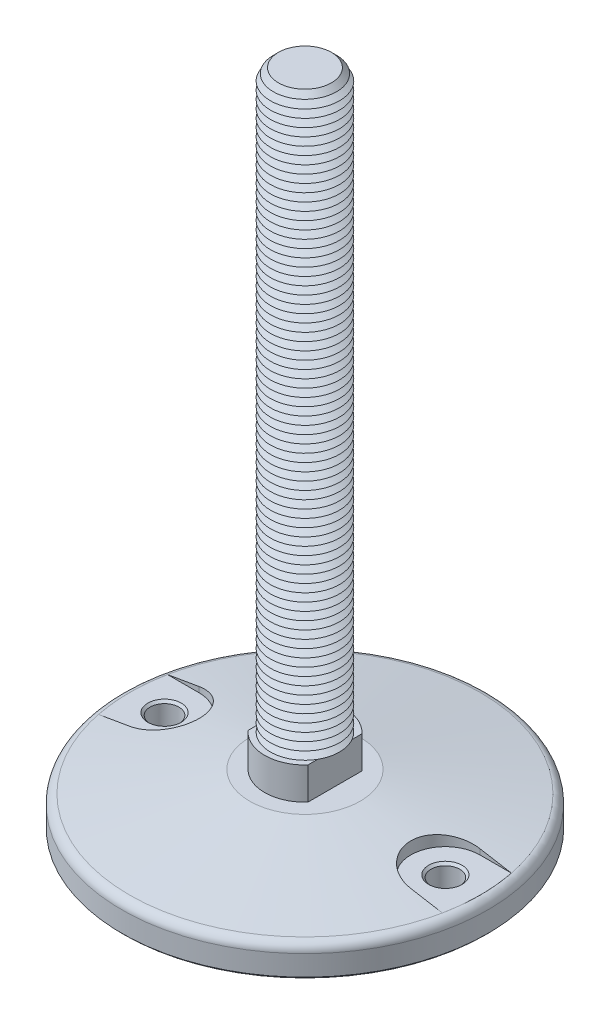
ISO-10303-21;
HEADER;
FILE_DESCRIPTION(('STEP AP214'),'2;1');
FILE_NAME('part.step','',(''),(''),'','','');
FILE_SCHEMA(('AUTOMOTIVE_DESIGN { 1 0 10303 214 1 1 1 1 }'));
ENDSEC;
DATA;
#1=APPLICATION_CONTEXT('core data for automotive mechanical design processes');
#2=APPLICATION_PROTOCOL_DEFINITION('international standard','automotive_design',2000,#1);
#3=PRODUCT_CONTEXT('',#1,'mechanical');
#4=PRODUCT('Part','Part','',(#3));
#5=PRODUCT_RELATED_PRODUCT_CATEGORY('part','',(#4));
#6=PRODUCT_DEFINITION_FORMATION('','',#4);
#7=PRODUCT_DEFINITION_CONTEXT('part definition',#1,'design');
#8=PRODUCT_DEFINITION('design','',#6,#7);
#9=PRODUCT_DEFINITION_SHAPE('','',#8);
#10=(LENGTH_UNIT() NAMED_UNIT(*) SI_UNIT(.MILLI.,.METRE.));
#11=(NAMED_UNIT(*) PLANE_ANGLE_UNIT() SI_UNIT($,.RADIAN.));
#12=(NAMED_UNIT(*) SI_UNIT($,.STERADIAN.) SOLID_ANGLE_UNIT());
#13=UNCERTAINTY_MEASURE_WITH_UNIT(LENGTH_MEASURE(1.E-05),#10,'distance_accuracy_value','');
#14=(GEOMETRIC_REPRESENTATION_CONTEXT(3) GLOBAL_UNCERTAINTY_ASSIGNED_CONTEXT((#13)) GLOBAL_UNIT_ASSIGNED_CONTEXT((#10,
#11,#12)) REPRESENTATION_CONTEXT('',''));
#15=CARTESIAN_POINT('',(0.,0.,0.));
#16=DIRECTION('',(0.,0.,1.));
#17=DIRECTION('',(1.,0.,0.));
#18=AXIS2_PLACEMENT_3D('',#15,#16,#17);
#19=CARTESIAN_POINT('',(0.,0.,0.));
#20=DIRECTION('',(0.,-1.,0.));
#21=DIRECTION('',(0.,0.,-1.));
#22=AXIS2_PLACEMENT_3D('',#19,#20,#21);
#23=CONICAL_SURFACE('',#22,24.,1.39626340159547);
#24=CARTESIAN_POINT('',(-61.0002,-6.84455305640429,14.9999999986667));
#25=CARTESIAN_POINT('',(-60.5719080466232,-6.77122530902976,15.0000486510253));
#26=CARTESIAN_POINT('',(-60.1437494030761,-6.69717888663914,14.981669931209));
#27=CARTESIAN_POINT('',(-59.2907529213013,-6.54813452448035,14.9084324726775));
#28=CARTESIAN_POINT('',(-58.865914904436,-6.47313663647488,14.8535757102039));
#29=CARTESIAN_POINT('',(-58.0227762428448,-6.32270449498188,14.7077930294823));
#30=CARTESIAN_POINT('',(-57.6044724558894,-6.24727047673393,14.6168850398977));
#31=CARTESIAN_POINT('',(-56.7771541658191,-6.09645264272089,14.3996686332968));
#32=CARTESIAN_POINT('',(-56.3681395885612,-6.02106882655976,14.2733604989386));
#33=CARTESIAN_POINT('',(-55.5621199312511,-5.87087312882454,13.986156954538));
#34=CARTESIAN_POINT('',(-55.1651202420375,-5.79606151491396,13.8252462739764));
#35=CARTESIAN_POINT('',(-54.3861487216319,-5.64763733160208,13.4699748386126));
#36=CARTESIAN_POINT('',(-54.0041768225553,-5.57402475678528,13.2756142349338));
#37=CARTESIAN_POINT('',(-53.2580678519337,-5.42864124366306,12.8548003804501));
#38=CARTESIAN_POINT('',(-52.8939274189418,-5.35686995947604,12.6283532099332));
#39=CARTESIAN_POINT('',(-52.186041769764,-5.21581901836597,12.1448693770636));
#40=CARTESIAN_POINT('',(-51.8422964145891,-5.14653934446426,11.8878329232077));
#41=CARTESIAN_POINT('',(-51.1785561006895,-5.01133737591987,11.3455904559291));
#42=CARTESIAN_POINT('',(-50.8585036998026,-4.94540709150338,11.0604567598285));
#43=CARTESIAN_POINT('',(-50.2435776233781,-4.81743482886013,10.463413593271));
#44=CARTESIAN_POINT('',(-49.948704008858,-4.75539286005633,10.1515040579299));
#45=CARTESIAN_POINT('',(-49.3863482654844,-4.6359259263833,9.5030156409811));
#46=CARTESIAN_POINT('',(-49.1188689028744,-4.57850142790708,9.16643427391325));
#47=CARTESIAN_POINT('',(-48.6134211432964,-4.46901587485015,8.47097635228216));
#48=CARTESIAN_POINT('',(-48.3754523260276,-4.41695474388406,8.11210011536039));
#49=CARTESIAN_POINT('',(-47.9343068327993,-4.31966643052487,7.38020662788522));
#50=CARTESIAN_POINT('',(-47.7306564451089,-4.27434742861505,7.00748710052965));
#51=CARTESIAN_POINT('',(-47.3554457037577,-4.19027418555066,6.24551642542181));
#52=CARTESIAN_POINT('',(-47.1838850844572,-4.15151989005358,5.85626541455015));
#53=CARTESIAN_POINT('',(-46.8742907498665,-4.08118572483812,5.06410373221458));
#54=CARTESIAN_POINT('',(-46.7362508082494,-4.04960452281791,4.66119561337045));
#55=CARTESIAN_POINT('',(-46.4948208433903,-3.99412823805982,3.84461191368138));
#56=CARTESIAN_POINT('',(-46.3914302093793,-3.97023301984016,3.43093652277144));
#57=CARTESIAN_POINT('',(-46.2221429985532,-3.93099396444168,2.60545435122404));
#58=CARTESIAN_POINT('',(-46.1554440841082,-3.91546729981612,2.19382064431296));
#59=CARTESIAN_POINT('',(-46.0565351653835,-3.8924103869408,1.36621022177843));
#60=CARTESIAN_POINT('',(-46.0243246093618,-3.88488001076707,0.950233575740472));
#61=CARTESIAN_POINT('',(-45.9946646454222,-3.87794669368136,0.117003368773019));
#62=CARTESIAN_POINT('',(-45.9972129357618,-3.87854321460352,-0.300250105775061));
#63=CARTESIAN_POINT('',(-46.0370435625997,-3.88785198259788,-1.13300367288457));
#64=CARTESIAN_POINT('',(-46.0743257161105,-3.89656418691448,-1.54850377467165));
#65=CARTESIAN_POINT('',(-46.182543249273,-3.92177454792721,-2.36891759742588));
#66=CARTESIAN_POINT('',(-46.2529993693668,-3.93816180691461,-2.77389806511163));
#67=CARTESIAN_POINT('',(-46.4267978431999,-3.97840764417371,-3.57635456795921));
#68=CARTESIAN_POINT('',(-46.5301398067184,-4.00226613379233,-3.97383069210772));
#69=CARTESIAN_POINT('',(-46.7688882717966,-4.05707448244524,-4.75853501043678));
#70=CARTESIAN_POINT('',(-46.9042953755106,-4.08802447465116,-5.14576301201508));
#71=CARTESIAN_POINT('',(-47.206117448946,-4.15654424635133,-5.90733280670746));
#72=CARTESIAN_POINT('',(-47.3725327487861,-4.19411409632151,-6.28167446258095));
#73=CARTESIAN_POINT('',(-47.7365717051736,-4.27566086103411,-7.01794010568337));
#74=CARTESIAN_POINT('',(-47.9344367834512,-4.31968711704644,-7.37973923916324));
#75=CARTESIAN_POINT('',(-48.3589021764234,-4.41331257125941,-8.08530451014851));
#76=CARTESIAN_POINT('',(-48.5855025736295,-4.46291178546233,-8.42907059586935));
#77=CARTESIAN_POINT('',(-49.0657858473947,-4.56705084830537,-9.09634650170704));
#78=CARTESIAN_POINT('',(-49.3194694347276,-4.62159082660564,-9.41985578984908));
#79=CARTESIAN_POINT('',(-49.8521052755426,-4.73496487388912,-10.0445475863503));
#80=CARTESIAN_POINT('',(-50.131057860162,-4.79379899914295,-10.3457298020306));
#81=CARTESIAN_POINT('',(-50.7186282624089,-4.91644106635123,-10.9301791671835));
#82=CARTESIAN_POINT('',(-51.0277601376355,-4.98032946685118,-11.2129127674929));
#83=CARTESIAN_POINT('',(-51.6681809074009,-5.11124627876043,-11.7512616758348));
#84=CARTESIAN_POINT('',(-51.9994702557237,-5.17827475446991,-12.0068764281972));
#85=CARTESIAN_POINT('',(-52.6820261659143,-5.31484958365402,-12.489438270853));
#86=CARTESIAN_POINT('',(-53.0333008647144,-5.38439695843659,-12.7163735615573));
#87=CARTESIAN_POINT('',(-53.7532696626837,-5.52535961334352,-13.1399905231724));
#88=CARTESIAN_POINT('',(-54.1219634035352,-5.59677485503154,-13.3366728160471));
#89=CARTESIAN_POINT('',(-54.8815627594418,-5.74228287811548,-13.7020352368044));
#90=CARTESIAN_POINT('',(-55.2727604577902,-5.81640072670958,-13.8700983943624));
#91=CARTESIAN_POINT('',(-56.0678984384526,-5.9653752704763,-14.1723417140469));
#92=CARTESIAN_POINT('',(-56.4718387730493,-6.04023196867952,-14.3065217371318));
#93=CARTESIAN_POINT('',(-57.2891056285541,-6.19003340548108,-14.5399332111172));
#94=CARTESIAN_POINT('',(-57.7024198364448,-6.26497791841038,-14.6392079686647));
#95=CARTESIAN_POINT('',(-58.5358762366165,-6.4145012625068,-14.8023063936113));
#96=CARTESIAN_POINT('',(-58.9560150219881,-6.48908025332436,-14.8661472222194));
#97=CARTESIAN_POINT('',(-59.6475646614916,-6.61057728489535,-14.9413662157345));
#98=CARTESIAN_POINT('',(-59.9178207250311,-6.65774602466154,-14.9633673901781));
#99=CARTESIAN_POINT('',(-60.458759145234,-6.75155340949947,-14.9926755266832));
#100=CARTESIAN_POINT('',(-60.7294400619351,-6.79819280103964,-15.000006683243));
#101=CARTESIAN_POINT('',(-61.0002,-6.84455305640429,-14.9999999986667));
#102=B_SPLINE_CURVE_WITH_KNOTS('',3,(#24,#25,#26,#27,#28,#29,#30,#31,#32,#33,#34,#35,#36,#37,
#38,#39,#40,#41,#42,#43,#44,#45,#46,#47,#48,#49,#50,#51,#52,#53,#54,#55,#56,#57,#58,#59,#60,#61,
#62,#63,#64,#65,#66,#67,#68,#69,#70,#71,#72,#73,#74,#75,#76,#77,#78,#79,#80,#81,#82,#83,#84,#85,
#86,#87,#88,#89,#90,#91,#92,#93,#94,#95,#96,#97,#98,#99,#100,#101),.UNSPECIFIED.,.F.,.F.,(4,2,2,
2,2,2,2,2,2,2,2,2,2,2,2,2,2,2,2,2,2,2,2,2,2,2,2,2,2,2,2,2,2,2,2,2,2,2,4),(0.,1.30316757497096,
2.6062645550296,3.9087143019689,5.21115364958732,6.51416896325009,7.81717839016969,
9.11994123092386,10.4226951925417,11.722179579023,13.0216671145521,14.3212857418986,
15.620885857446,16.9007390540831,18.1805816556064,19.4601863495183,20.7397684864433,
21.9901285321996,23.2404685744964,24.4907258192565,25.7409764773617,26.9736945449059,
28.2063979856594,29.4391245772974,30.6718642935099,31.9145698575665,33.1572789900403,
34.4000207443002,35.6427787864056,36.912623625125,38.1824944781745,39.4528861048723,
40.7232516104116,42.0182516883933,43.3132570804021,44.6066500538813,45.8994160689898,
46.7247199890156,47.5486616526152),.UNSPECIFIED.);
#103=CARTESIAN_POINT('',(-61.,-6.84451881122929,15.));
#104=VERTEX_POINT('',#103);
#105=CARTESIAN_POINT('',(-61.,-6.84451881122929,-15.));
#106=VERTEX_POINT('',#105);
#107=EDGE_CURVE('E847',#104,#106,#102,.T.);
#108=ORIENTED_EDGE('',*,*,#107,.F.);
#109=CARTESIAN_POINT('',(-104.042185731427,-14.3032773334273,15.));
#110=CARTESIAN_POINT('',(-101.426826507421,-13.8468501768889,15.));
#111=CARTESIAN_POINT('',(-98.8114117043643,-13.3907410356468,15.));
#112=CARTESIAN_POINT('',(-93.5804323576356,-12.4793845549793,15.));
#113=CARTESIAN_POINT('',(-90.964867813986,-12.0241372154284,15.));
#114=CARTESIAN_POINT('',(-85.7335581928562,-11.1147314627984,15.));
#115=CARTESIAN_POINT('',(-83.1178131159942,-10.6605730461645,15.));
#116=CARTESIAN_POINT('',(-77.8860747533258,-9.75368383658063,15.));
#117=CARTESIAN_POINT('',(-75.2700814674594,-9.30095304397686,15.));
#118=CARTESIAN_POINT('',(-70.0377535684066,-8.39740791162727,15.));
#119=CARTESIAN_POINT('',(-67.4214189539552,-7.94659357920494,15.));
#120=CARTESIAN_POINT('',(-62.1882957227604,-7.04761438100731,15.));
#121=CARTESIAN_POINT('',(-59.5715071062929,-6.59944951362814,15.));
#122=CARTESIAN_POINT('',(-55.6458288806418,-5.93007736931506,15.));
#123=CARTESIAN_POINT('',(-54.3371844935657,-5.70743210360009,15.));
#124=CARTESIAN_POINT('',(-51.7196954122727,-5.26332337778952,15.));
#125=CARTESIAN_POINT('',(-50.4108507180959,-5.04185991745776,15.));
#126=CARTESIAN_POINT('',(-47.7929137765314,-4.60038366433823,15.));
#127=CARTESIAN_POINT('',(-46.4838215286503,-4.38037087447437,15.));
#128=CARTESIAN_POINT('',(-43.8653264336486,-3.94219643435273,15.));
#129=CARTESIAN_POINT('',(-42.5559235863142,-3.72403478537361,15.));
#130=CARTESIAN_POINT('',(-41.2463335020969,-3.50699886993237,15.));
#131=B_SPLINE_CURVE_WITH_KNOTS('',3,(#109,#110,#111,#112,#113,#114,#115,#116,#117,#118,#119,
#120,#121,#122,#123,#124,#125,#126,#127,#128,#129,#130),.UNSPECIFIED.,.F.,.F.,(4,2,2,2,2,2,2,2,
2,2,4),(0.,7.96466371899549,15.9293262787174,23.8939628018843,31.8586012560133,39.8232701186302,
47.7879341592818,51.7702809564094,55.7526269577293,59.734980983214,63.7173377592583),.UNSPECIFIED.);
#132=CARTESIAN_POINT('',(-74.6843450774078,-9.2,15.));
#133=VERTEX_POINT('',#132);
#134=EDGE_CURVE('E821',#133,#104,#131,.T.);
#135=ORIENTED_EDGE('',*,*,#134,.F.);
#136=CARTESIAN_POINT('',(0.,-9.2,0.));
#137=DIRECTION('',(0.,1.,0.));
#138=DIRECTION('',(0.,0.,1.));
#139=AXIS2_PLACEMENT_3D('',#136,#137,#138);
#140=CIRCLE('',#139,76.175792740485);
#141=CARTESIAN_POINT('',(-74.6843450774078,-9.2,-15.));
#142=VERTEX_POINT('',#141);
#143=EDGE_CURVE('E805',#133,#142,#140,.F.);
#144=ORIENTED_EDGE('',*,*,#143,.T.);
#145=CARTESIAN_POINT('',(-41.2463335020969,-3.50699886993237,-15.));
#146=CARTESIAN_POINT('',(-42.5559235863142,-3.72403478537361,-15.));
#147=CARTESIAN_POINT('',(-43.8653264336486,-3.94219643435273,-15.));
#148=CARTESIAN_POINT('',(-46.4838215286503,-4.38037087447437,-15.));
#149=CARTESIAN_POINT('',(-47.7929137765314,-4.60038366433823,-15.));
#150=CARTESIAN_POINT('',(-50.4108507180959,-5.04185991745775,-15.));
#151=CARTESIAN_POINT('',(-51.7196954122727,-5.26332337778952,-15.));
#152=CARTESIAN_POINT('',(-54.3371844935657,-5.70743210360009,-15.));
#153=CARTESIAN_POINT('',(-55.6458288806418,-5.93007736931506,-15.));
#154=CARTESIAN_POINT('',(-59.5715071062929,-6.59944951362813,-15.));
#155=CARTESIAN_POINT('',(-62.1882957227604,-7.04761438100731,-15.));
#156=CARTESIAN_POINT('',(-67.4214189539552,-7.94659357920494,-15.));
#157=CARTESIAN_POINT('',(-70.0377535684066,-8.39740791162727,-15.));
#158=CARTESIAN_POINT('',(-75.2700814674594,-9.30095304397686,-15.));
#159=CARTESIAN_POINT('',(-77.8860747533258,-9.75368383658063,-15.));
#160=CARTESIAN_POINT('',(-83.1178131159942,-10.6605730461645,-15.));
#161=CARTESIAN_POINT('',(-85.7335581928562,-11.1147314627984,-15.));
#162=CARTESIAN_POINT('',(-90.964867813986,-12.0241372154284,-15.));
#163=CARTESIAN_POINT('',(-93.5804323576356,-12.4793845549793,-15.));
#164=CARTESIAN_POINT('',(-98.8114117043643,-13.3907410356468,-15.));
#165=CARTESIAN_POINT('',(-101.426826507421,-13.8468501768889,-15.));
#166=CARTESIAN_POINT('',(-104.042185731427,-14.3032773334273,-15.));
#167=B_SPLINE_CURVE_WITH_KNOTS('',3,(#145,#146,#147,#148,#149,#150,#151,#152,#153,#154,#155,
#156,#157,#158,#159,#160,#161,#162,#163,#164,#165,#166),.UNSPECIFIED.,.F.,.F.,(4,2,2,2,2,2,2,2,
2,2,4),(0.,3.98235677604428,7.96471080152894,11.9470568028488,15.9294035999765,23.8940676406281,
31.8587365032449,39.8233749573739,47.7880114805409,55.7526740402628,63.7173377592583),.UNSPECIFIED.);
#168=EDGE_CURVE('E813',#106,#142,#167,.T.);
#169=ORIENTED_EDGE('',*,*,#168,.F.);
#170=EDGE_LOOP('',(#108,#135,#144,#169));
#171=FACE_BOUND('',#170,.T.);
#172=CARTESIAN_POINT('',(0.,-9.20331494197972,0.));
#173=DIRECTION('',(0.,1.,0.));
#174=DIRECTION('',(0.,0.,1.));
#175=AXIS2_PLACEMENT_3D('',#172,#173,#174);
#176=CIRCLE('',#175,76.1945927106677);
#177=CARTESIAN_POINT('',(0.,-9.20331494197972,76.1945927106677));
#178=VERTEX_POINT('',#177);
#179=EDGE_CURVE('E794',#178,#178,#176,.T.);
#180=ORIENTED_EDGE('',*,*,#179,.T.);
#181=EDGE_LOOP('',(#180));
#182=FACE_BOUND('',#181,.T.);
#183=CARTESIAN_POINT('',(0.,0.,0.));
#184=DIRECTION('',(0.,1.,0.));
#185=DIRECTION('',(0.,0.,1.));
#186=AXIS2_PLACEMENT_3D('',#183,#184,#185);
#187=CIRCLE('',#186,24.);
#188=CARTESIAN_POINT('',(0.,0.,24.));
#189=VERTEX_POINT('',#188);
#190=EDGE_CURVE('E790',#189,#189,#187,.T.);
#191=ORIENTED_EDGE('',*,*,#190,.F.);
#192=EDGE_LOOP('',(#191));
#193=FACE_BOUND('',#192,.T.);
#194=CARTESIAN_POINT('',(94.0652754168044,-12.563957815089,15.));
#195=CARTESIAN_POINT('',(91.449731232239,-12.1085412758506,15.));
#196=CARTESIAN_POINT('',(88.8341137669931,-11.653544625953,15.));
#197=CARTESIAN_POINT('',(83.6026721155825,-10.7447399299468,15.));
#198=CARTESIAN_POINT('',(80.9868479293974,-10.2909318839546,15.));
#199=CARTESIAN_POINT('',(75.7549567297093,-9.38485738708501,15.));
#200=CARTESIAN_POINT('',(73.1388897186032,-8.93259092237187,15.));
#201=CARTESIAN_POINT('',(67.9063931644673,-8.03014521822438,15.));
#202=CARTESIAN_POINT('',(65.2899636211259,-7.57996598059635,15.));
#203=CARTESIAN_POINT('',(60.0565735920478,-6.68252310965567,15.));
#204=CARTESIAN_POINT('',(57.4396131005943,-6.2352595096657,15.));
#205=CARTESIAN_POINT('',(52.2049769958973,-5.34496105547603,15.));
#206=CARTESIAN_POINT('',(49.5873013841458,-4.90192619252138,15.));
#207=CARTESIAN_POINT('',(45.659951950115,-4.24226428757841,15.));
#208=CARTESIAN_POINT('',(44.3506891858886,-4.02319090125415,15.));
#209=CARTESIAN_POINT('',(41.7318168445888,-3.58713211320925,15.));
#210=CARTESIAN_POINT('',(40.4222072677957,-3.3701467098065,15.));
#211=CARTESIAN_POINT('',(37.8025367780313,-2.93885600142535,15.));
#212=CARTESIAN_POINT('',(36.4924758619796,-2.72455071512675,15.));
#213=CARTESIAN_POINT('',(34.5269525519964,-2.40574421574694,15.));
#214=CARTESIAN_POINT('',(33.8717052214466,-2.29991714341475,15.));
#215=CARTESIAN_POINT('',(32.5610443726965,-2.08929455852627,15.));
#216=CARTESIAN_POINT('',(31.9056308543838,-1.98449904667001,15.));
#217=CARTESIAN_POINT('',(31.2501232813,-1.88029321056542,15.));
#218=B_SPLINE_CURVE_WITH_KNOTS('',3,(#194,#195,#196,#197,#198,#199,#200,#201,#202,#203,#204,
#205,#206,#207,#208,#209,#210,#211,#212,#213,#214,#215,#216,#217),.UNSPECIFIED.,.F.,.F.,(4,2,2,
2,2,2,2,2,2,2,2,4),(0.,7.96468982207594,15.9293804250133,23.8939993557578,31.8586251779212,
39.82334186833,47.7880420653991,51.7704344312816,55.7528235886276,59.7352404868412,
61.7264544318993,63.7176697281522),.UNSPECIFIED.);
#219=CARTESIAN_POINT('',(74.6843450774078,-9.2,15.));
#220=VERTEX_POINT('',#219);
#221=CARTESIAN_POINT('',(61.,-6.84451881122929,15.));
#222=VERTEX_POINT('',#221);
#223=EDGE_CURVE('E133',#220,#222,#218,.T.);
#224=ORIENTED_EDGE('',*,*,#223,.T.);
#225=CARTESIAN_POINT('',(61.0002,-6.84455305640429,14.9999999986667));
#226=CARTESIAN_POINT('',(60.5719080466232,-6.77122530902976,15.0000486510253));
#227=CARTESIAN_POINT('',(60.1437494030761,-6.69717888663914,14.981669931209));
#228=CARTESIAN_POINT('',(59.2907529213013,-6.54813452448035,14.9084324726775));
#229=CARTESIAN_POINT('',(58.865914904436,-6.47313663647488,14.8535757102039));
#230=CARTESIAN_POINT('',(58.0227762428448,-6.32270449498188,14.7077930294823));
#231=CARTESIAN_POINT('',(57.6044724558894,-6.24727047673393,14.6168850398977));
#232=CARTESIAN_POINT('',(56.7771541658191,-6.09645264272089,14.3996686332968));
#233=CARTESIAN_POINT('',(56.3681395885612,-6.02106882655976,14.2733604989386));
#234=CARTESIAN_POINT('',(55.5621199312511,-5.87087312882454,13.986156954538));
#235=CARTESIAN_POINT('',(55.1651202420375,-5.79606151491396,13.8252462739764));
#236=CARTESIAN_POINT('',(54.3861487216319,-5.64763733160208,13.4699748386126));
#237=CARTESIAN_POINT('',(54.0041768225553,-5.57402475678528,13.2756142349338));
#238=CARTESIAN_POINT('',(53.2580678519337,-5.42864124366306,12.8548003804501));
#239=CARTESIAN_POINT('',(52.8939274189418,-5.35686995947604,12.6283532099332));
#240=CARTESIAN_POINT('',(52.186041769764,-5.21581901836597,12.1448693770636));
#241=CARTESIAN_POINT('',(51.8422964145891,-5.14653934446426,11.8878329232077));
#242=CARTESIAN_POINT('',(51.1785561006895,-5.01133737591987,11.3455904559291));
#243=CARTESIAN_POINT('',(50.8585036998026,-4.94540709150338,11.0604567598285));
#244=CARTESIAN_POINT('',(50.2435776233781,-4.81743482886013,10.463413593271));
#245=CARTESIAN_POINT('',(49.948704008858,-4.75539286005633,10.1515040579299));
#246=CARTESIAN_POINT('',(49.3863482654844,-4.6359259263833,9.5030156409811));
#247=CARTESIAN_POINT('',(49.1188689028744,-4.57850142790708,9.16643427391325));
#248=CARTESIAN_POINT('',(48.6134211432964,-4.46901587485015,8.47097635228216));
#249=CARTESIAN_POINT('',(48.3754523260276,-4.41695474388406,8.11210011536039));
#250=CARTESIAN_POINT('',(47.9343068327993,-4.31966643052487,7.38020662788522));
#251=CARTESIAN_POINT('',(47.7306564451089,-4.27434742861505,7.00748710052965));
#252=CARTESIAN_POINT('',(47.3554457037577,-4.19027418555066,6.24551642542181));
#253=CARTESIAN_POINT('',(47.1838850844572,-4.15151989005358,5.85626541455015));
#254=CARTESIAN_POINT('',(46.8742907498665,-4.08118572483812,5.06410373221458));
#255=CARTESIAN_POINT('',(46.7362508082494,-4.04960452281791,4.66119561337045));
#256=CARTESIAN_POINT('',(46.4948208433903,-3.99412823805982,3.84461191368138));
#257=CARTESIAN_POINT('',(46.3914302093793,-3.97023301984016,3.43093652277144));
#258=CARTESIAN_POINT('',(46.2221429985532,-3.93099396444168,2.60545435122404));
#259=CARTESIAN_POINT('',(46.1554440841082,-3.91546729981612,2.19382064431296));
#260=CARTESIAN_POINT('',(46.0565351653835,-3.8924103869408,1.36621022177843));
#261=CARTESIAN_POINT('',(46.0243246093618,-3.88488001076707,0.950233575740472));
#262=CARTESIAN_POINT('',(45.9946646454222,-3.87794669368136,0.117003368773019));
#263=CARTESIAN_POINT('',(45.9972129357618,-3.87854321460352,-0.300250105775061));
#264=CARTESIAN_POINT('',(46.0370435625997,-3.88785198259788,-1.13300367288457));
#265=CARTESIAN_POINT('',(46.0743257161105,-3.89656418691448,-1.54850377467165));
#266=CARTESIAN_POINT('',(46.182543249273,-3.92177454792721,-2.36891759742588));
#267=CARTESIAN_POINT('',(46.2529993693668,-3.93816180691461,-2.77389806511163));
#268=CARTESIAN_POINT('',(46.4267978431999,-3.97840764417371,-3.57635456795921));
#269=CARTESIAN_POINT('',(46.5301398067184,-4.00226613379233,-3.97383069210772));
#270=CARTESIAN_POINT('',(46.7688882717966,-4.05707448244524,-4.75853501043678));
#271=CARTESIAN_POINT('',(46.9042953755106,-4.08802447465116,-5.14576301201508));
#272=CARTESIAN_POINT('',(47.206117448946,-4.15654424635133,-5.90733280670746));
#273=CARTESIAN_POINT('',(47.3725327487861,-4.19411409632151,-6.28167446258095));
#274=CARTESIAN_POINT('',(47.7365717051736,-4.27566086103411,-7.01794010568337));
#275=CARTESIAN_POINT('',(47.9344367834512,-4.31968711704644,-7.37973923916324));
#276=CARTESIAN_POINT('',(48.3589021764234,-4.41331257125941,-8.08530451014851));
#277=CARTESIAN_POINT('',(48.5855025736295,-4.46291178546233,-8.42907059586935));
#278=CARTESIAN_POINT('',(49.0657858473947,-4.56705084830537,-9.09634650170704));
#279=CARTESIAN_POINT('',(49.3194694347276,-4.62159082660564,-9.41985578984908));
#280=CARTESIAN_POINT('',(49.8521052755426,-4.73496487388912,-10.0445475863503));
#281=CARTESIAN_POINT('',(50.131057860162,-4.79379899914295,-10.3457298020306));
#282=CARTESIAN_POINT('',(50.7186282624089,-4.91644106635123,-10.9301791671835));
#283=CARTESIAN_POINT('',(51.0277601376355,-4.98032946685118,-11.2129127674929));
#284=CARTESIAN_POINT('',(51.6681809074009,-5.11124627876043,-11.7512616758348));
#285=CARTESIAN_POINT('',(51.9994702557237,-5.17827475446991,-12.0068764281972));
#286=CARTESIAN_POINT('',(52.6820261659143,-5.31484958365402,-12.489438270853));
#287=CARTESIAN_POINT('',(53.0333008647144,-5.38439695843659,-12.7163735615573));
#288=CARTESIAN_POINT('',(53.7532696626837,-5.52535961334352,-13.1399905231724));
#289=CARTESIAN_POINT('',(54.1219634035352,-5.59677485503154,-13.3366728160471));
#290=CARTESIAN_POINT('',(54.8815627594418,-5.74228287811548,-13.7020352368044));
#291=CARTESIAN_POINT('',(55.2727604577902,-5.81640072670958,-13.8700983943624));
#292=CARTESIAN_POINT('',(56.0678984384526,-5.9653752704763,-14.1723417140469));
#293=CARTESIAN_POINT('',(56.4718387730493,-6.04023196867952,-14.3065217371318));
#294=CARTESIAN_POINT('',(57.2891056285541,-6.19003340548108,-14.5399332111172));
#295=CARTESIAN_POINT('',(57.7024198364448,-6.26497791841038,-14.6392079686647));
#296=CARTESIAN_POINT('',(58.5358762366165,-6.4145012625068,-14.8023063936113));
#297=CARTESIAN_POINT('',(58.9560150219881,-6.48908025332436,-14.8661472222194));
#298=CARTESIAN_POINT('',(59.6475646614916,-6.61057728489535,-14.9413662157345));
#299=CARTESIAN_POINT('',(59.9178207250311,-6.65774602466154,-14.9633673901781));
#300=CARTESIAN_POINT('',(60.458759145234,-6.75155340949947,-14.9926755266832));
#301=CARTESIAN_POINT('',(60.7294400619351,-6.79819280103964,-15.000006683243));
#302=CARTESIAN_POINT('',(61.0002,-6.84455305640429,-14.9999999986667));
#303=B_SPLINE_CURVE_WITH_KNOTS('',3,(#225,#226,#227,#228,#229,#230,#231,#232,#233,#234,#235,
#236,#237,#238,#239,#240,#241,#242,#243,#244,#245,#246,#247,#248,#249,#250,#251,#252,#253,#254,
#255,#256,#257,#258,#259,#260,#261,#262,#263,#264,#265,#266,#267,#268,#269,#270,#271,#272,#273,
#274,#275,#276,#277,#278,#279,#280,#281,#282,#283,#284,#285,#286,#287,#288,#289,#290,#291,#292,
#293,#294,#295,#296,#297,#298,#299,#300,#301,#302),.UNSPECIFIED.,.F.,.F.,(4,2,2,2,2,2,2,2,2,2,2,
2,2,2,2,2,2,2,2,2,2,2,2,2,2,2,2,2,2,2,2,2,2,2,2,2,2,2,4),(0.,1.30316757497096,2.6062645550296,
3.9087143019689,5.21115364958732,6.51416896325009,7.81717839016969,9.11994123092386,
10.4226951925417,11.722179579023,13.0216671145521,14.3212857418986,15.620885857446,
16.9007390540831,18.1805816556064,19.4601863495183,20.7397684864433,21.9901285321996,
23.2404685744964,24.4907258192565,25.7409764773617,26.9736945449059,28.2063979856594,
29.4391245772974,30.6718642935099,31.9145698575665,33.1572789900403,34.4000207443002,
35.6427787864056,36.912623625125,38.1824944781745,39.4528861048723,40.7232516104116,
42.0182516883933,43.3132570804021,44.6066500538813,45.8994160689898,46.7247199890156,
47.5486616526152),.UNSPECIFIED.);
#304=CARTESIAN_POINT('',(61.,-6.84451881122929,-15.));
#305=VERTEX_POINT('',#304);
#306=EDGE_CURVE('E145',#222,#305,#303,.T.);
#307=ORIENTED_EDGE('',*,*,#306,.T.);
#308=CARTESIAN_POINT('',(31.2501232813,-1.88029321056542,-15.));
#309=CARTESIAN_POINT('',(31.9056308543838,-1.98449904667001,-15.));
#310=CARTESIAN_POINT('',(32.5610443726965,-2.08929455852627,-15.));
#311=CARTESIAN_POINT('',(33.8717052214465,-2.29991714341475,-15.));
#312=CARTESIAN_POINT('',(34.5269525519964,-2.40574421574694,-15.));
#313=CARTESIAN_POINT('',(36.4924758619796,-2.72455071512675,-15.));
#314=CARTESIAN_POINT('',(37.8025367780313,-2.93885600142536,-15.));
#315=CARTESIAN_POINT('',(40.4222072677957,-3.3701467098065,-15.));
#316=CARTESIAN_POINT('',(41.7318168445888,-3.58713211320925,-15.));
#317=CARTESIAN_POINT('',(44.3506891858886,-4.02319090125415,-15.));
#318=CARTESIAN_POINT('',(45.659951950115,-4.24226428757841,-15.));
#319=CARTESIAN_POINT('',(49.5873013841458,-4.90192619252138,-15.));
#320=CARTESIAN_POINT('',(52.2049769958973,-5.34496105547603,-15.));
#321=CARTESIAN_POINT('',(57.4396131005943,-6.2352595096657,-15.));
#322=CARTESIAN_POINT('',(60.0565735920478,-6.68252310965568,-15.));
#323=CARTESIAN_POINT('',(65.2899636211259,-7.57996598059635,-15.));
#324=CARTESIAN_POINT('',(67.9063931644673,-8.03014521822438,-15.));
#325=CARTESIAN_POINT('',(73.1388897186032,-8.93259092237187,-15.));
#326=CARTESIAN_POINT('',(75.7549567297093,-9.38485738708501,-15.));
#327=CARTESIAN_POINT('',(80.9868479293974,-10.2909318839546,-15.));
#328=CARTESIAN_POINT('',(83.6026721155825,-10.7447399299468,-15.));
#329=CARTESIAN_POINT('',(88.8341137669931,-11.653544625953,-15.));
#330=CARTESIAN_POINT('',(91.449731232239,-12.1085412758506,-15.));
#331=CARTESIAN_POINT('',(94.0652754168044,-12.563957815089,-15.));
#332=B_SPLINE_CURVE_WITH_KNOTS('',3,(#308,#309,#310,#311,#312,#313,#314,#315,#316,#317,#318,
#319,#320,#321,#322,#323,#324,#325,#326,#327,#328,#329,#330,#331),.UNSPECIFIED.,.F.,.F.,(4,2,2,
2,2,2,2,2,2,2,2,4),(0.,1.99121529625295,3.98242924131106,7.96484613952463,11.9472352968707,
15.9296276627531,23.8943278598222,31.859044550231,39.8236703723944,47.7882893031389,
55.7529799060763,63.7176697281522),.UNSPECIFIED.);
#333=CARTESIAN_POINT('',(74.6843450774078,-9.2,-15.));
#334=VERTEX_POINT('',#333);
#335=EDGE_CURVE('E877',#305,#334,#332,.T.);
#336=ORIENTED_EDGE('',*,*,#335,.T.);
#337=CARTESIAN_POINT('',(0.,-9.2,0.));
#338=DIRECTION('',(0.,1.,0.));
#339=DIRECTION('',(0.,0.,1.));
#340=AXIS2_PLACEMENT_3D('',#337,#338,#339);
#341=CIRCLE('',#340,76.175792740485);
#342=EDGE_CURVE('E868',#334,#220,#341,.F.);
#343=ORIENTED_EDGE('',*,*,#342,.T.);
#344=EDGE_LOOP('',(#224,#307,#336,#343));
#345=FACE_BOUND('',#344,.T.);
#346=ADVANCED_FACE('F39',(#171,#182,#193,#345),#23,.T.);
#347=CARTESIAN_POINT('',(0.,14.,0.));
#348=DIRECTION('',(0.,1.,0.));
#349=DIRECTION('',(0.,0.,1.));
#350=AXIS2_PLACEMENT_3D('',#347,#348,#349);
#351=PLANE('',#350);
#352=CARTESIAN_POINT('',(0.,14.,0.));
#353=DIRECTION('',(0.,1.,0.));
#354=DIRECTION('',(0.,0.,1.));
#355=AXIS2_PLACEMENT_3D('',#352,#353,#354);
#356=CIRCLE('',#355,15.);
#357=CARTESIAN_POINT('',(13.,14.,-7.48331477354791));
#358=VERTEX_POINT('',#357);
#359=CARTESIAN_POINT('',(-13.,14.,-7.48331477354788));
#360=VERTEX_POINT('',#359);
#361=EDGE_CURVE('E806',#358,#360,#356,.T.);
#362=ORIENTED_EDGE('',*,*,#361,.F.);
#363=DIRECTION('',(0.,0.,1.));
#364=VECTOR('',#363,1.);
#365=CARTESIAN_POINT('',(13.,14.,11.71537451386));
#366=LINE('',#365,#364);
#367=CARTESIAN_POINT('',(13.,14.,-11.71537451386));
#368=VERTEX_POINT('',#367);
#369=EDGE_CURVE('E769',#368,#358,#366,.T.);
#370=ORIENTED_EDGE('',*,*,#369,.F.);
#371=CARTESIAN_POINT('',(0.,14.,0.));
#372=DIRECTION('',(0.,1.,0.));
#373=DIRECTION('',(0.,0.,1.));
#374=AXIS2_PLACEMENT_3D('',#371,#372,#373);
#375=CIRCLE('',#374,17.5);
#376=CARTESIAN_POINT('',(-13.,14.,-11.71537451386));
#377=VERTEX_POINT('',#376);
#378=EDGE_CURVE('E783',#368,#377,#375,.T.);
#379=ORIENTED_EDGE('',*,*,#378,.T.);
#380=DIRECTION('',(0.,0.,-1.));
#381=VECTOR('',#380,1.);
#382=CARTESIAN_POINT('',(-13.,14.,-11.71537451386));
#383=LINE('',#382,#381);
#384=EDGE_CURVE('E756',#360,#377,#383,.T.);
#385=ORIENTED_EDGE('',*,*,#384,.F.);
#386=EDGE_LOOP('',(#362,#370,#379,#385));
#387=FACE_BOUND('',#386,.T.);
#388=ADVANCED_FACE('F931',(#387),#351,.T.);
#389=CARTESIAN_POINT('',(0.,14.,0.));
#390=DIRECTION('',(0.,-1.,0.));
#391=DIRECTION('',(0.,0.,-1.));
#392=AXIS2_PLACEMENT_3D('',#389,#390,#391);
#393=CYLINDRICAL_SURFACE('',#392,17.5);
#394=CARTESIAN_POINT('',(-13.,14.,11.71537451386));
#395=VERTEX_POINT('',#394);
#396=CARTESIAN_POINT('',(13.,14.,11.71537451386));
#397=VERTEX_POINT('',#396);
#398=EDGE_CURVE('E761',#395,#397,#375,.T.);
#399=ORIENTED_EDGE('',*,*,#398,.F.);
#400=DIRECTION('',(0.,1.,0.));
#401=VECTOR('',#400,1.);
#402=CARTESIAN_POINT('',(-13.,0.,11.71537451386));
#403=LINE('',#402,#401);
#404=CARTESIAN_POINT('',(-13.,0.,11.71537451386));
#405=VERTEX_POINT('',#404);
#406=EDGE_CURVE('E751',#405,#395,#403,.T.);
#407=ORIENTED_EDGE('',*,*,#406,.F.);
#408=CARTESIAN_POINT('',(0.,0.,0.));
#409=DIRECTION('',(0.,1.,0.));
#410=DIRECTION('',(0.,0.,1.));
#411=AXIS2_PLACEMENT_3D('',#408,#409,#410);
#412=CIRCLE('',#411,17.5);
#413=CARTESIAN_POINT('',(13.,0.,11.71537451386));
#414=VERTEX_POINT('',#413);
#415=EDGE_CURVE('E784',#405,#414,#412,.T.);
#416=ORIENTED_EDGE('',*,*,#415,.T.);
#417=DIRECTION('',(0.,1.,0.));
#418=VECTOR('',#417,1.);
#419=CARTESIAN_POINT('',(13.,0.,11.71537451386));
#420=LINE('',#419,#418);
#421=EDGE_CURVE('E774',#414,#397,#420,.T.);
#422=ORIENTED_EDGE('',*,*,#421,.T.);
#423=EDGE_LOOP('',(#399,#407,#416,#422));
#424=FACE_BOUND('',#423,.T.);
#425=ADVANCED_FACE('F936',(#424),#393,.T.);
#426=CARTESIAN_POINT('',(0.,0.,0.));
#427=DIRECTION('',(0.,1.,0.));
#428=DIRECTION('',(0.,0.,1.));
#429=AXIS2_PLACEMENT_3D('',#426,#427,#428);
#430=PLANE('',#429);
#431=CARTESIAN_POINT('',(13.,0.,-11.71537451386));
#432=VERTEX_POINT('',#431);
#433=CARTESIAN_POINT('',(-13.,0.,-11.71537451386));
#434=VERTEX_POINT('',#433);
#435=EDGE_CURVE('E788',#432,#434,#412,.T.);
#436=ORIENTED_EDGE('',*,*,#435,.F.);
#437=DIRECTION('',(0.,0.,1.));
#438=VECTOR('',#437,1.);
#439=CARTESIAN_POINT('',(13.,0.,11.71537451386));
#440=LINE('',#439,#438);
#441=EDGE_CURVE('E764',#432,#414,#440,.T.);
#442=ORIENTED_EDGE('',*,*,#441,.T.);
#443=ORIENTED_EDGE('',*,*,#415,.F.);
#444=DIRECTION('',(0.,0.,-1.));
#445=VECTOR('',#444,1.);
#446=CARTESIAN_POINT('',(-13.,0.,-11.71537451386));
#447=LINE('',#446,#445);
#448=EDGE_CURVE('E747',#405,#434,#447,.T.);
#449=ORIENTED_EDGE('',*,*,#448,.T.);
#450=EDGE_LOOP('',(#436,#442,#443,#449));
#451=FACE_BOUND('',#450,.T.);
#452=ORIENTED_EDGE('',*,*,#190,.T.);
#453=EDGE_LOOP('',(#452));
#454=FACE_BOUND('',#453,.T.);
#455=ADVANCED_FACE('F971',(#451,#454),#430,.T.);
#456=CARTESIAN_POINT('',(0.,61.3388655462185,0.));
#457=DIRECTION('',(0.,1.,0.));
#458=DIRECTION('',(0.,0.,1.));
#459=AXIS2_PLACEMENT_3D('',#456,#457,#458);
#460=CYLINDRICAL_SURFACE('',#459,79.5);
#461=CARTESIAN_POINT('',(0.,-22.,0.));
#462=DIRECTION('',(0.,-1.,0.));
#463=DIRECTION('',(0.,0.,-1.));
#464=AXIS2_PLACEMENT_3D('',#461,#462,#463);
#465=CIRCLE('',#464,79.5);
#466=CARTESIAN_POINT('',(0.,-22.,-79.5));
#467=VERTEX_POINT('',#466);
#468=EDGE_CURVE('E48',#467,#467,#465,.F.);
#469=ORIENTED_EDGE('',*,*,#468,.T.);
#470=EDGE_LOOP('',(#469));
#471=FACE_BOUND('',#470,.T.);
#472=CARTESIAN_POINT('',(0.,-13.1425459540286,0.));
#473=DIRECTION('',(0.,-1.,0.));
#474=DIRECTION('',(0.,0.,-1.));
#475=AXIS2_PLACEMENT_3D('',#472,#473,#474);
#476=CIRCLE('',#475,79.5);
#477=CARTESIAN_POINT('',(0.,-13.1425459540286,-79.5));
#478=VERTEX_POINT('',#477);
#479=EDGE_CURVE('E789',#478,#478,#476,.T.);
#480=ORIENTED_EDGE('',*,*,#479,.T.);
#481=EDGE_LOOP('',(#480));
#482=FACE_BOUND('',#481,.T.);
#483=ADVANCED_FACE('F918',(#471,#482),#460,.T.);
#484=CARTESIAN_POINT('',(0.,-23.,79.5));
#485=DIRECTION('',(0.,-1.,0.));
#486=DIRECTION('',(0.,0.,-1.));
#487=AXIS2_PLACEMENT_3D('',#484,#485,#486);
#488=PLANE('',#487);
#489=CARTESIAN_POINT('',(0.,-23.,0.));
#490=DIRECTION('',(0.,-1.,0.));
#491=DIRECTION('',(0.,0.,-1.));
#492=AXIS2_PLACEMENT_3D('',#489,#490,#491);
#493=CIRCLE('',#492,78.5);
#494=CARTESIAN_POINT('',(0.,-23.,-78.5));
#495=VERTEX_POINT('',#494);
#496=EDGE_CURVE('E11',#495,#495,#493,.T.);
#497=ORIENTED_EDGE('',*,*,#496,.T.);
#498=EDGE_LOOP('',(#497));
#499=FACE_BOUND('',#498,.T.);
#500=CARTESIAN_POINT('',(61.,-23.,0.));
#501=DIRECTION('',(0.,-1.,0.));
#502=DIRECTION('',(0.,0.,-1.));
#503=AXIS2_PLACEMENT_3D('',#500,#501,#502);
#504=CIRCLE('',#503,7.25000000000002);
#505=CARTESIAN_POINT('',(61.,-23.,-7.25000000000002));
#506=VERTEX_POINT('',#505);
#507=EDGE_CURVE('E907',#506,#506,#504,.F.);
#508=ORIENTED_EDGE('',*,*,#507,.T.);
#509=EDGE_LOOP('',(#508));
#510=FACE_BOUND('',#509,.T.);
#511=CARTESIAN_POINT('',(-61.,-23.,0.));
#512=DIRECTION('',(0.,-1.,0.));
#513=DIRECTION('',(0.,0.,-1.));
#514=AXIS2_PLACEMENT_3D('',#511,#512,#513);
#515=CIRCLE('',#514,7.25000000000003);
#516=CARTESIAN_POINT('',(-61.,-23.,-7.25000000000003));
#517=VERTEX_POINT('',#516);
#518=EDGE_CURVE('E853',#517,#517,#515,.F.);
#519=ORIENTED_EDGE('',*,*,#518,.T.);
#520=EDGE_LOOP('',(#519));
#521=FACE_BOUND('',#520,.T.);
#522=ADVANCED_FACE('F1008',(#499,#510,#521),#488,.T.);
#523=CARTESIAN_POINT('',(0.,-13.1425459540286,0.));
#524=DIRECTION('',(0.,-1.,0.));
#525=DIRECTION('',(0.,0.,-1.));
#526=AXIS2_PLACEMENT_3D('',#523,#524,#525);
#527=TOROIDAL_SURFACE('',#526,75.5,4.);
#528=ORIENTED_EDGE('',*,*,#479,.F.);
#529=EDGE_LOOP('',(#528));
#530=FACE_BOUND('',#529,.T.);
#531=ORIENTED_EDGE('',*,*,#179,.F.);
#532=EDGE_LOOP('',(#531));
#533=FACE_BOUND('',#532,.T.);
#534=ADVANCED_FACE('F1007',(#530,#533),#527,.T.);
#535=ORIENTED_EDGE('',*,*,#435,.T.);
#536=DIRECTION('',(0.,1.,0.));
#537=VECTOR('',#536,1.);
#538=CARTESIAN_POINT('',(-13.,0.,-11.71537451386));
#539=LINE('',#538,#537);
#540=EDGE_CURVE('E757',#434,#377,#539,.T.);
#541=ORIENTED_EDGE('',*,*,#540,.T.);
#542=ORIENTED_EDGE('',*,*,#378,.F.);
#543=DIRECTION('',(0.,1.,0.));
#544=VECTOR('',#543,1.);
#545=CARTESIAN_POINT('',(13.,0.,-11.71537451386));
#546=LINE('',#545,#544);
#547=EDGE_CURVE('E768',#432,#368,#546,.T.);
#548=ORIENTED_EDGE('',*,*,#547,.F.);
#549=EDGE_LOOP('',(#535,#541,#542,#548));
#550=FACE_BOUND('',#549,.T.);
#551=ADVANCED_FACE('F967',(#550),#393,.T.);
#552=CARTESIAN_POINT('',(-13.,14.,7.48331477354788));
#553=VERTEX_POINT('',#552);
#554=CARTESIAN_POINT('',(13.,14.,7.48331477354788));
#555=VERTEX_POINT('',#554);
#556=EDGE_CURVE('E746',#553,#555,#356,.T.);
#557=ORIENTED_EDGE('',*,*,#556,.F.);
#558=EDGE_CURVE('E752',#395,#553,#383,.T.);
#559=ORIENTED_EDGE('',*,*,#558,.F.);
#560=ORIENTED_EDGE('',*,*,#398,.T.);
#561=EDGE_CURVE('E745',#555,#397,#366,.T.);
#562=ORIENTED_EDGE('',*,*,#561,.F.);
#563=EDGE_LOOP('',(#557,#559,#560,#562));
#564=FACE_BOUND('',#563,.T.);
#565=ADVANCED_FACE('F939',(#564),#351,.T.);
#566=CARTESIAN_POINT('',(13.,0.,11.71537451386));
#567=DIRECTION('',(-1.,0.,0.));
#568=DIRECTION('',(0.,0.,1.));
#569=AXIS2_PLACEMENT_3D('',#566,#567,#568);
#570=PLANE('',#569);
#571=ORIENTED_EDGE('',*,*,#369,.T.);
#572=EDGE_CURVE('E773',#358,#555,#366,.T.);
#573=ORIENTED_EDGE('',*,*,#572,.T.);
#574=ORIENTED_EDGE('',*,*,#561,.T.);
#575=ORIENTED_EDGE('',*,*,#421,.F.);
#576=ORIENTED_EDGE('',*,*,#441,.F.);
#577=ORIENTED_EDGE('',*,*,#547,.T.);
#578=EDGE_LOOP('',(#571,#573,#574,#575,#576,#577));
#579=FACE_BOUND('',#578,.T.);
#580=ADVANCED_FACE('F995',(#579),#570,.F.);
#581=CARTESIAN_POINT('',(-13.,0.,-11.71537451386));
#582=DIRECTION('',(1.,0.,0.));
#583=DIRECTION('',(0.,0.,-1.));
#584=AXIS2_PLACEMENT_3D('',#581,#582,#583);
#585=PLANE('',#584);
#586=ORIENTED_EDGE('',*,*,#558,.T.);
#587=EDGE_CURVE('E755',#553,#360,#383,.T.);
#588=ORIENTED_EDGE('',*,*,#587,.T.);
#589=ORIENTED_EDGE('',*,*,#384,.T.);
#590=ORIENTED_EDGE('',*,*,#540,.F.);
#591=ORIENTED_EDGE('',*,*,#448,.F.);
#592=ORIENTED_EDGE('',*,*,#406,.T.);
#593=EDGE_LOOP('',(#586,#588,#589,#590,#591,#592));
#594=FACE_BOUND('',#593,.T.);
#595=ADVANCED_FACE('F976',(#594),#585,.F.);
#596=CARTESIAN_POINT('',(0.,14.,0.));
#597=DIRECTION('',(0.,1.,0.));
#598=DIRECTION('',(0.,0.,1.));
#599=AXIS2_PLACEMENT_3D('',#596,#597,#598);
#600=PLANE('',#599);
#601=ORIENTED_EDGE('',*,*,#587,.F.);
#602=EDGE_CURVE('E741',#360,#553,#356,.T.);
#603=ORIENTED_EDGE('',*,*,#602,.F.);
#604=EDGE_LOOP('',(#601,#603));
#605=FACE_BOUND('',#604,.T.);
#606=ADVANCED_FACE('F985',(#605),#600,.F.);
#607=ORIENTED_EDGE('',*,*,#572,.F.);
#608=EDGE_CURVE('E742',#555,#358,#356,.T.);
#609=ORIENTED_EDGE('',*,*,#608,.F.);
#610=EDGE_LOOP('',(#607,#609));
#611=FACE_BOUND('',#610,.T.);
#612=ADVANCED_FACE('F987',(#611),#600,.F.);
#613=CARTESIAN_POINT('',(0.,14.,0.));
#614=DIRECTION('',(0.,-1.,0.));
#615=DIRECTION('',(0.,0.,-1.));
#616=AXIS2_PLACEMENT_3D('',#613,#614,#615);
#617=CONICAL_SURFACE('',#616,15.,1.0471975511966);
#618=CARTESIAN_POINT('',(0.,15.75,0.));
#619=DIRECTION('',(0.,1.,0.));
#620=DIRECTION('',(0.,0.,1.));
#621=AXIS2_PLACEMENT_3D('',#618,#619,#620);
#622=CIRCLE('',#621,11.9689110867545);
#623=CARTESIAN_POINT('',(0.,15.75,11.9689110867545));
#624=VERTEX_POINT('',#623);
#625=EDGE_CURVE('E737',#624,#624,#622,.T.);
#626=ORIENTED_EDGE('',*,*,#625,.F.);
#627=EDGE_LOOP('',(#626));
#628=FACE_BOUND('',#627,.T.);
#629=ORIENTED_EDGE('',*,*,#608,.T.);
#630=ORIENTED_EDGE('',*,*,#361,.T.);
#631=ORIENTED_EDGE('',*,*,#602,.T.);
#632=ORIENTED_EDGE('',*,*,#556,.T.);
#633=EDGE_LOOP('',(#629,#630,#631,#632));
#634=FACE_BOUND('',#633,.T.);
#635=ADVANCED_FACE('F993',(#628,#634),#617,.T.);
#636=CARTESIAN_POINT('',(0.,15.75,0.));
#637=DIRECTION('',(0.,1.,0.));
#638=DIRECTION('',(0.,0.,1.));
#639=AXIS2_PLACEMENT_3D('',#636,#637,#638);
#640=CONICAL_SURFACE('',#639,11.9689110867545,1.0471975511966);
#641=CARTESIAN_POINT('',(0.,17.5,0.));
#642=DIRECTION('',(0.,1.,0.));
#643=DIRECTION('',(0.,0.,1.));
#644=AXIS2_PLACEMENT_3D('',#641,#642,#643);
#645=CIRCLE('',#644,15.);
#646=CARTESIAN_POINT('',(0.,17.5,15.));
#647=VERTEX_POINT('',#646);
#648=EDGE_CURVE('E733',#647,#647,#645,.T.);
#649=ORIENTED_EDGE('',*,*,#648,.F.);
#650=EDGE_LOOP('',(#649));
#651=FACE_BOUND('',#650,.T.);
#652=ORIENTED_EDGE('',*,*,#625,.T.);
#653=EDGE_LOOP('',(#652));
#654=FACE_BOUND('',#653,.T.);
#655=ADVANCED_FACE('F2152',(#651,#654),#640,.T.);
#656=CARTESIAN_POINT('',(0.,17.5,0.));
#657=DIRECTION('',(0.,-1.,0.));
#658=DIRECTION('',(0.,0.,-1.));
#659=AXIS2_PLACEMENT_3D('',#656,#657,#658);
#660=CONICAL_SURFACE('',#659,15.,1.0471975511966);
#661=CARTESIAN_POINT('',(0.,19.25,0.));
#662=DIRECTION('',(0.,1.,0.));
#663=DIRECTION('',(0.,0.,1.));
#664=AXIS2_PLACEMENT_3D('',#661,#662,#663);
#665=CIRCLE('',#664,11.9689110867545);
#666=CARTESIAN_POINT('',(0.,19.25,11.9689110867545));
#667=VERTEX_POINT('',#666);
#668=EDGE_CURVE('E729',#667,#667,#665,.T.);
#669=ORIENTED_EDGE('',*,*,#668,.F.);
#670=EDGE_LOOP('',(#669));
#671=FACE_BOUND('',#670,.T.);
#672=ORIENTED_EDGE('',*,*,#648,.T.);
#673=EDGE_LOOP('',(#672));
#674=FACE_BOUND('',#673,.T.);
#675=ADVANCED_FACE('F2145',(#671,#674),#660,.T.);
#676=CARTESIAN_POINT('',(0.,19.25,0.));
#677=DIRECTION('',(0.,1.,0.));
#678=DIRECTION('',(0.,0.,1.));
#679=AXIS2_PLACEMENT_3D('',#676,#677,#678);
#680=CONICAL_SURFACE('',#679,11.9689110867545,1.0471975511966);
#681=CARTESIAN_POINT('',(0.,21.,0.));
#682=DIRECTION('',(0.,1.,0.));
#683=DIRECTION('',(0.,0.,1.));
#684=AXIS2_PLACEMENT_3D('',#681,#682,#683);
#685=CIRCLE('',#684,15.);
#686=CARTESIAN_POINT('',(0.,21.,15.));
#687=VERTEX_POINT('',#686);
#688=EDGE_CURVE('E725',#687,#687,#685,.T.);
#689=ORIENTED_EDGE('',*,*,#688,.F.);
#690=EDGE_LOOP('',(#689));
#691=FACE_BOUND('',#690,.T.);
#692=ORIENTED_EDGE('',*,*,#668,.T.);
#693=EDGE_LOOP('',(#692));
#694=FACE_BOUND('',#693,.T.);
#695=ADVANCED_FACE('F2138',(#691,#694),#680,.T.);
#696=CARTESIAN_POINT('',(0.,21.,0.));
#697=DIRECTION('',(0.,-1.,0.));
#698=DIRECTION('',(0.,0.,-1.));
#699=AXIS2_PLACEMENT_3D('',#696,#697,#698);
#700=CONICAL_SURFACE('',#699,15.,1.0471975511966);
#701=CARTESIAN_POINT('',(0.,22.75,0.));
#702=DIRECTION('',(0.,1.,0.));
#703=DIRECTION('',(0.,0.,1.));
#704=AXIS2_PLACEMENT_3D('',#701,#702,#703);
#705=CIRCLE('',#704,11.9689110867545);
#706=CARTESIAN_POINT('',(0.,22.75,11.9689110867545));
#707=VERTEX_POINT('',#706);
#708=EDGE_CURVE('E721',#707,#707,#705,.T.);
#709=ORIENTED_EDGE('',*,*,#708,.F.);
#710=EDGE_LOOP('',(#709));
#711=FACE_BOUND('',#710,.T.);
#712=ORIENTED_EDGE('',*,*,#688,.T.);
#713=EDGE_LOOP('',(#712));
#714=FACE_BOUND('',#713,.T.);
#715=ADVANCED_FACE('F2131',(#711,#714),#700,.T.);
#716=CARTESIAN_POINT('',(0.,22.75,0.));
#717=DIRECTION('',(0.,1.,0.));
#718=DIRECTION('',(0.,0.,1.));
#719=AXIS2_PLACEMENT_3D('',#716,#717,#718);
#720=CONICAL_SURFACE('',#719,11.9689110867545,1.0471975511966);
#721=CARTESIAN_POINT('',(0.,24.5,0.));
#722=DIRECTION('',(0.,1.,0.));
#723=DIRECTION('',(0.,0.,1.));
#724=AXIS2_PLACEMENT_3D('',#721,#722,#723);
#725=CIRCLE('',#724,15.);
#726=CARTESIAN_POINT('',(0.,24.5,15.));
#727=VERTEX_POINT('',#726);
#728=EDGE_CURVE('E717',#727,#727,#725,.T.);
#729=ORIENTED_EDGE('',*,*,#728,.F.);
#730=EDGE_LOOP('',(#729));
#731=FACE_BOUND('',#730,.T.);
#732=ORIENTED_EDGE('',*,*,#708,.T.);
#733=EDGE_LOOP('',(#732));
#734=FACE_BOUND('',#733,.T.);
#735=ADVANCED_FACE('F2124',(#731,#734),#720,.T.);
#736=CARTESIAN_POINT('',(0.,24.5,0.));
#737=DIRECTION('',(0.,-1.,0.));
#738=DIRECTION('',(0.,0.,-1.));
#739=AXIS2_PLACEMENT_3D('',#736,#737,#738);
#740=CONICAL_SURFACE('',#739,15.,1.0471975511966);
#741=CARTESIAN_POINT('',(0.,26.25,0.));
#742=DIRECTION('',(0.,1.,0.));
#743=DIRECTION('',(0.,0.,1.));
#744=AXIS2_PLACEMENT_3D('',#741,#742,#743);
#745=CIRCLE('',#744,11.9689110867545);
#746=CARTESIAN_POINT('',(0.,26.25,11.9689110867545));
#747=VERTEX_POINT('',#746);
#748=EDGE_CURVE('E713',#747,#747,#745,.T.);
#749=ORIENTED_EDGE('',*,*,#748,.F.);
#750=EDGE_LOOP('',(#749));
#751=FACE_BOUND('',#750,.T.);
#752=ORIENTED_EDGE('',*,*,#728,.T.);
#753=EDGE_LOOP('',(#752));
#754=FACE_BOUND('',#753,.T.);
#755=ADVANCED_FACE('F2117',(#751,#754),#740,.T.);
#756=CARTESIAN_POINT('',(0.,26.25,0.));
#757=DIRECTION('',(0.,1.,0.));
#758=DIRECTION('',(0.,0.,1.));
#759=AXIS2_PLACEMENT_3D('',#756,#757,#758);
#760=CONICAL_SURFACE('',#759,11.9689110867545,1.0471975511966);
#761=CARTESIAN_POINT('',(0.,28.,0.));
#762=DIRECTION('',(0.,1.,0.));
#763=DIRECTION('',(0.,0.,1.));
#764=AXIS2_PLACEMENT_3D('',#761,#762,#763);
#765=CIRCLE('',#764,15.);
#766=CARTESIAN_POINT('',(0.,28.,15.));
#767=VERTEX_POINT('',#766);
#768=EDGE_CURVE('E709',#767,#767,#765,.T.);
#769=ORIENTED_EDGE('',*,*,#768,.F.);
#770=EDGE_LOOP('',(#769));
#771=FACE_BOUND('',#770,.T.);
#772=ORIENTED_EDGE('',*,*,#748,.T.);
#773=EDGE_LOOP('',(#772));
#774=FACE_BOUND('',#773,.T.);
#775=ADVANCED_FACE('F2110',(#771,#774),#760,.T.);
#776=CARTESIAN_POINT('',(0.,28.,0.));
#777=DIRECTION('',(0.,-1.,0.));
#778=DIRECTION('',(0.,0.,-1.));
#779=AXIS2_PLACEMENT_3D('',#776,#777,#778);
#780=CONICAL_SURFACE('',#779,15.,1.0471975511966);
#781=CARTESIAN_POINT('',(0.,29.75,0.));
#782=DIRECTION('',(0.,1.,0.));
#783=DIRECTION('',(0.,0.,1.));
#784=AXIS2_PLACEMENT_3D('',#781,#782,#783);
#785=CIRCLE('',#784,11.9689110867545);
#786=CARTESIAN_POINT('',(0.,29.75,11.9689110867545));
#787=VERTEX_POINT('',#786);
#788=EDGE_CURVE('E705',#787,#787,#785,.T.);
#789=ORIENTED_EDGE('',*,*,#788,.F.);
#790=EDGE_LOOP('',(#789));
#791=FACE_BOUND('',#790,.T.);
#792=ORIENTED_EDGE('',*,*,#768,.T.);
#793=EDGE_LOOP('',(#792));
#794=FACE_BOUND('',#793,.T.);
#795=ADVANCED_FACE('F2103',(#791,#794),#780,.T.);
#796=CARTESIAN_POINT('',(0.,29.75,0.));
#797=DIRECTION('',(0.,1.,0.));
#798=DIRECTION('',(0.,0.,1.));
#799=AXIS2_PLACEMENT_3D('',#796,#797,#798);
#800=CONICAL_SURFACE('',#799,11.9689110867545,1.0471975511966);
#801=CARTESIAN_POINT('',(0.,31.5,0.));
#802=DIRECTION('',(0.,1.,0.));
#803=DIRECTION('',(0.,0.,1.));
#804=AXIS2_PLACEMENT_3D('',#801,#802,#803);
#805=CIRCLE('',#804,15.);
#806=CARTESIAN_POINT('',(0.,31.5,15.));
#807=VERTEX_POINT('',#806);
#808=EDGE_CURVE('E701',#807,#807,#805,.T.);
#809=ORIENTED_EDGE('',*,*,#808,.F.);
#810=EDGE_LOOP('',(#809));
#811=FACE_BOUND('',#810,.T.);
#812=ORIENTED_EDGE('',*,*,#788,.T.);
#813=EDGE_LOOP('',(#812));
#814=FACE_BOUND('',#813,.T.);
#815=ADVANCED_FACE('F2096',(#811,#814),#800,.T.);
#816=CARTESIAN_POINT('',(0.,31.5,0.));
#817=DIRECTION('',(0.,-1.,0.));
#818=DIRECTION('',(0.,0.,-1.));
#819=AXIS2_PLACEMENT_3D('',#816,#817,#818);
#820=CONICAL_SURFACE('',#819,15.,1.0471975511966);
#821=CARTESIAN_POINT('',(0.,33.25,0.));
#822=DIRECTION('',(0.,1.,0.));
#823=DIRECTION('',(0.,0.,1.));
#824=AXIS2_PLACEMENT_3D('',#821,#822,#823);
#825=CIRCLE('',#824,11.9689110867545);
#826=CARTESIAN_POINT('',(0.,33.25,11.9689110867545));
#827=VERTEX_POINT('',#826);
#828=EDGE_CURVE('E697',#827,#827,#825,.T.);
#829=ORIENTED_EDGE('',*,*,#828,.F.);
#830=EDGE_LOOP('',(#829));
#831=FACE_BOUND('',#830,.T.);
#832=ORIENTED_EDGE('',*,*,#808,.T.);
#833=EDGE_LOOP('',(#832));
#834=FACE_BOUND('',#833,.T.);
#835=ADVANCED_FACE('F2089',(#831,#834),#820,.T.);
#836=CARTESIAN_POINT('',(0.,33.25,0.));
#837=DIRECTION('',(0.,1.,0.));
#838=DIRECTION('',(0.,0.,1.));
#839=AXIS2_PLACEMENT_3D('',#836,#837,#838);
#840=CONICAL_SURFACE('',#839,11.9689110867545,1.0471975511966);
#841=CARTESIAN_POINT('',(0.,35.,0.));
#842=DIRECTION('',(0.,1.,0.));
#843=DIRECTION('',(0.,0.,1.));
#844=AXIS2_PLACEMENT_3D('',#841,#842,#843);
#845=CIRCLE('',#844,15.);
#846=CARTESIAN_POINT('',(0.,35.,15.));
#847=VERTEX_POINT('',#846);
#848=EDGE_CURVE('E693',#847,#847,#845,.T.);
#849=ORIENTED_EDGE('',*,*,#848,.F.);
#850=EDGE_LOOP('',(#849));
#851=FACE_BOUND('',#850,.T.);
#852=ORIENTED_EDGE('',*,*,#828,.T.);
#853=EDGE_LOOP('',(#852));
#854=FACE_BOUND('',#853,.T.);
#855=ADVANCED_FACE('F2082',(#851,#854),#840,.T.);
#856=CARTESIAN_POINT('',(0.,35.,0.));
#857=DIRECTION('',(0.,-1.,0.));
#858=DIRECTION('',(0.,0.,-1.));
#859=AXIS2_PLACEMENT_3D('',#856,#857,#858);
#860=CONICAL_SURFACE('',#859,15.,1.0471975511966);
#861=CARTESIAN_POINT('',(0.,36.75,0.));
#862=DIRECTION('',(0.,1.,0.));
#863=DIRECTION('',(0.,0.,1.));
#864=AXIS2_PLACEMENT_3D('',#861,#862,#863);
#865=CIRCLE('',#864,11.9689110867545);
#866=CARTESIAN_POINT('',(0.,36.75,11.9689110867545));
#867=VERTEX_POINT('',#866);
#868=EDGE_CURVE('E689',#867,#867,#865,.T.);
#869=ORIENTED_EDGE('',*,*,#868,.F.);
#870=EDGE_LOOP('',(#869));
#871=FACE_BOUND('',#870,.T.);
#872=ORIENTED_EDGE('',*,*,#848,.T.);
#873=EDGE_LOOP('',(#872));
#874=FACE_BOUND('',#873,.T.);
#875=ADVANCED_FACE('F2075',(#871,#874),#860,.T.);
#876=CARTESIAN_POINT('',(0.,36.75,0.));
#877=DIRECTION('',(0.,1.,0.));
#878=DIRECTION('',(0.,0.,1.));
#879=AXIS2_PLACEMENT_3D('',#876,#877,#878);
#880=CONICAL_SURFACE('',#879,11.9689110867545,1.0471975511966);
#881=CARTESIAN_POINT('',(0.,38.5,0.));
#882=DIRECTION('',(0.,1.,0.));
#883=DIRECTION('',(0.,0.,1.));
#884=AXIS2_PLACEMENT_3D('',#881,#882,#883);
#885=CIRCLE('',#884,15.);
#886=CARTESIAN_POINT('',(0.,38.5,15.));
#887=VERTEX_POINT('',#886);
#888=EDGE_CURVE('E685',#887,#887,#885,.T.);
#889=ORIENTED_EDGE('',*,*,#888,.F.);
#890=EDGE_LOOP('',(#889));
#891=FACE_BOUND('',#890,.T.);
#892=ORIENTED_EDGE('',*,*,#868,.T.);
#893=EDGE_LOOP('',(#892));
#894=FACE_BOUND('',#893,.T.);
#895=ADVANCED_FACE('F2068',(#891,#894),#880,.T.);
#896=CARTESIAN_POINT('',(0.,38.5,0.));
#897=DIRECTION('',(0.,-1.,0.));
#898=DIRECTION('',(0.,0.,-1.));
#899=AXIS2_PLACEMENT_3D('',#896,#897,#898);
#900=CONICAL_SURFACE('',#899,15.,1.0471975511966);
#901=CARTESIAN_POINT('',(0.,40.25,0.));
#902=DIRECTION('',(0.,1.,0.));
#903=DIRECTION('',(0.,0.,1.));
#904=AXIS2_PLACEMENT_3D('',#901,#902,#903);
#905=CIRCLE('',#904,11.9689110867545);
#906=CARTESIAN_POINT('',(0.,40.25,11.9689110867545));
#907=VERTEX_POINT('',#906);
#908=EDGE_CURVE('E681',#907,#907,#905,.T.);
#909=ORIENTED_EDGE('',*,*,#908,.F.);
#910=EDGE_LOOP('',(#909));
#911=FACE_BOUND('',#910,.T.);
#912=ORIENTED_EDGE('',*,*,#888,.T.);
#913=EDGE_LOOP('',(#912));
#914=FACE_BOUND('',#913,.T.);
#915=ADVANCED_FACE('F2061',(#911,#914),#900,.T.);
#916=CARTESIAN_POINT('',(0.,40.25,0.));
#917=DIRECTION('',(0.,1.,0.));
#918=DIRECTION('',(0.,0.,1.));
#919=AXIS2_PLACEMENT_3D('',#916,#917,#918);
#920=CONICAL_SURFACE('',#919,11.9689110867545,1.0471975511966);
#921=CARTESIAN_POINT('',(0.,42.,0.));
#922=DIRECTION('',(0.,1.,0.));
#923=DIRECTION('',(0.,0.,1.));
#924=AXIS2_PLACEMENT_3D('',#921,#922,#923);
#925=CIRCLE('',#924,15.);
#926=CARTESIAN_POINT('',(0.,42.,15.));
#927=VERTEX_POINT('',#926);
#928=EDGE_CURVE('E677',#927,#927,#925,.T.);
#929=ORIENTED_EDGE('',*,*,#928,.F.);
#930=EDGE_LOOP('',(#929));
#931=FACE_BOUND('',#930,.T.);
#932=ORIENTED_EDGE('',*,*,#908,.T.);
#933=EDGE_LOOP('',(#932));
#934=FACE_BOUND('',#933,.T.);
#935=ADVANCED_FACE('F2054',(#931,#934),#920,.T.);
#936=CARTESIAN_POINT('',(0.,42.,0.));
#937=DIRECTION('',(0.,-1.,0.));
#938=DIRECTION('',(0.,0.,-1.));
#939=AXIS2_PLACEMENT_3D('',#936,#937,#938);
#940=CONICAL_SURFACE('',#939,15.,1.0471975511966);
#941=CARTESIAN_POINT('',(0.,43.75,0.));
#942=DIRECTION('',(0.,1.,0.));
#943=DIRECTION('',(0.,0.,1.));
#944=AXIS2_PLACEMENT_3D('',#941,#942,#943);
#945=CIRCLE('',#944,11.9689110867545);
#946=CARTESIAN_POINT('',(0.,43.75,11.9689110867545));
#947=VERTEX_POINT('',#946);
#948=EDGE_CURVE('E673',#947,#947,#945,.T.);
#949=ORIENTED_EDGE('',*,*,#948,.F.);
#950=EDGE_LOOP('',(#949));
#951=FACE_BOUND('',#950,.T.);
#952=ORIENTED_EDGE('',*,*,#928,.T.);
#953=EDGE_LOOP('',(#952));
#954=FACE_BOUND('',#953,.T.);
#955=ADVANCED_FACE('F2047',(#951,#954),#940,.T.);
#956=CARTESIAN_POINT('',(0.,43.75,0.));
#957=DIRECTION('',(0.,1.,0.));
#958=DIRECTION('',(0.,0.,1.));
#959=AXIS2_PLACEMENT_3D('',#956,#957,#958);
#960=CONICAL_SURFACE('',#959,11.9689110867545,1.0471975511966);
#961=CARTESIAN_POINT('',(0.,45.5,0.));
#962=DIRECTION('',(0.,1.,0.));
#963=DIRECTION('',(0.,0.,1.));
#964=AXIS2_PLACEMENT_3D('',#961,#962,#963);
#965=CIRCLE('',#964,15.);
#966=CARTESIAN_POINT('',(0.,45.5,15.));
#967=VERTEX_POINT('',#966);
#968=EDGE_CURVE('E669',#967,#967,#965,.T.);
#969=ORIENTED_EDGE('',*,*,#968,.F.);
#970=EDGE_LOOP('',(#969));
#971=FACE_BOUND('',#970,.T.);
#972=ORIENTED_EDGE('',*,*,#948,.T.);
#973=EDGE_LOOP('',(#972));
#974=FACE_BOUND('',#973,.T.);
#975=ADVANCED_FACE('F2040',(#971,#974),#960,.T.);
#976=CARTESIAN_POINT('',(0.,45.5,0.));
#977=DIRECTION('',(0.,-1.,0.));
#978=DIRECTION('',(0.,0.,-1.));
#979=AXIS2_PLACEMENT_3D('',#976,#977,#978);
#980=CONICAL_SURFACE('',#979,15.,1.0471975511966);
#981=CARTESIAN_POINT('',(0.,47.25,0.));
#982=DIRECTION('',(0.,1.,0.));
#983=DIRECTION('',(0.,0.,1.));
#984=AXIS2_PLACEMENT_3D('',#981,#982,#983);
#985=CIRCLE('',#984,11.9689110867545);
#986=CARTESIAN_POINT('',(0.,47.25,11.9689110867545));
#987=VERTEX_POINT('',#986);
#988=EDGE_CURVE('E665',#987,#987,#985,.T.);
#989=ORIENTED_EDGE('',*,*,#988,.F.);
#990=EDGE_LOOP('',(#989));
#991=FACE_BOUND('',#990,.T.);
#992=ORIENTED_EDGE('',*,*,#968,.T.);
#993=EDGE_LOOP('',(#992));
#994=FACE_BOUND('',#993,.T.);
#995=ADVANCED_FACE('F2033',(#991,#994),#980,.T.);
#996=CARTESIAN_POINT('',(0.,47.25,0.));
#997=DIRECTION('',(0.,1.,0.));
#998=DIRECTION('',(0.,0.,1.));
#999=AXIS2_PLACEMENT_3D('',#996,#997,#998);
#1000=CONICAL_SURFACE('',#999,11.9689110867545,1.0471975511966);
#1001=CARTESIAN_POINT('',(0.,49.,0.));
#1002=DIRECTION('',(0.,1.,0.));
#1003=DIRECTION('',(0.,0.,1.));
#1004=AXIS2_PLACEMENT_3D('',#1001,#1002,#1003);
#1005=CIRCLE('',#1004,15.);
#1006=CARTESIAN_POINT('',(0.,49.,15.));
#1007=VERTEX_POINT('',#1006);
#1008=EDGE_CURVE('E661',#1007,#1007,#1005,.T.);
#1009=ORIENTED_EDGE('',*,*,#1008,.F.);
#1010=EDGE_LOOP('',(#1009));
#1011=FACE_BOUND('',#1010,.T.);
#1012=ORIENTED_EDGE('',*,*,#988,.T.);
#1013=EDGE_LOOP('',(#1012));
#1014=FACE_BOUND('',#1013,.T.);
#1015=ADVANCED_FACE('F2026',(#1011,#1014),#1000,.T.);
#1016=CARTESIAN_POINT('',(0.,49.,0.));
#1017=DIRECTION('',(0.,-1.,0.));
#1018=DIRECTION('',(0.,0.,-1.));
#1019=AXIS2_PLACEMENT_3D('',#1016,#1017,#1018);
#1020=CONICAL_SURFACE('',#1019,15.,1.0471975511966);
#1021=CARTESIAN_POINT('',(0.,50.75,0.));
#1022=DIRECTION('',(0.,1.,0.));
#1023=DIRECTION('',(0.,0.,1.));
#1024=AXIS2_PLACEMENT_3D('',#1021,#1022,#1023);
#1025=CIRCLE('',#1024,11.9689110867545);
#1026=CARTESIAN_POINT('',(0.,50.75,11.9689110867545));
#1027=VERTEX_POINT('',#1026);
#1028=EDGE_CURVE('E657',#1027,#1027,#1025,.T.);
#1029=ORIENTED_EDGE('',*,*,#1028,.F.);
#1030=EDGE_LOOP('',(#1029));
#1031=FACE_BOUND('',#1030,.T.);
#1032=ORIENTED_EDGE('',*,*,#1008,.T.);
#1033=EDGE_LOOP('',(#1032));
#1034=FACE_BOUND('',#1033,.T.);
#1035=ADVANCED_FACE('F2019',(#1031,#1034),#1020,.T.);
#1036=CARTESIAN_POINT('',(0.,50.75,0.));
#1037=DIRECTION('',(0.,1.,0.));
#1038=DIRECTION('',(0.,0.,1.));
#1039=AXIS2_PLACEMENT_3D('',#1036,#1037,#1038);
#1040=CONICAL_SURFACE('',#1039,11.9689110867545,1.0471975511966);
#1041=CARTESIAN_POINT('',(0.,52.5,0.));
#1042=DIRECTION('',(0.,1.,0.));
#1043=DIRECTION('',(0.,0.,1.));
#1044=AXIS2_PLACEMENT_3D('',#1041,#1042,#1043);
#1045=CIRCLE('',#1044,15.);
#1046=CARTESIAN_POINT('',(0.,52.5,15.));
#1047=VERTEX_POINT('',#1046);
#1048=EDGE_CURVE('E653',#1047,#1047,#1045,.T.);
#1049=ORIENTED_EDGE('',*,*,#1048,.F.);
#1050=EDGE_LOOP('',(#1049));
#1051=FACE_BOUND('',#1050,.T.);
#1052=ORIENTED_EDGE('',*,*,#1028,.T.);
#1053=EDGE_LOOP('',(#1052));
#1054=FACE_BOUND('',#1053,.T.);
#1055=ADVANCED_FACE('F2012',(#1051,#1054),#1040,.T.);
#1056=CARTESIAN_POINT('',(0.,52.5,0.));
#1057=DIRECTION('',(0.,-1.,0.));
#1058=DIRECTION('',(0.,0.,-1.));
#1059=AXIS2_PLACEMENT_3D('',#1056,#1057,#1058);
#1060=CONICAL_SURFACE('',#1059,15.,1.0471975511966);
#1061=CARTESIAN_POINT('',(0.,54.25,0.));
#1062=DIRECTION('',(0.,1.,0.));
#1063=DIRECTION('',(0.,0.,1.));
#1064=AXIS2_PLACEMENT_3D('',#1061,#1062,#1063);
#1065=CIRCLE('',#1064,11.9689110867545);
#1066=CARTESIAN_POINT('',(0.,54.25,11.9689110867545));
#1067=VERTEX_POINT('',#1066);
#1068=EDGE_CURVE('E649',#1067,#1067,#1065,.T.);
#1069=ORIENTED_EDGE('',*,*,#1068,.F.);
#1070=EDGE_LOOP('',(#1069));
#1071=FACE_BOUND('',#1070,.T.);
#1072=ORIENTED_EDGE('',*,*,#1048,.T.);
#1073=EDGE_LOOP('',(#1072));
#1074=FACE_BOUND('',#1073,.T.);
#1075=ADVANCED_FACE('F2005',(#1071,#1074),#1060,.T.);
#1076=CARTESIAN_POINT('',(0.,54.25,0.));
#1077=DIRECTION('',(0.,1.,0.));
#1078=DIRECTION('',(0.,0.,1.));
#1079=AXIS2_PLACEMENT_3D('',#1076,#1077,#1078);
#1080=CONICAL_SURFACE('',#1079,11.9689110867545,1.0471975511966);
#1081=CARTESIAN_POINT('',(0.,56.,0.));
#1082=DIRECTION('',(0.,1.,0.));
#1083=DIRECTION('',(0.,0.,1.));
#1084=AXIS2_PLACEMENT_3D('',#1081,#1082,#1083);
#1085=CIRCLE('',#1084,15.);
#1086=CARTESIAN_POINT('',(0.,56.,15.));
#1087=VERTEX_POINT('',#1086);
#1088=EDGE_CURVE('E645',#1087,#1087,#1085,.T.);
#1089=ORIENTED_EDGE('',*,*,#1088,.F.);
#1090=EDGE_LOOP('',(#1089));
#1091=FACE_BOUND('',#1090,.T.);
#1092=ORIENTED_EDGE('',*,*,#1068,.T.);
#1093=EDGE_LOOP('',(#1092));
#1094=FACE_BOUND('',#1093,.T.);
#1095=ADVANCED_FACE('F1998',(#1091,#1094),#1080,.T.);
#1096=CARTESIAN_POINT('',(0.,56.,0.));
#1097=DIRECTION('',(0.,-1.,0.));
#1098=DIRECTION('',(0.,0.,-1.));
#1099=AXIS2_PLACEMENT_3D('',#1096,#1097,#1098);
#1100=CONICAL_SURFACE('',#1099,15.,1.0471975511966);
#1101=CARTESIAN_POINT('',(0.,57.75,0.));
#1102=DIRECTION('',(0.,1.,0.));
#1103=DIRECTION('',(0.,0.,1.));
#1104=AXIS2_PLACEMENT_3D('',#1101,#1102,#1103);
#1105=CIRCLE('',#1104,11.9689110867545);
#1106=CARTESIAN_POINT('',(0.,57.75,11.9689110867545));
#1107=VERTEX_POINT('',#1106);
#1108=EDGE_CURVE('E641',#1107,#1107,#1105,.T.);
#1109=ORIENTED_EDGE('',*,*,#1108,.F.);
#1110=EDGE_LOOP('',(#1109));
#1111=FACE_BOUND('',#1110,.T.);
#1112=ORIENTED_EDGE('',*,*,#1088,.T.);
#1113=EDGE_LOOP('',(#1112));
#1114=FACE_BOUND('',#1113,.T.);
#1115=ADVANCED_FACE('F1991',(#1111,#1114),#1100,.T.);
#1116=CARTESIAN_POINT('',(0.,57.75,0.));
#1117=DIRECTION('',(0.,1.,0.));
#1118=DIRECTION('',(0.,0.,1.));
#1119=AXIS2_PLACEMENT_3D('',#1116,#1117,#1118);
#1120=CONICAL_SURFACE('',#1119,11.9689110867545,1.0471975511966);
#1121=CARTESIAN_POINT('',(0.,59.5,0.));
#1122=DIRECTION('',(0.,1.,0.));
#1123=DIRECTION('',(0.,0.,1.));
#1124=AXIS2_PLACEMENT_3D('',#1121,#1122,#1123);
#1125=CIRCLE('',#1124,15.);
#1126=CARTESIAN_POINT('',(0.,59.5,15.));
#1127=VERTEX_POINT('',#1126);
#1128=EDGE_CURVE('E637',#1127,#1127,#1125,.T.);
#1129=ORIENTED_EDGE('',*,*,#1128,.F.);
#1130=EDGE_LOOP('',(#1129));
#1131=FACE_BOUND('',#1130,.T.);
#1132=ORIENTED_EDGE('',*,*,#1108,.T.);
#1133=EDGE_LOOP('',(#1132));
#1134=FACE_BOUND('',#1133,.T.);
#1135=ADVANCED_FACE('F1984',(#1131,#1134),#1120,.T.);
#1136=CARTESIAN_POINT('',(0.,59.5,0.));
#1137=DIRECTION('',(0.,-1.,0.));
#1138=DIRECTION('',(0.,0.,-1.));
#1139=AXIS2_PLACEMENT_3D('',#1136,#1137,#1138);
#1140=CONICAL_SURFACE('',#1139,15.,1.0471975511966);
#1141=CARTESIAN_POINT('',(0.,61.25,0.));
#1142=DIRECTION('',(0.,1.,0.));
#1143=DIRECTION('',(0.,0.,1.));
#1144=AXIS2_PLACEMENT_3D('',#1141,#1142,#1143);
#1145=CIRCLE('',#1144,11.9689110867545);
#1146=CARTESIAN_POINT('',(0.,61.25,11.9689110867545));
#1147=VERTEX_POINT('',#1146);
#1148=EDGE_CURVE('E633',#1147,#1147,#1145,.T.);
#1149=ORIENTED_EDGE('',*,*,#1148,.F.);
#1150=EDGE_LOOP('',(#1149));
#1151=FACE_BOUND('',#1150,.T.);
#1152=ORIENTED_EDGE('',*,*,#1128,.T.);
#1153=EDGE_LOOP('',(#1152));
#1154=FACE_BOUND('',#1153,.T.);
#1155=ADVANCED_FACE('F1977',(#1151,#1154),#1140,.T.);
#1156=CARTESIAN_POINT('',(0.,61.25,0.));
#1157=DIRECTION('',(0.,1.,0.));
#1158=DIRECTION('',(0.,0.,1.));
#1159=AXIS2_PLACEMENT_3D('',#1156,#1157,#1158);
#1160=CONICAL_SURFACE('',#1159,11.9689110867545,1.0471975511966);
#1161=CARTESIAN_POINT('',(0.,63.,0.));
#1162=DIRECTION('',(0.,1.,0.));
#1163=DIRECTION('',(0.,0.,1.));
#1164=AXIS2_PLACEMENT_3D('',#1161,#1162,#1163);
#1165=CIRCLE('',#1164,15.);
#1166=CARTESIAN_POINT('',(0.,63.,15.));
#1167=VERTEX_POINT('',#1166);
#1168=EDGE_CURVE('E629',#1167,#1167,#1165,.T.);
#1169=ORIENTED_EDGE('',*,*,#1168,.F.);
#1170=EDGE_LOOP('',(#1169));
#1171=FACE_BOUND('',#1170,.T.);
#1172=ORIENTED_EDGE('',*,*,#1148,.T.);
#1173=EDGE_LOOP('',(#1172));
#1174=FACE_BOUND('',#1173,.T.);
#1175=ADVANCED_FACE('F1970',(#1171,#1174),#1160,.T.);
#1176=CARTESIAN_POINT('',(0.,63.,0.));
#1177=DIRECTION('',(0.,-1.,0.));
#1178=DIRECTION('',(0.,0.,-1.));
#1179=AXIS2_PLACEMENT_3D('',#1176,#1177,#1178);
#1180=CONICAL_SURFACE('',#1179,15.,1.0471975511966);
#1181=CARTESIAN_POINT('',(0.,64.75,0.));
#1182=DIRECTION('',(0.,1.,0.));
#1183=DIRECTION('',(0.,0.,1.));
#1184=AXIS2_PLACEMENT_3D('',#1181,#1182,#1183);
#1185=CIRCLE('',#1184,11.9689110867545);
#1186=CARTESIAN_POINT('',(0.,64.75,11.9689110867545));
#1187=VERTEX_POINT('',#1186);
#1188=EDGE_CURVE('E625',#1187,#1187,#1185,.T.);
#1189=ORIENTED_EDGE('',*,*,#1188,.F.);
#1190=EDGE_LOOP('',(#1189));
#1191=FACE_BOUND('',#1190,.T.);
#1192=ORIENTED_EDGE('',*,*,#1168,.T.);
#1193=EDGE_LOOP('',(#1192));
#1194=FACE_BOUND('',#1193,.T.);
#1195=ADVANCED_FACE('F1963',(#1191,#1194),#1180,.T.);
#1196=CARTESIAN_POINT('',(0.,64.75,0.));
#1197=DIRECTION('',(0.,1.,0.));
#1198=DIRECTION('',(0.,0.,1.));
#1199=AXIS2_PLACEMENT_3D('',#1196,#1197,#1198);
#1200=CONICAL_SURFACE('',#1199,11.9689110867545,1.0471975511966);
#1201=CARTESIAN_POINT('',(0.,66.5,0.));
#1202=DIRECTION('',(0.,1.,0.));
#1203=DIRECTION('',(0.,0.,1.));
#1204=AXIS2_PLACEMENT_3D('',#1201,#1202,#1203);
#1205=CIRCLE('',#1204,15.);
#1206=CARTESIAN_POINT('',(0.,66.5,15.));
#1207=VERTEX_POINT('',#1206);
#1208=EDGE_CURVE('E621',#1207,#1207,#1205,.T.);
#1209=ORIENTED_EDGE('',*,*,#1208,.F.);
#1210=EDGE_LOOP('',(#1209));
#1211=FACE_BOUND('',#1210,.T.);
#1212=ORIENTED_EDGE('',*,*,#1188,.T.);
#1213=EDGE_LOOP('',(#1212));
#1214=FACE_BOUND('',#1213,.T.);
#1215=ADVANCED_FACE('F1956',(#1211,#1214),#1200,.T.);
#1216=CARTESIAN_POINT('',(0.,66.5,0.));
#1217=DIRECTION('',(0.,-1.,0.));
#1218=DIRECTION('',(0.,0.,-1.));
#1219=AXIS2_PLACEMENT_3D('',#1216,#1217,#1218);
#1220=CONICAL_SURFACE('',#1219,15.,1.0471975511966);
#1221=CARTESIAN_POINT('',(0.,68.25,0.));
#1222=DIRECTION('',(0.,1.,0.));
#1223=DIRECTION('',(0.,0.,1.));
#1224=AXIS2_PLACEMENT_3D('',#1221,#1222,#1223);
#1225=CIRCLE('',#1224,11.9689110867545);
#1226=CARTESIAN_POINT('',(0.,68.25,11.9689110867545));
#1227=VERTEX_POINT('',#1226);
#1228=EDGE_CURVE('E617',#1227,#1227,#1225,.T.);
#1229=ORIENTED_EDGE('',*,*,#1228,.F.);
#1230=EDGE_LOOP('',(#1229));
#1231=FACE_BOUND('',#1230,.T.);
#1232=ORIENTED_EDGE('',*,*,#1208,.T.);
#1233=EDGE_LOOP('',(#1232));
#1234=FACE_BOUND('',#1233,.T.);
#1235=ADVANCED_FACE('F1949',(#1231,#1234),#1220,.T.);
#1236=CARTESIAN_POINT('',(0.,68.25,0.));
#1237=DIRECTION('',(0.,1.,0.));
#1238=DIRECTION('',(0.,0.,1.));
#1239=AXIS2_PLACEMENT_3D('',#1236,#1237,#1238);
#1240=CONICAL_SURFACE('',#1239,11.9689110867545,1.0471975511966);
#1241=CARTESIAN_POINT('',(0.,70.,0.));
#1242=DIRECTION('',(0.,1.,0.));
#1243=DIRECTION('',(0.,0.,1.));
#1244=AXIS2_PLACEMENT_3D('',#1241,#1242,#1243);
#1245=CIRCLE('',#1244,15.);
#1246=CARTESIAN_POINT('',(0.,70.,15.));
#1247=VERTEX_POINT('',#1246);
#1248=EDGE_CURVE('E613',#1247,#1247,#1245,.T.);
#1249=ORIENTED_EDGE('',*,*,#1248,.F.);
#1250=EDGE_LOOP('',(#1249));
#1251=FACE_BOUND('',#1250,.T.);
#1252=ORIENTED_EDGE('',*,*,#1228,.T.);
#1253=EDGE_LOOP('',(#1252));
#1254=FACE_BOUND('',#1253,.T.);
#1255=ADVANCED_FACE('F1942',(#1251,#1254),#1240,.T.);
#1256=CARTESIAN_POINT('',(0.,70.,0.));
#1257=DIRECTION('',(0.,-1.,0.));
#1258=DIRECTION('',(0.,0.,-1.));
#1259=AXIS2_PLACEMENT_3D('',#1256,#1257,#1258);
#1260=CONICAL_SURFACE('',#1259,15.,1.0471975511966);
#1261=CARTESIAN_POINT('',(0.,71.75,0.));
#1262=DIRECTION('',(0.,1.,0.));
#1263=DIRECTION('',(0.,0.,1.));
#1264=AXIS2_PLACEMENT_3D('',#1261,#1262,#1263);
#1265=CIRCLE('',#1264,11.9689110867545);
#1266=CARTESIAN_POINT('',(0.,71.75,11.9689110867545));
#1267=VERTEX_POINT('',#1266);
#1268=EDGE_CURVE('E609',#1267,#1267,#1265,.T.);
#1269=ORIENTED_EDGE('',*,*,#1268,.F.);
#1270=EDGE_LOOP('',(#1269));
#1271=FACE_BOUND('',#1270,.T.);
#1272=ORIENTED_EDGE('',*,*,#1248,.T.);
#1273=EDGE_LOOP('',(#1272));
#1274=FACE_BOUND('',#1273,.T.);
#1275=ADVANCED_FACE('F1935',(#1271,#1274),#1260,.T.);
#1276=CARTESIAN_POINT('',(0.,71.75,0.));
#1277=DIRECTION('',(0.,1.,0.));
#1278=DIRECTION('',(0.,0.,1.));
#1279=AXIS2_PLACEMENT_3D('',#1276,#1277,#1278);
#1280=CONICAL_SURFACE('',#1279,11.9689110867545,1.0471975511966);
#1281=CARTESIAN_POINT('',(0.,73.5,0.));
#1282=DIRECTION('',(0.,1.,0.));
#1283=DIRECTION('',(0.,0.,1.));
#1284=AXIS2_PLACEMENT_3D('',#1281,#1282,#1283);
#1285=CIRCLE('',#1284,15.);
#1286=CARTESIAN_POINT('',(0.,73.5,15.));
#1287=VERTEX_POINT('',#1286);
#1288=EDGE_CURVE('E605',#1287,#1287,#1285,.T.);
#1289=ORIENTED_EDGE('',*,*,#1288,.F.);
#1290=EDGE_LOOP('',(#1289));
#1291=FACE_BOUND('',#1290,.T.);
#1292=ORIENTED_EDGE('',*,*,#1268,.T.);
#1293=EDGE_LOOP('',(#1292));
#1294=FACE_BOUND('',#1293,.T.);
#1295=ADVANCED_FACE('F1928',(#1291,#1294),#1280,.T.);
#1296=CARTESIAN_POINT('',(0.,73.5,0.));
#1297=DIRECTION('',(0.,-1.,0.));
#1298=DIRECTION('',(0.,0.,-1.));
#1299=AXIS2_PLACEMENT_3D('',#1296,#1297,#1298);
#1300=CONICAL_SURFACE('',#1299,15.,1.0471975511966);
#1301=CARTESIAN_POINT('',(0.,75.25,0.));
#1302=DIRECTION('',(0.,1.,0.));
#1303=DIRECTION('',(0.,0.,1.));
#1304=AXIS2_PLACEMENT_3D('',#1301,#1302,#1303);
#1305=CIRCLE('',#1304,11.9689110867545);
#1306=CARTESIAN_POINT('',(0.,75.25,11.9689110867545));
#1307=VERTEX_POINT('',#1306);
#1308=EDGE_CURVE('E601',#1307,#1307,#1305,.T.);
#1309=ORIENTED_EDGE('',*,*,#1308,.F.);
#1310=EDGE_LOOP('',(#1309));
#1311=FACE_BOUND('',#1310,.T.);
#1312=ORIENTED_EDGE('',*,*,#1288,.T.);
#1313=EDGE_LOOP('',(#1312));
#1314=FACE_BOUND('',#1313,.T.);
#1315=ADVANCED_FACE('F1921',(#1311,#1314),#1300,.T.);
#1316=CARTESIAN_POINT('',(0.,75.25,0.));
#1317=DIRECTION('',(0.,1.,0.));
#1318=DIRECTION('',(0.,0.,1.));
#1319=AXIS2_PLACEMENT_3D('',#1316,#1317,#1318);
#1320=CONICAL_SURFACE('',#1319,11.9689110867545,1.0471975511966);
#1321=CARTESIAN_POINT('',(0.,77.,0.));
#1322=DIRECTION('',(0.,1.,0.));
#1323=DIRECTION('',(0.,0.,1.));
#1324=AXIS2_PLACEMENT_3D('',#1321,#1322,#1323);
#1325=CIRCLE('',#1324,15.);
#1326=CARTESIAN_POINT('',(0.,77.,15.));
#1327=VERTEX_POINT('',#1326);
#1328=EDGE_CURVE('E597',#1327,#1327,#1325,.T.);
#1329=ORIENTED_EDGE('',*,*,#1328,.F.);
#1330=EDGE_LOOP('',(#1329));
#1331=FACE_BOUND('',#1330,.T.);
#1332=ORIENTED_EDGE('',*,*,#1308,.T.);
#1333=EDGE_LOOP('',(#1332));
#1334=FACE_BOUND('',#1333,.T.);
#1335=ADVANCED_FACE('F1914',(#1331,#1334),#1320,.T.);
#1336=CARTESIAN_POINT('',(0.,77.,0.));
#1337=DIRECTION('',(0.,-1.,0.));
#1338=DIRECTION('',(0.,0.,-1.));
#1339=AXIS2_PLACEMENT_3D('',#1336,#1337,#1338);
#1340=CONICAL_SURFACE('',#1339,15.,1.0471975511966);
#1341=CARTESIAN_POINT('',(0.,78.75,0.));
#1342=DIRECTION('',(0.,1.,0.));
#1343=DIRECTION('',(0.,0.,1.));
#1344=AXIS2_PLACEMENT_3D('',#1341,#1342,#1343);
#1345=CIRCLE('',#1344,11.9689110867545);
#1346=CARTESIAN_POINT('',(0.,78.75,11.9689110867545));
#1347=VERTEX_POINT('',#1346);
#1348=EDGE_CURVE('E593',#1347,#1347,#1345,.T.);
#1349=ORIENTED_EDGE('',*,*,#1348,.F.);
#1350=EDGE_LOOP('',(#1349));
#1351=FACE_BOUND('',#1350,.T.);
#1352=ORIENTED_EDGE('',*,*,#1328,.T.);
#1353=EDGE_LOOP('',(#1352));
#1354=FACE_BOUND('',#1353,.T.);
#1355=ADVANCED_FACE('F1907',(#1351,#1354),#1340,.T.);
#1356=CARTESIAN_POINT('',(0.,78.75,0.));
#1357=DIRECTION('',(0.,1.,0.));
#1358=DIRECTION('',(0.,0.,1.));
#1359=AXIS2_PLACEMENT_3D('',#1356,#1357,#1358);
#1360=CONICAL_SURFACE('',#1359,11.9689110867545,1.0471975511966);
#1361=CARTESIAN_POINT('',(0.,80.5,0.));
#1362=DIRECTION('',(0.,1.,0.));
#1363=DIRECTION('',(0.,0.,1.));
#1364=AXIS2_PLACEMENT_3D('',#1361,#1362,#1363);
#1365=CIRCLE('',#1364,15.);
#1366=CARTESIAN_POINT('',(0.,80.5,15.));
#1367=VERTEX_POINT('',#1366);
#1368=EDGE_CURVE('E589',#1367,#1367,#1365,.T.);
#1369=ORIENTED_EDGE('',*,*,#1368,.F.);
#1370=EDGE_LOOP('',(#1369));
#1371=FACE_BOUND('',#1370,.T.);
#1372=ORIENTED_EDGE('',*,*,#1348,.T.);
#1373=EDGE_LOOP('',(#1372));
#1374=FACE_BOUND('',#1373,.T.);
#1375=ADVANCED_FACE('F1900',(#1371,#1374),#1360,.T.);
#1376=CARTESIAN_POINT('',(0.,80.5,0.));
#1377=DIRECTION('',(0.,-1.,0.));
#1378=DIRECTION('',(0.,0.,-1.));
#1379=AXIS2_PLACEMENT_3D('',#1376,#1377,#1378);
#1380=CONICAL_SURFACE('',#1379,15.,1.0471975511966);
#1381=CARTESIAN_POINT('',(0.,82.25,0.));
#1382=DIRECTION('',(0.,1.,0.));
#1383=DIRECTION('',(0.,0.,1.));
#1384=AXIS2_PLACEMENT_3D('',#1381,#1382,#1383);
#1385=CIRCLE('',#1384,11.9689110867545);
#1386=CARTESIAN_POINT('',(0.,82.25,11.9689110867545));
#1387=VERTEX_POINT('',#1386);
#1388=EDGE_CURVE('E585',#1387,#1387,#1385,.T.);
#1389=ORIENTED_EDGE('',*,*,#1388,.F.);
#1390=EDGE_LOOP('',(#1389));
#1391=FACE_BOUND('',#1390,.T.);
#1392=ORIENTED_EDGE('',*,*,#1368,.T.);
#1393=EDGE_LOOP('',(#1392));
#1394=FACE_BOUND('',#1393,.T.);
#1395=ADVANCED_FACE('F1893',(#1391,#1394),#1380,.T.);
#1396=CARTESIAN_POINT('',(0.,82.25,0.));
#1397=DIRECTION('',(0.,1.,0.));
#1398=DIRECTION('',(0.,0.,1.));
#1399=AXIS2_PLACEMENT_3D('',#1396,#1397,#1398);
#1400=CONICAL_SURFACE('',#1399,11.9689110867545,1.0471975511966);
#1401=CARTESIAN_POINT('',(0.,84.,0.));
#1402=DIRECTION('',(0.,1.,0.));
#1403=DIRECTION('',(0.,0.,1.));
#1404=AXIS2_PLACEMENT_3D('',#1401,#1402,#1403);
#1405=CIRCLE('',#1404,15.);
#1406=CARTESIAN_POINT('',(0.,84.,15.));
#1407=VERTEX_POINT('',#1406);
#1408=EDGE_CURVE('E581',#1407,#1407,#1405,.T.);
#1409=ORIENTED_EDGE('',*,*,#1408,.F.);
#1410=EDGE_LOOP('',(#1409));
#1411=FACE_BOUND('',#1410,.T.);
#1412=ORIENTED_EDGE('',*,*,#1388,.T.);
#1413=EDGE_LOOP('',(#1412));
#1414=FACE_BOUND('',#1413,.T.);
#1415=ADVANCED_FACE('F1886',(#1411,#1414),#1400,.T.);
#1416=CARTESIAN_POINT('',(0.,84.,0.));
#1417=DIRECTION('',(0.,-1.,0.));
#1418=DIRECTION('',(0.,0.,-1.));
#1419=AXIS2_PLACEMENT_3D('',#1416,#1417,#1418);
#1420=CONICAL_SURFACE('',#1419,15.,1.0471975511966);
#1421=CARTESIAN_POINT('',(0.,85.75,0.));
#1422=DIRECTION('',(0.,1.,0.));
#1423=DIRECTION('',(0.,0.,1.));
#1424=AXIS2_PLACEMENT_3D('',#1421,#1422,#1423);
#1425=CIRCLE('',#1424,11.9689110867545);
#1426=CARTESIAN_POINT('',(0.,85.75,11.9689110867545));
#1427=VERTEX_POINT('',#1426);
#1428=EDGE_CURVE('E577',#1427,#1427,#1425,.T.);
#1429=ORIENTED_EDGE('',*,*,#1428,.F.);
#1430=EDGE_LOOP('',(#1429));
#1431=FACE_BOUND('',#1430,.T.);
#1432=ORIENTED_EDGE('',*,*,#1408,.T.);
#1433=EDGE_LOOP('',(#1432));
#1434=FACE_BOUND('',#1433,.T.);
#1435=ADVANCED_FACE('F1879',(#1431,#1434),#1420,.T.);
#1436=CARTESIAN_POINT('',(0.,85.75,0.));
#1437=DIRECTION('',(0.,1.,0.));
#1438=DIRECTION('',(0.,0.,1.));
#1439=AXIS2_PLACEMENT_3D('',#1436,#1437,#1438);
#1440=CONICAL_SURFACE('',#1439,11.9689110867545,1.0471975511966);
#1441=CARTESIAN_POINT('',(0.,87.5,0.));
#1442=DIRECTION('',(0.,1.,0.));
#1443=DIRECTION('',(0.,0.,1.));
#1444=AXIS2_PLACEMENT_3D('',#1441,#1442,#1443);
#1445=CIRCLE('',#1444,15.);
#1446=CARTESIAN_POINT('',(0.,87.5,15.));
#1447=VERTEX_POINT('',#1446);
#1448=EDGE_CURVE('E573',#1447,#1447,#1445,.T.);
#1449=ORIENTED_EDGE('',*,*,#1448,.F.);
#1450=EDGE_LOOP('',(#1449));
#1451=FACE_BOUND('',#1450,.T.);
#1452=ORIENTED_EDGE('',*,*,#1428,.T.);
#1453=EDGE_LOOP('',(#1452));
#1454=FACE_BOUND('',#1453,.T.);
#1455=ADVANCED_FACE('F1872',(#1451,#1454),#1440,.T.);
#1456=CARTESIAN_POINT('',(0.,87.5,0.));
#1457=DIRECTION('',(0.,-1.,0.));
#1458=DIRECTION('',(0.,0.,-1.));
#1459=AXIS2_PLACEMENT_3D('',#1456,#1457,#1458);
#1460=CONICAL_SURFACE('',#1459,15.,1.0471975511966);
#1461=CARTESIAN_POINT('',(0.,89.25,0.));
#1462=DIRECTION('',(0.,1.,0.));
#1463=DIRECTION('',(0.,0.,1.));
#1464=AXIS2_PLACEMENT_3D('',#1461,#1462,#1463);
#1465=CIRCLE('',#1464,11.9689110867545);
#1466=CARTESIAN_POINT('',(0.,89.25,11.9689110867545));
#1467=VERTEX_POINT('',#1466);
#1468=EDGE_CURVE('E569',#1467,#1467,#1465,.T.);
#1469=ORIENTED_EDGE('',*,*,#1468,.F.);
#1470=EDGE_LOOP('',(#1469));
#1471=FACE_BOUND('',#1470,.T.);
#1472=ORIENTED_EDGE('',*,*,#1448,.T.);
#1473=EDGE_LOOP('',(#1472));
#1474=FACE_BOUND('',#1473,.T.);
#1475=ADVANCED_FACE('F1865',(#1471,#1474),#1460,.T.);
#1476=CARTESIAN_POINT('',(0.,89.25,0.));
#1477=DIRECTION('',(0.,1.,0.));
#1478=DIRECTION('',(0.,0.,1.));
#1479=AXIS2_PLACEMENT_3D('',#1476,#1477,#1478);
#1480=CONICAL_SURFACE('',#1479,11.9689110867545,1.0471975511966);
#1481=CARTESIAN_POINT('',(0.,91.,0.));
#1482=DIRECTION('',(0.,1.,0.));
#1483=DIRECTION('',(0.,0.,1.));
#1484=AXIS2_PLACEMENT_3D('',#1481,#1482,#1483);
#1485=CIRCLE('',#1484,15.);
#1486=CARTESIAN_POINT('',(0.,91.,15.));
#1487=VERTEX_POINT('',#1486);
#1488=EDGE_CURVE('E565',#1487,#1487,#1485,.T.);
#1489=ORIENTED_EDGE('',*,*,#1488,.F.);
#1490=EDGE_LOOP('',(#1489));
#1491=FACE_BOUND('',#1490,.T.);
#1492=ORIENTED_EDGE('',*,*,#1468,.T.);
#1493=EDGE_LOOP('',(#1492));
#1494=FACE_BOUND('',#1493,.T.);
#1495=ADVANCED_FACE('F1858',(#1491,#1494),#1480,.T.);
#1496=CARTESIAN_POINT('',(0.,91.,0.));
#1497=DIRECTION('',(0.,-1.,0.));
#1498=DIRECTION('',(0.,0.,-1.));
#1499=AXIS2_PLACEMENT_3D('',#1496,#1497,#1498);
#1500=CONICAL_SURFACE('',#1499,15.,1.0471975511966);
#1501=CARTESIAN_POINT('',(0.,92.75,0.));
#1502=DIRECTION('',(0.,1.,0.));
#1503=DIRECTION('',(0.,0.,1.));
#1504=AXIS2_PLACEMENT_3D('',#1501,#1502,#1503);
#1505=CIRCLE('',#1504,11.9689110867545);
#1506=CARTESIAN_POINT('',(0.,92.75,11.9689110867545));
#1507=VERTEX_POINT('',#1506);
#1508=EDGE_CURVE('E561',#1507,#1507,#1505,.T.);
#1509=ORIENTED_EDGE('',*,*,#1508,.F.);
#1510=EDGE_LOOP('',(#1509));
#1511=FACE_BOUND('',#1510,.T.);
#1512=ORIENTED_EDGE('',*,*,#1488,.T.);
#1513=EDGE_LOOP('',(#1512));
#1514=FACE_BOUND('',#1513,.T.);
#1515=ADVANCED_FACE('F1851',(#1511,#1514),#1500,.T.);
#1516=CARTESIAN_POINT('',(0.,92.75,0.));
#1517=DIRECTION('',(0.,1.,0.));
#1518=DIRECTION('',(0.,0.,1.));
#1519=AXIS2_PLACEMENT_3D('',#1516,#1517,#1518);
#1520=CONICAL_SURFACE('',#1519,11.9689110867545,1.0471975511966);
#1521=CARTESIAN_POINT('',(0.,94.5,0.));
#1522=DIRECTION('',(0.,1.,0.));
#1523=DIRECTION('',(0.,0.,1.));
#1524=AXIS2_PLACEMENT_3D('',#1521,#1522,#1523);
#1525=CIRCLE('',#1524,15.);
#1526=CARTESIAN_POINT('',(0.,94.5,15.));
#1527=VERTEX_POINT('',#1526);
#1528=EDGE_CURVE('E557',#1527,#1527,#1525,.T.);
#1529=ORIENTED_EDGE('',*,*,#1528,.F.);
#1530=EDGE_LOOP('',(#1529));
#1531=FACE_BOUND('',#1530,.T.);
#1532=ORIENTED_EDGE('',*,*,#1508,.T.);
#1533=EDGE_LOOP('',(#1532));
#1534=FACE_BOUND('',#1533,.T.);
#1535=ADVANCED_FACE('F1844',(#1531,#1534),#1520,.T.);
#1536=CARTESIAN_POINT('',(0.,94.5,0.));
#1537=DIRECTION('',(0.,-1.,0.));
#1538=DIRECTION('',(0.,0.,-1.));
#1539=AXIS2_PLACEMENT_3D('',#1536,#1537,#1538);
#1540=CONICAL_SURFACE('',#1539,15.,1.0471975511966);
#1541=CARTESIAN_POINT('',(0.,96.25,0.));
#1542=DIRECTION('',(0.,1.,0.));
#1543=DIRECTION('',(0.,0.,1.));
#1544=AXIS2_PLACEMENT_3D('',#1541,#1542,#1543);
#1545=CIRCLE('',#1544,11.9689110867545);
#1546=CARTESIAN_POINT('',(0.,96.25,11.9689110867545));
#1547=VERTEX_POINT('',#1546);
#1548=EDGE_CURVE('E553',#1547,#1547,#1545,.T.);
#1549=ORIENTED_EDGE('',*,*,#1548,.F.);
#1550=EDGE_LOOP('',(#1549));
#1551=FACE_BOUND('',#1550,.T.);
#1552=ORIENTED_EDGE('',*,*,#1528,.T.);
#1553=EDGE_LOOP('',(#1552));
#1554=FACE_BOUND('',#1553,.T.);
#1555=ADVANCED_FACE('F1837',(#1551,#1554),#1540,.T.);
#1556=CARTESIAN_POINT('',(0.,96.25,0.));
#1557=DIRECTION('',(0.,1.,0.));
#1558=DIRECTION('',(0.,0.,1.));
#1559=AXIS2_PLACEMENT_3D('',#1556,#1557,#1558);
#1560=CONICAL_SURFACE('',#1559,11.9689110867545,1.0471975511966);
#1561=CARTESIAN_POINT('',(0.,98.,0.));
#1562=DIRECTION('',(0.,1.,0.));
#1563=DIRECTION('',(0.,0.,1.));
#1564=AXIS2_PLACEMENT_3D('',#1561,#1562,#1563);
#1565=CIRCLE('',#1564,15.);
#1566=CARTESIAN_POINT('',(0.,98.,15.));
#1567=VERTEX_POINT('',#1566);
#1568=EDGE_CURVE('E549',#1567,#1567,#1565,.T.);
#1569=ORIENTED_EDGE('',*,*,#1568,.F.);
#1570=EDGE_LOOP('',(#1569));
#1571=FACE_BOUND('',#1570,.T.);
#1572=ORIENTED_EDGE('',*,*,#1548,.T.);
#1573=EDGE_LOOP('',(#1572));
#1574=FACE_BOUND('',#1573,.T.);
#1575=ADVANCED_FACE('F1830',(#1571,#1574),#1560,.T.);
#1576=CARTESIAN_POINT('',(0.,98.,0.));
#1577=DIRECTION('',(0.,-1.,0.));
#1578=DIRECTION('',(0.,0.,-1.));
#1579=AXIS2_PLACEMENT_3D('',#1576,#1577,#1578);
#1580=CONICAL_SURFACE('',#1579,15.,1.0471975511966);
#1581=CARTESIAN_POINT('',(0.,99.75,0.));
#1582=DIRECTION('',(0.,1.,0.));
#1583=DIRECTION('',(0.,0.,1.));
#1584=AXIS2_PLACEMENT_3D('',#1581,#1582,#1583);
#1585=CIRCLE('',#1584,11.9689110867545);
#1586=CARTESIAN_POINT('',(0.,99.75,11.9689110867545));
#1587=VERTEX_POINT('',#1586);
#1588=EDGE_CURVE('E545',#1587,#1587,#1585,.T.);
#1589=ORIENTED_EDGE('',*,*,#1588,.F.);
#1590=EDGE_LOOP('',(#1589));
#1591=FACE_BOUND('',#1590,.T.);
#1592=ORIENTED_EDGE('',*,*,#1568,.T.);
#1593=EDGE_LOOP('',(#1592));
#1594=FACE_BOUND('',#1593,.T.);
#1595=ADVANCED_FACE('F1823',(#1591,#1594),#1580,.T.);
#1596=CARTESIAN_POINT('',(0.,99.75,0.));
#1597=DIRECTION('',(0.,1.,0.));
#1598=DIRECTION('',(0.,0.,1.));
#1599=AXIS2_PLACEMENT_3D('',#1596,#1597,#1598);
#1600=CONICAL_SURFACE('',#1599,11.9689110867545,1.0471975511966);
#1601=CARTESIAN_POINT('',(0.,101.5,0.));
#1602=DIRECTION('',(0.,1.,0.));
#1603=DIRECTION('',(0.,0.,1.));
#1604=AXIS2_PLACEMENT_3D('',#1601,#1602,#1603);
#1605=CIRCLE('',#1604,15.);
#1606=CARTESIAN_POINT('',(0.,101.5,15.));
#1607=VERTEX_POINT('',#1606);
#1608=EDGE_CURVE('E541',#1607,#1607,#1605,.T.);
#1609=ORIENTED_EDGE('',*,*,#1608,.F.);
#1610=EDGE_LOOP('',(#1609));
#1611=FACE_BOUND('',#1610,.T.);
#1612=ORIENTED_EDGE('',*,*,#1588,.T.);
#1613=EDGE_LOOP('',(#1612));
#1614=FACE_BOUND('',#1613,.T.);
#1615=ADVANCED_FACE('F1816',(#1611,#1614),#1600,.T.);
#1616=CARTESIAN_POINT('',(0.,101.5,0.));
#1617=DIRECTION('',(0.,-1.,0.));
#1618=DIRECTION('',(0.,0.,-1.));
#1619=AXIS2_PLACEMENT_3D('',#1616,#1617,#1618);
#1620=CONICAL_SURFACE('',#1619,15.,1.0471975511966);
#1621=CARTESIAN_POINT('',(0.,103.25,0.));
#1622=DIRECTION('',(0.,1.,0.));
#1623=DIRECTION('',(0.,0.,1.));
#1624=AXIS2_PLACEMENT_3D('',#1621,#1622,#1623);
#1625=CIRCLE('',#1624,11.9689110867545);
#1626=CARTESIAN_POINT('',(0.,103.25,11.9689110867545));
#1627=VERTEX_POINT('',#1626);
#1628=EDGE_CURVE('E537',#1627,#1627,#1625,.T.);
#1629=ORIENTED_EDGE('',*,*,#1628,.F.);
#1630=EDGE_LOOP('',(#1629));
#1631=FACE_BOUND('',#1630,.T.);
#1632=ORIENTED_EDGE('',*,*,#1608,.T.);
#1633=EDGE_LOOP('',(#1632));
#1634=FACE_BOUND('',#1633,.T.);
#1635=ADVANCED_FACE('F1809',(#1631,#1634),#1620,.T.);
#1636=CARTESIAN_POINT('',(0.,103.25,0.));
#1637=DIRECTION('',(0.,1.,0.));
#1638=DIRECTION('',(0.,0.,1.));
#1639=AXIS2_PLACEMENT_3D('',#1636,#1637,#1638);
#1640=CONICAL_SURFACE('',#1639,11.9689110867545,1.0471975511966);
#1641=CARTESIAN_POINT('',(0.,105.,0.));
#1642=DIRECTION('',(0.,1.,0.));
#1643=DIRECTION('',(0.,0.,1.));
#1644=AXIS2_PLACEMENT_3D('',#1641,#1642,#1643);
#1645=CIRCLE('',#1644,15.);
#1646=CARTESIAN_POINT('',(0.,105.,15.));
#1647=VERTEX_POINT('',#1646);
#1648=EDGE_CURVE('E533',#1647,#1647,#1645,.T.);
#1649=ORIENTED_EDGE('',*,*,#1648,.F.);
#1650=EDGE_LOOP('',(#1649));
#1651=FACE_BOUND('',#1650,.T.);
#1652=ORIENTED_EDGE('',*,*,#1628,.T.);
#1653=EDGE_LOOP('',(#1652));
#1654=FACE_BOUND('',#1653,.T.);
#1655=ADVANCED_FACE('F1802',(#1651,#1654),#1640,.T.);
#1656=CARTESIAN_POINT('',(0.,105.,0.));
#1657=DIRECTION('',(0.,-1.,0.));
#1658=DIRECTION('',(0.,0.,-1.));
#1659=AXIS2_PLACEMENT_3D('',#1656,#1657,#1658);
#1660=CONICAL_SURFACE('',#1659,15.,1.0471975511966);
#1661=CARTESIAN_POINT('',(0.,106.75,0.));
#1662=DIRECTION('',(0.,1.,0.));
#1663=DIRECTION('',(0.,0.,1.));
#1664=AXIS2_PLACEMENT_3D('',#1661,#1662,#1663);
#1665=CIRCLE('',#1664,11.9689110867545);
#1666=CARTESIAN_POINT('',(0.,106.75,11.9689110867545));
#1667=VERTEX_POINT('',#1666);
#1668=EDGE_CURVE('E529',#1667,#1667,#1665,.T.);
#1669=ORIENTED_EDGE('',*,*,#1668,.F.);
#1670=EDGE_LOOP('',(#1669));
#1671=FACE_BOUND('',#1670,.T.);
#1672=ORIENTED_EDGE('',*,*,#1648,.T.);
#1673=EDGE_LOOP('',(#1672));
#1674=FACE_BOUND('',#1673,.T.);
#1675=ADVANCED_FACE('F1795',(#1671,#1674),#1660,.T.);
#1676=CARTESIAN_POINT('',(0.,106.75,0.));
#1677=DIRECTION('',(0.,1.,0.));
#1678=DIRECTION('',(0.,0.,1.));
#1679=AXIS2_PLACEMENT_3D('',#1676,#1677,#1678);
#1680=CONICAL_SURFACE('',#1679,11.9689110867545,1.0471975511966);
#1681=CARTESIAN_POINT('',(0.,108.5,0.));
#1682=DIRECTION('',(0.,1.,0.));
#1683=DIRECTION('',(0.,0.,1.));
#1684=AXIS2_PLACEMENT_3D('',#1681,#1682,#1683);
#1685=CIRCLE('',#1684,15.);
#1686=CARTESIAN_POINT('',(0.,108.5,15.));
#1687=VERTEX_POINT('',#1686);
#1688=EDGE_CURVE('E525',#1687,#1687,#1685,.T.);
#1689=ORIENTED_EDGE('',*,*,#1688,.F.);
#1690=EDGE_LOOP('',(#1689));
#1691=FACE_BOUND('',#1690,.T.);
#1692=ORIENTED_EDGE('',*,*,#1668,.T.);
#1693=EDGE_LOOP('',(#1692));
#1694=FACE_BOUND('',#1693,.T.);
#1695=ADVANCED_FACE('F1788',(#1691,#1694),#1680,.T.);
#1696=CARTESIAN_POINT('',(0.,108.5,0.));
#1697=DIRECTION('',(0.,-1.,0.));
#1698=DIRECTION('',(0.,0.,-1.));
#1699=AXIS2_PLACEMENT_3D('',#1696,#1697,#1698);
#1700=CONICAL_SURFACE('',#1699,15.,1.0471975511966);
#1701=CARTESIAN_POINT('',(0.,110.25,0.));
#1702=DIRECTION('',(0.,1.,0.));
#1703=DIRECTION('',(0.,0.,1.));
#1704=AXIS2_PLACEMENT_3D('',#1701,#1702,#1703);
#1705=CIRCLE('',#1704,11.9689110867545);
#1706=CARTESIAN_POINT('',(0.,110.25,11.9689110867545));
#1707=VERTEX_POINT('',#1706);
#1708=EDGE_CURVE('E521',#1707,#1707,#1705,.T.);
#1709=ORIENTED_EDGE('',*,*,#1708,.F.);
#1710=EDGE_LOOP('',(#1709));
#1711=FACE_BOUND('',#1710,.T.);
#1712=ORIENTED_EDGE('',*,*,#1688,.T.);
#1713=EDGE_LOOP('',(#1712));
#1714=FACE_BOUND('',#1713,.T.);
#1715=ADVANCED_FACE('F1781',(#1711,#1714),#1700,.T.);
#1716=CARTESIAN_POINT('',(0.,110.25,0.));
#1717=DIRECTION('',(0.,1.,0.));
#1718=DIRECTION('',(0.,0.,1.));
#1719=AXIS2_PLACEMENT_3D('',#1716,#1717,#1718);
#1720=CONICAL_SURFACE('',#1719,11.9689110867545,1.0471975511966);
#1721=CARTESIAN_POINT('',(0.,112.,0.));
#1722=DIRECTION('',(0.,1.,0.));
#1723=DIRECTION('',(0.,0.,1.));
#1724=AXIS2_PLACEMENT_3D('',#1721,#1722,#1723);
#1725=CIRCLE('',#1724,15.);
#1726=CARTESIAN_POINT('',(0.,112.,15.));
#1727=VERTEX_POINT('',#1726);
#1728=EDGE_CURVE('E517',#1727,#1727,#1725,.T.);
#1729=ORIENTED_EDGE('',*,*,#1728,.F.);
#1730=EDGE_LOOP('',(#1729));
#1731=FACE_BOUND('',#1730,.T.);
#1732=ORIENTED_EDGE('',*,*,#1708,.T.);
#1733=EDGE_LOOP('',(#1732));
#1734=FACE_BOUND('',#1733,.T.);
#1735=ADVANCED_FACE('F1774',(#1731,#1734),#1720,.T.);
#1736=CARTESIAN_POINT('',(0.,112.,0.));
#1737=DIRECTION('',(0.,-1.,0.));
#1738=DIRECTION('',(0.,0.,-1.));
#1739=AXIS2_PLACEMENT_3D('',#1736,#1737,#1738);
#1740=CONICAL_SURFACE('',#1739,15.,1.0471975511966);
#1741=CARTESIAN_POINT('',(0.,113.75,0.));
#1742=DIRECTION('',(0.,1.,0.));
#1743=DIRECTION('',(0.,0.,1.));
#1744=AXIS2_PLACEMENT_3D('',#1741,#1742,#1743);
#1745=CIRCLE('',#1744,11.9689110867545);
#1746=CARTESIAN_POINT('',(0.,113.75,11.9689110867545));
#1747=VERTEX_POINT('',#1746);
#1748=EDGE_CURVE('E513',#1747,#1747,#1745,.T.);
#1749=ORIENTED_EDGE('',*,*,#1748,.F.);
#1750=EDGE_LOOP('',(#1749));
#1751=FACE_BOUND('',#1750,.T.);
#1752=ORIENTED_EDGE('',*,*,#1728,.T.);
#1753=EDGE_LOOP('',(#1752));
#1754=FACE_BOUND('',#1753,.T.);
#1755=ADVANCED_FACE('F1767',(#1751,#1754),#1740,.T.);
#1756=CARTESIAN_POINT('',(0.,113.75,0.));
#1757=DIRECTION('',(0.,1.,0.));
#1758=DIRECTION('',(0.,0.,1.));
#1759=AXIS2_PLACEMENT_3D('',#1756,#1757,#1758);
#1760=CONICAL_SURFACE('',#1759,11.9689110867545,1.0471975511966);
#1761=CARTESIAN_POINT('',(0.,115.5,0.));
#1762=DIRECTION('',(0.,1.,0.));
#1763=DIRECTION('',(0.,0.,1.));
#1764=AXIS2_PLACEMENT_3D('',#1761,#1762,#1763);
#1765=CIRCLE('',#1764,15.);
#1766=CARTESIAN_POINT('',(0.,115.5,15.));
#1767=VERTEX_POINT('',#1766);
#1768=EDGE_CURVE('E509',#1767,#1767,#1765,.T.);
#1769=ORIENTED_EDGE('',*,*,#1768,.F.);
#1770=EDGE_LOOP('',(#1769));
#1771=FACE_BOUND('',#1770,.T.);
#1772=ORIENTED_EDGE('',*,*,#1748,.T.);
#1773=EDGE_LOOP('',(#1772));
#1774=FACE_BOUND('',#1773,.T.);
#1775=ADVANCED_FACE('F1760',(#1771,#1774),#1760,.T.);
#1776=CARTESIAN_POINT('',(0.,115.5,0.));
#1777=DIRECTION('',(0.,-1.,0.));
#1778=DIRECTION('',(0.,0.,-1.));
#1779=AXIS2_PLACEMENT_3D('',#1776,#1777,#1778);
#1780=CONICAL_SURFACE('',#1779,15.,1.0471975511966);
#1781=CARTESIAN_POINT('',(0.,117.25,0.));
#1782=DIRECTION('',(0.,1.,0.));
#1783=DIRECTION('',(0.,0.,1.));
#1784=AXIS2_PLACEMENT_3D('',#1781,#1782,#1783);
#1785=CIRCLE('',#1784,11.9689110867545);
#1786=CARTESIAN_POINT('',(0.,117.25,11.9689110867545));
#1787=VERTEX_POINT('',#1786);
#1788=EDGE_CURVE('E505',#1787,#1787,#1785,.T.);
#1789=ORIENTED_EDGE('',*,*,#1788,.F.);
#1790=EDGE_LOOP('',(#1789));
#1791=FACE_BOUND('',#1790,.T.);
#1792=ORIENTED_EDGE('',*,*,#1768,.T.);
#1793=EDGE_LOOP('',(#1792));
#1794=FACE_BOUND('',#1793,.T.);
#1795=ADVANCED_FACE('F1753',(#1791,#1794),#1780,.T.);
#1796=CARTESIAN_POINT('',(0.,117.25,0.));
#1797=DIRECTION('',(0.,1.,0.));
#1798=DIRECTION('',(0.,0.,1.));
#1799=AXIS2_PLACEMENT_3D('',#1796,#1797,#1798);
#1800=CONICAL_SURFACE('',#1799,11.9689110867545,1.0471975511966);
#1801=CARTESIAN_POINT('',(0.,119.,0.));
#1802=DIRECTION('',(0.,1.,0.));
#1803=DIRECTION('',(0.,0.,1.));
#1804=AXIS2_PLACEMENT_3D('',#1801,#1802,#1803);
#1805=CIRCLE('',#1804,15.);
#1806=CARTESIAN_POINT('',(0.,119.,15.));
#1807=VERTEX_POINT('',#1806);
#1808=EDGE_CURVE('E501',#1807,#1807,#1805,.T.);
#1809=ORIENTED_EDGE('',*,*,#1808,.F.);
#1810=EDGE_LOOP('',(#1809));
#1811=FACE_BOUND('',#1810,.T.);
#1812=ORIENTED_EDGE('',*,*,#1788,.T.);
#1813=EDGE_LOOP('',(#1812));
#1814=FACE_BOUND('',#1813,.T.);
#1815=ADVANCED_FACE('F1746',(#1811,#1814),#1800,.T.);
#1816=CARTESIAN_POINT('',(0.,119.,0.));
#1817=DIRECTION('',(0.,-1.,0.));
#1818=DIRECTION('',(0.,0.,-1.));
#1819=AXIS2_PLACEMENT_3D('',#1816,#1817,#1818);
#1820=CONICAL_SURFACE('',#1819,15.,1.0471975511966);
#1821=CARTESIAN_POINT('',(0.,120.75,0.));
#1822=DIRECTION('',(0.,1.,0.));
#1823=DIRECTION('',(0.,0.,1.));
#1824=AXIS2_PLACEMENT_3D('',#1821,#1822,#1823);
#1825=CIRCLE('',#1824,11.9689110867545);
#1826=CARTESIAN_POINT('',(0.,120.75,11.9689110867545));
#1827=VERTEX_POINT('',#1826);
#1828=EDGE_CURVE('E497',#1827,#1827,#1825,.T.);
#1829=ORIENTED_EDGE('',*,*,#1828,.F.);
#1830=EDGE_LOOP('',(#1829));
#1831=FACE_BOUND('',#1830,.T.);
#1832=ORIENTED_EDGE('',*,*,#1808,.T.);
#1833=EDGE_LOOP('',(#1832));
#1834=FACE_BOUND('',#1833,.T.);
#1835=ADVANCED_FACE('F1739',(#1831,#1834),#1820,.T.);
#1836=CARTESIAN_POINT('',(0.,120.75,0.));
#1837=DIRECTION('',(0.,1.,0.));
#1838=DIRECTION('',(0.,0.,1.));
#1839=AXIS2_PLACEMENT_3D('',#1836,#1837,#1838);
#1840=CONICAL_SURFACE('',#1839,11.9689110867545,1.0471975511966);
#1841=CARTESIAN_POINT('',(0.,122.5,0.));
#1842=DIRECTION('',(0.,1.,0.));
#1843=DIRECTION('',(0.,0.,1.));
#1844=AXIS2_PLACEMENT_3D('',#1841,#1842,#1843);
#1845=CIRCLE('',#1844,15.);
#1846=CARTESIAN_POINT('',(0.,122.5,15.));
#1847=VERTEX_POINT('',#1846);
#1848=EDGE_CURVE('E493',#1847,#1847,#1845,.T.);
#1849=ORIENTED_EDGE('',*,*,#1848,.F.);
#1850=EDGE_LOOP('',(#1849));
#1851=FACE_BOUND('',#1850,.T.);
#1852=ORIENTED_EDGE('',*,*,#1828,.T.);
#1853=EDGE_LOOP('',(#1852));
#1854=FACE_BOUND('',#1853,.T.);
#1855=ADVANCED_FACE('F1732',(#1851,#1854),#1840,.T.);
#1856=CARTESIAN_POINT('',(0.,122.5,0.));
#1857=DIRECTION('',(0.,-1.,0.));
#1858=DIRECTION('',(0.,0.,-1.));
#1859=AXIS2_PLACEMENT_3D('',#1856,#1857,#1858);
#1860=CONICAL_SURFACE('',#1859,15.,1.0471975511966);
#1861=CARTESIAN_POINT('',(0.,124.25,0.));
#1862=DIRECTION('',(0.,1.,0.));
#1863=DIRECTION('',(0.,0.,1.));
#1864=AXIS2_PLACEMENT_3D('',#1861,#1862,#1863);
#1865=CIRCLE('',#1864,11.9689110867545);
#1866=CARTESIAN_POINT('',(0.,124.25,11.9689110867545));
#1867=VERTEX_POINT('',#1866);
#1868=EDGE_CURVE('E489',#1867,#1867,#1865,.T.);
#1869=ORIENTED_EDGE('',*,*,#1868,.F.);
#1870=EDGE_LOOP('',(#1869));
#1871=FACE_BOUND('',#1870,.T.);
#1872=ORIENTED_EDGE('',*,*,#1848,.T.);
#1873=EDGE_LOOP('',(#1872));
#1874=FACE_BOUND('',#1873,.T.);
#1875=ADVANCED_FACE('F1725',(#1871,#1874),#1860,.T.);
#1876=CARTESIAN_POINT('',(0.,124.25,0.));
#1877=DIRECTION('',(0.,1.,0.));
#1878=DIRECTION('',(0.,0.,1.));
#1879=AXIS2_PLACEMENT_3D('',#1876,#1877,#1878);
#1880=CONICAL_SURFACE('',#1879,11.9689110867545,1.0471975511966);
#1881=CARTESIAN_POINT('',(0.,126.,0.));
#1882=DIRECTION('',(0.,1.,0.));
#1883=DIRECTION('',(0.,0.,1.));
#1884=AXIS2_PLACEMENT_3D('',#1881,#1882,#1883);
#1885=CIRCLE('',#1884,15.);
#1886=CARTESIAN_POINT('',(0.,126.,15.));
#1887=VERTEX_POINT('',#1886);
#1888=EDGE_CURVE('E485',#1887,#1887,#1885,.T.);
#1889=ORIENTED_EDGE('',*,*,#1888,.F.);
#1890=EDGE_LOOP('',(#1889));
#1891=FACE_BOUND('',#1890,.T.);
#1892=ORIENTED_EDGE('',*,*,#1868,.T.);
#1893=EDGE_LOOP('',(#1892));
#1894=FACE_BOUND('',#1893,.T.);
#1895=ADVANCED_FACE('F1718',(#1891,#1894),#1880,.T.);
#1896=CARTESIAN_POINT('',(0.,126.,0.));
#1897=DIRECTION('',(0.,-1.,0.));
#1898=DIRECTION('',(0.,0.,-1.));
#1899=AXIS2_PLACEMENT_3D('',#1896,#1897,#1898);
#1900=CONICAL_SURFACE('',#1899,15.,1.0471975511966);
#1901=CARTESIAN_POINT('',(0.,127.75,0.));
#1902=DIRECTION('',(0.,1.,0.));
#1903=DIRECTION('',(0.,0.,1.));
#1904=AXIS2_PLACEMENT_3D('',#1901,#1902,#1903);
#1905=CIRCLE('',#1904,11.9689110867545);
#1906=CARTESIAN_POINT('',(0.,127.75,11.9689110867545));
#1907=VERTEX_POINT('',#1906);
#1908=EDGE_CURVE('E481',#1907,#1907,#1905,.T.);
#1909=ORIENTED_EDGE('',*,*,#1908,.F.);
#1910=EDGE_LOOP('',(#1909));
#1911=FACE_BOUND('',#1910,.T.);
#1912=ORIENTED_EDGE('',*,*,#1888,.T.);
#1913=EDGE_LOOP('',(#1912));
#1914=FACE_BOUND('',#1913,.T.);
#1915=ADVANCED_FACE('F1711',(#1911,#1914),#1900,.T.);
#1916=CARTESIAN_POINT('',(0.,127.75,0.));
#1917=DIRECTION('',(0.,1.,0.));
#1918=DIRECTION('',(0.,0.,1.));
#1919=AXIS2_PLACEMENT_3D('',#1916,#1917,#1918);
#1920=CONICAL_SURFACE('',#1919,11.9689110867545,1.0471975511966);
#1921=CARTESIAN_POINT('',(0.,129.5,0.));
#1922=DIRECTION('',(0.,1.,0.));
#1923=DIRECTION('',(0.,0.,1.));
#1924=AXIS2_PLACEMENT_3D('',#1921,#1922,#1923);
#1925=CIRCLE('',#1924,15.);
#1926=CARTESIAN_POINT('',(0.,129.5,15.));
#1927=VERTEX_POINT('',#1926);
#1928=EDGE_CURVE('E477',#1927,#1927,#1925,.T.);
#1929=ORIENTED_EDGE('',*,*,#1928,.F.);
#1930=EDGE_LOOP('',(#1929));
#1931=FACE_BOUND('',#1930,.T.);
#1932=ORIENTED_EDGE('',*,*,#1908,.T.);
#1933=EDGE_LOOP('',(#1932));
#1934=FACE_BOUND('',#1933,.T.);
#1935=ADVANCED_FACE('F1704',(#1931,#1934),#1920,.T.);
#1936=CARTESIAN_POINT('',(0.,129.5,0.));
#1937=DIRECTION('',(0.,-1.,0.));
#1938=DIRECTION('',(0.,0.,-1.));
#1939=AXIS2_PLACEMENT_3D('',#1936,#1937,#1938);
#1940=CONICAL_SURFACE('',#1939,15.,1.0471975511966);
#1941=CARTESIAN_POINT('',(0.,131.25,0.));
#1942=DIRECTION('',(0.,1.,0.));
#1943=DIRECTION('',(0.,0.,1.));
#1944=AXIS2_PLACEMENT_3D('',#1941,#1942,#1943);
#1945=CIRCLE('',#1944,11.9689110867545);
#1946=CARTESIAN_POINT('',(0.,131.25,11.9689110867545));
#1947=VERTEX_POINT('',#1946);
#1948=EDGE_CURVE('E473',#1947,#1947,#1945,.T.);
#1949=ORIENTED_EDGE('',*,*,#1948,.F.);
#1950=EDGE_LOOP('',(#1949));
#1951=FACE_BOUND('',#1950,.T.);
#1952=ORIENTED_EDGE('',*,*,#1928,.T.);
#1953=EDGE_LOOP('',(#1952));
#1954=FACE_BOUND('',#1953,.T.);
#1955=ADVANCED_FACE('F1697',(#1951,#1954),#1940,.T.);
#1956=CARTESIAN_POINT('',(0.,131.25,0.));
#1957=DIRECTION('',(0.,1.,0.));
#1958=DIRECTION('',(0.,0.,1.));
#1959=AXIS2_PLACEMENT_3D('',#1956,#1957,#1958);
#1960=CONICAL_SURFACE('',#1959,11.9689110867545,1.0471975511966);
#1961=CARTESIAN_POINT('',(0.,133.,0.));
#1962=DIRECTION('',(0.,1.,0.));
#1963=DIRECTION('',(0.,0.,1.));
#1964=AXIS2_PLACEMENT_3D('',#1961,#1962,#1963);
#1965=CIRCLE('',#1964,15.);
#1966=CARTESIAN_POINT('',(0.,133.,15.));
#1967=VERTEX_POINT('',#1966);
#1968=EDGE_CURVE('E469',#1967,#1967,#1965,.T.);
#1969=ORIENTED_EDGE('',*,*,#1968,.F.);
#1970=EDGE_LOOP('',(#1969));
#1971=FACE_BOUND('',#1970,.T.);
#1972=ORIENTED_EDGE('',*,*,#1948,.T.);
#1973=EDGE_LOOP('',(#1972));
#1974=FACE_BOUND('',#1973,.T.);
#1975=ADVANCED_FACE('F1690',(#1971,#1974),#1960,.T.);
#1976=CARTESIAN_POINT('',(0.,133.,0.));
#1977=DIRECTION('',(0.,-1.,0.));
#1978=DIRECTION('',(0.,0.,-1.));
#1979=AXIS2_PLACEMENT_3D('',#1976,#1977,#1978);
#1980=CONICAL_SURFACE('',#1979,15.,1.0471975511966);
#1981=CARTESIAN_POINT('',(0.,134.75,0.));
#1982=DIRECTION('',(0.,1.,0.));
#1983=DIRECTION('',(0.,0.,1.));
#1984=AXIS2_PLACEMENT_3D('',#1981,#1982,#1983);
#1985=CIRCLE('',#1984,11.9689110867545);
#1986=CARTESIAN_POINT('',(0.,134.75,11.9689110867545));
#1987=VERTEX_POINT('',#1986);
#1988=EDGE_CURVE('E465',#1987,#1987,#1985,.T.);
#1989=ORIENTED_EDGE('',*,*,#1988,.F.);
#1990=EDGE_LOOP('',(#1989));
#1991=FACE_BOUND('',#1990,.T.);
#1992=ORIENTED_EDGE('',*,*,#1968,.T.);
#1993=EDGE_LOOP('',(#1992));
#1994=FACE_BOUND('',#1993,.T.);
#1995=ADVANCED_FACE('F1683',(#1991,#1994),#1980,.T.);
#1996=CARTESIAN_POINT('',(0.,134.75,0.));
#1997=DIRECTION('',(0.,1.,0.));
#1998=DIRECTION('',(0.,0.,1.));
#1999=AXIS2_PLACEMENT_3D('',#1996,#1997,#1998);
#2000=CONICAL_SURFACE('',#1999,11.9689110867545,1.0471975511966);
#2001=CARTESIAN_POINT('',(0.,136.5,0.));
#2002=DIRECTION('',(0.,1.,0.));
#2003=DIRECTION('',(0.,0.,1.));
#2004=AXIS2_PLACEMENT_3D('',#2001,#2002,#2003);
#2005=CIRCLE('',#2004,15.);
#2006=CARTESIAN_POINT('',(0.,136.5,15.));
#2007=VERTEX_POINT('',#2006);
#2008=EDGE_CURVE('E461',#2007,#2007,#2005,.T.);
#2009=ORIENTED_EDGE('',*,*,#2008,.F.);
#2010=EDGE_LOOP('',(#2009));
#2011=FACE_BOUND('',#2010,.T.);
#2012=ORIENTED_EDGE('',*,*,#1988,.T.);
#2013=EDGE_LOOP('',(#2012));
#2014=FACE_BOUND('',#2013,.T.);
#2015=ADVANCED_FACE('F1676',(#2011,#2014),#2000,.T.);
#2016=CARTESIAN_POINT('',(0.,136.5,0.));
#2017=DIRECTION('',(0.,-1.,0.));
#2018=DIRECTION('',(0.,0.,-1.));
#2019=AXIS2_PLACEMENT_3D('',#2016,#2017,#2018);
#2020=CONICAL_SURFACE('',#2019,15.,1.0471975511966);
#2021=CARTESIAN_POINT('',(0.,138.25,0.));
#2022=DIRECTION('',(0.,1.,0.));
#2023=DIRECTION('',(0.,0.,1.));
#2024=AXIS2_PLACEMENT_3D('',#2021,#2022,#2023);
#2025=CIRCLE('',#2024,11.9689110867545);
#2026=CARTESIAN_POINT('',(0.,138.25,11.9689110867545));
#2027=VERTEX_POINT('',#2026);
#2028=EDGE_CURVE('E457',#2027,#2027,#2025,.T.);
#2029=ORIENTED_EDGE('',*,*,#2028,.F.);
#2030=EDGE_LOOP('',(#2029));
#2031=FACE_BOUND('',#2030,.T.);
#2032=ORIENTED_EDGE('',*,*,#2008,.T.);
#2033=EDGE_LOOP('',(#2032));
#2034=FACE_BOUND('',#2033,.T.);
#2035=ADVANCED_FACE('F1669',(#2031,#2034),#2020,.T.);
#2036=CARTESIAN_POINT('',(0.,138.25,0.));
#2037=DIRECTION('',(0.,1.,0.));
#2038=DIRECTION('',(0.,0.,1.));
#2039=AXIS2_PLACEMENT_3D('',#2036,#2037,#2038);
#2040=CONICAL_SURFACE('',#2039,11.9689110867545,1.0471975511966);
#2041=CARTESIAN_POINT('',(0.,140.,0.));
#2042=DIRECTION('',(0.,1.,0.));
#2043=DIRECTION('',(0.,0.,1.));
#2044=AXIS2_PLACEMENT_3D('',#2041,#2042,#2043);
#2045=CIRCLE('',#2044,15.);
#2046=CARTESIAN_POINT('',(0.,140.,15.));
#2047=VERTEX_POINT('',#2046);
#2048=EDGE_CURVE('E453',#2047,#2047,#2045,.T.);
#2049=ORIENTED_EDGE('',*,*,#2048,.F.);
#2050=EDGE_LOOP('',(#2049));
#2051=FACE_BOUND('',#2050,.T.);
#2052=ORIENTED_EDGE('',*,*,#2028,.T.);
#2053=EDGE_LOOP('',(#2052));
#2054=FACE_BOUND('',#2053,.T.);
#2055=ADVANCED_FACE('F1662',(#2051,#2054),#2040,.T.);
#2056=CARTESIAN_POINT('',(0.,140.,0.));
#2057=DIRECTION('',(0.,-1.,0.));
#2058=DIRECTION('',(0.,0.,-1.));
#2059=AXIS2_PLACEMENT_3D('',#2056,#2057,#2058);
#2060=CONICAL_SURFACE('',#2059,15.,1.0471975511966);
#2061=CARTESIAN_POINT('',(0.,141.75,0.));
#2062=DIRECTION('',(0.,1.,0.));
#2063=DIRECTION('',(0.,0.,1.));
#2064=AXIS2_PLACEMENT_3D('',#2061,#2062,#2063);
#2065=CIRCLE('',#2064,11.9689110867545);
#2066=CARTESIAN_POINT('',(0.,141.75,11.9689110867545));
#2067=VERTEX_POINT('',#2066);
#2068=EDGE_CURVE('E449',#2067,#2067,#2065,.T.);
#2069=ORIENTED_EDGE('',*,*,#2068,.F.);
#2070=EDGE_LOOP('',(#2069));
#2071=FACE_BOUND('',#2070,.T.);
#2072=ORIENTED_EDGE('',*,*,#2048,.T.);
#2073=EDGE_LOOP('',(#2072));
#2074=FACE_BOUND('',#2073,.T.);
#2075=ADVANCED_FACE('F1655',(#2071,#2074),#2060,.T.);
#2076=CARTESIAN_POINT('',(0.,141.75,0.));
#2077=DIRECTION('',(0.,1.,0.));
#2078=DIRECTION('',(0.,0.,1.));
#2079=AXIS2_PLACEMENT_3D('',#2076,#2077,#2078);
#2080=CONICAL_SURFACE('',#2079,11.9689110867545,1.0471975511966);
#2081=CARTESIAN_POINT('',(0.,143.5,0.));
#2082=DIRECTION('',(0.,1.,0.));
#2083=DIRECTION('',(0.,0.,1.));
#2084=AXIS2_PLACEMENT_3D('',#2081,#2082,#2083);
#2085=CIRCLE('',#2084,15.);
#2086=CARTESIAN_POINT('',(0.,143.5,15.));
#2087=VERTEX_POINT('',#2086);
#2088=EDGE_CURVE('E445',#2087,#2087,#2085,.T.);
#2089=ORIENTED_EDGE('',*,*,#2088,.F.);
#2090=EDGE_LOOP('',(#2089));
#2091=FACE_BOUND('',#2090,.T.);
#2092=ORIENTED_EDGE('',*,*,#2068,.T.);
#2093=EDGE_LOOP('',(#2092));
#2094=FACE_BOUND('',#2093,.T.);
#2095=ADVANCED_FACE('F1648',(#2091,#2094),#2080,.T.);
#2096=CARTESIAN_POINT('',(0.,143.5,0.));
#2097=DIRECTION('',(0.,-1.,0.));
#2098=DIRECTION('',(0.,0.,-1.));
#2099=AXIS2_PLACEMENT_3D('',#2096,#2097,#2098);
#2100=CONICAL_SURFACE('',#2099,15.,1.0471975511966);
#2101=CARTESIAN_POINT('',(0.,145.25,0.));
#2102=DIRECTION('',(0.,1.,0.));
#2103=DIRECTION('',(0.,0.,1.));
#2104=AXIS2_PLACEMENT_3D('',#2101,#2102,#2103);
#2105=CIRCLE('',#2104,11.9689110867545);
#2106=CARTESIAN_POINT('',(0.,145.25,11.9689110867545));
#2107=VERTEX_POINT('',#2106);
#2108=EDGE_CURVE('E441',#2107,#2107,#2105,.T.);
#2109=ORIENTED_EDGE('',*,*,#2108,.F.);
#2110=EDGE_LOOP('',(#2109));
#2111=FACE_BOUND('',#2110,.T.);
#2112=ORIENTED_EDGE('',*,*,#2088,.T.);
#2113=EDGE_LOOP('',(#2112));
#2114=FACE_BOUND('',#2113,.T.);
#2115=ADVANCED_FACE('F1641',(#2111,#2114),#2100,.T.);
#2116=CARTESIAN_POINT('',(0.,145.25,0.));
#2117=DIRECTION('',(0.,1.,0.));
#2118=DIRECTION('',(0.,0.,1.));
#2119=AXIS2_PLACEMENT_3D('',#2116,#2117,#2118);
#2120=CONICAL_SURFACE('',#2119,11.9689110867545,1.0471975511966);
#2121=CARTESIAN_POINT('',(0.,147.,0.));
#2122=DIRECTION('',(0.,1.,0.));
#2123=DIRECTION('',(0.,0.,1.));
#2124=AXIS2_PLACEMENT_3D('',#2121,#2122,#2123);
#2125=CIRCLE('',#2124,15.);
#2126=CARTESIAN_POINT('',(0.,147.,15.));
#2127=VERTEX_POINT('',#2126);
#2128=EDGE_CURVE('E437',#2127,#2127,#2125,.T.);
#2129=ORIENTED_EDGE('',*,*,#2128,.F.);
#2130=EDGE_LOOP('',(#2129));
#2131=FACE_BOUND('',#2130,.T.);
#2132=ORIENTED_EDGE('',*,*,#2108,.T.);
#2133=EDGE_LOOP('',(#2132));
#2134=FACE_BOUND('',#2133,.T.);
#2135=ADVANCED_FACE('F1634',(#2131,#2134),#2120,.T.);
#2136=CARTESIAN_POINT('',(0.,147.,0.));
#2137=DIRECTION('',(0.,-1.,0.));
#2138=DIRECTION('',(0.,0.,-1.));
#2139=AXIS2_PLACEMENT_3D('',#2136,#2137,#2138);
#2140=CONICAL_SURFACE('',#2139,15.,1.0471975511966);
#2141=CARTESIAN_POINT('',(0.,148.75,0.));
#2142=DIRECTION('',(0.,1.,0.));
#2143=DIRECTION('',(0.,0.,1.));
#2144=AXIS2_PLACEMENT_3D('',#2141,#2142,#2143);
#2145=CIRCLE('',#2144,11.9689110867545);
#2146=CARTESIAN_POINT('',(0.,148.75,11.9689110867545));
#2147=VERTEX_POINT('',#2146);
#2148=EDGE_CURVE('E433',#2147,#2147,#2145,.T.);
#2149=ORIENTED_EDGE('',*,*,#2148,.F.);
#2150=EDGE_LOOP('',(#2149));
#2151=FACE_BOUND('',#2150,.T.);
#2152=ORIENTED_EDGE('',*,*,#2128,.T.);
#2153=EDGE_LOOP('',(#2152));
#2154=FACE_BOUND('',#2153,.T.);
#2155=ADVANCED_FACE('F1627',(#2151,#2154),#2140,.T.);
#2156=CARTESIAN_POINT('',(0.,148.75,0.));
#2157=DIRECTION('',(0.,1.,0.));
#2158=DIRECTION('',(0.,0.,1.));
#2159=AXIS2_PLACEMENT_3D('',#2156,#2157,#2158);
#2160=CONICAL_SURFACE('',#2159,11.9689110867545,1.0471975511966);
#2161=CARTESIAN_POINT('',(0.,150.5,0.));
#2162=DIRECTION('',(0.,1.,0.));
#2163=DIRECTION('',(0.,0.,1.));
#2164=AXIS2_PLACEMENT_3D('',#2161,#2162,#2163);
#2165=CIRCLE('',#2164,15.);
#2166=CARTESIAN_POINT('',(0.,150.5,15.));
#2167=VERTEX_POINT('',#2166);
#2168=EDGE_CURVE('E429',#2167,#2167,#2165,.T.);
#2169=ORIENTED_EDGE('',*,*,#2168,.F.);
#2170=EDGE_LOOP('',(#2169));
#2171=FACE_BOUND('',#2170,.T.);
#2172=ORIENTED_EDGE('',*,*,#2148,.T.);
#2173=EDGE_LOOP('',(#2172));
#2174=FACE_BOUND('',#2173,.T.);
#2175=ADVANCED_FACE('F1620',(#2171,#2174),#2160,.T.);
#2176=CARTESIAN_POINT('',(0.,150.5,0.));
#2177=DIRECTION('',(0.,-1.,0.));
#2178=DIRECTION('',(0.,0.,-1.));
#2179=AXIS2_PLACEMENT_3D('',#2176,#2177,#2178);
#2180=CONICAL_SURFACE('',#2179,15.,1.0471975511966);
#2181=CARTESIAN_POINT('',(0.,152.25,0.));
#2182=DIRECTION('',(0.,1.,0.));
#2183=DIRECTION('',(0.,0.,1.));
#2184=AXIS2_PLACEMENT_3D('',#2181,#2182,#2183);
#2185=CIRCLE('',#2184,11.9689110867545);
#2186=CARTESIAN_POINT('',(0.,152.25,11.9689110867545));
#2187=VERTEX_POINT('',#2186);
#2188=EDGE_CURVE('E425',#2187,#2187,#2185,.T.);
#2189=ORIENTED_EDGE('',*,*,#2188,.F.);
#2190=EDGE_LOOP('',(#2189));
#2191=FACE_BOUND('',#2190,.T.);
#2192=ORIENTED_EDGE('',*,*,#2168,.T.);
#2193=EDGE_LOOP('',(#2192));
#2194=FACE_BOUND('',#2193,.T.);
#2195=ADVANCED_FACE('F1613',(#2191,#2194),#2180,.T.);
#2196=CARTESIAN_POINT('',(0.,152.25,0.));
#2197=DIRECTION('',(0.,1.,0.));
#2198=DIRECTION('',(0.,0.,1.));
#2199=AXIS2_PLACEMENT_3D('',#2196,#2197,#2198);
#2200=CONICAL_SURFACE('',#2199,11.9689110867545,1.0471975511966);
#2201=CARTESIAN_POINT('',(0.,154.,0.));
#2202=DIRECTION('',(0.,1.,0.));
#2203=DIRECTION('',(0.,0.,1.));
#2204=AXIS2_PLACEMENT_3D('',#2201,#2202,#2203);
#2205=CIRCLE('',#2204,15.);
#2206=CARTESIAN_POINT('',(0.,154.,15.));
#2207=VERTEX_POINT('',#2206);
#2208=EDGE_CURVE('E421',#2207,#2207,#2205,.T.);
#2209=ORIENTED_EDGE('',*,*,#2208,.F.);
#2210=EDGE_LOOP('',(#2209));
#2211=FACE_BOUND('',#2210,.T.);
#2212=ORIENTED_EDGE('',*,*,#2188,.T.);
#2213=EDGE_LOOP('',(#2212));
#2214=FACE_BOUND('',#2213,.T.);
#2215=ADVANCED_FACE('F1606',(#2211,#2214),#2200,.T.);
#2216=CARTESIAN_POINT('',(0.,154.,0.));
#2217=DIRECTION('',(0.,-1.,0.));
#2218=DIRECTION('',(0.,0.,-1.));
#2219=AXIS2_PLACEMENT_3D('',#2216,#2217,#2218);
#2220=CONICAL_SURFACE('',#2219,15.,1.0471975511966);
#2221=CARTESIAN_POINT('',(0.,155.75,0.));
#2222=DIRECTION('',(0.,1.,0.));
#2223=DIRECTION('',(0.,0.,1.));
#2224=AXIS2_PLACEMENT_3D('',#2221,#2222,#2223);
#2225=CIRCLE('',#2224,11.9689110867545);
#2226=CARTESIAN_POINT('',(0.,155.75,11.9689110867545));
#2227=VERTEX_POINT('',#2226);
#2228=EDGE_CURVE('E417',#2227,#2227,#2225,.T.);
#2229=ORIENTED_EDGE('',*,*,#2228,.F.);
#2230=EDGE_LOOP('',(#2229));
#2231=FACE_BOUND('',#2230,.T.);
#2232=ORIENTED_EDGE('',*,*,#2208,.T.);
#2233=EDGE_LOOP('',(#2232));
#2234=FACE_BOUND('',#2233,.T.);
#2235=ADVANCED_FACE('F1599',(#2231,#2234),#2220,.T.);
#2236=CARTESIAN_POINT('',(0.,155.75,0.));
#2237=DIRECTION('',(0.,1.,0.));
#2238=DIRECTION('',(0.,0.,1.));
#2239=AXIS2_PLACEMENT_3D('',#2236,#2237,#2238);
#2240=CONICAL_SURFACE('',#2239,11.9689110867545,1.0471975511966);
#2241=CARTESIAN_POINT('',(0.,157.5,0.));
#2242=DIRECTION('',(0.,1.,0.));
#2243=DIRECTION('',(0.,0.,1.));
#2244=AXIS2_PLACEMENT_3D('',#2241,#2242,#2243);
#2245=CIRCLE('',#2244,15.);
#2246=CARTESIAN_POINT('',(0.,157.5,15.));
#2247=VERTEX_POINT('',#2246);
#2248=EDGE_CURVE('E413',#2247,#2247,#2245,.T.);
#2249=ORIENTED_EDGE('',*,*,#2248,.F.);
#2250=EDGE_LOOP('',(#2249));
#2251=FACE_BOUND('',#2250,.T.);
#2252=ORIENTED_EDGE('',*,*,#2228,.T.);
#2253=EDGE_LOOP('',(#2252));
#2254=FACE_BOUND('',#2253,.T.);
#2255=ADVANCED_FACE('F1592',(#2251,#2254),#2240,.T.);
#2256=CARTESIAN_POINT('',(0.,157.5,0.));
#2257=DIRECTION('',(0.,-1.,0.));
#2258=DIRECTION('',(0.,0.,-1.));
#2259=AXIS2_PLACEMENT_3D('',#2256,#2257,#2258);
#2260=CONICAL_SURFACE('',#2259,15.,1.0471975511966);
#2261=CARTESIAN_POINT('',(0.,159.25,0.));
#2262=DIRECTION('',(0.,1.,0.));
#2263=DIRECTION('',(0.,0.,1.));
#2264=AXIS2_PLACEMENT_3D('',#2261,#2262,#2263);
#2265=CIRCLE('',#2264,11.9689110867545);
#2266=CARTESIAN_POINT('',(0.,159.25,11.9689110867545));
#2267=VERTEX_POINT('',#2266);
#2268=EDGE_CURVE('E409',#2267,#2267,#2265,.T.);
#2269=ORIENTED_EDGE('',*,*,#2268,.F.);
#2270=EDGE_LOOP('',(#2269));
#2271=FACE_BOUND('',#2270,.T.);
#2272=ORIENTED_EDGE('',*,*,#2248,.T.);
#2273=EDGE_LOOP('',(#2272));
#2274=FACE_BOUND('',#2273,.T.);
#2275=ADVANCED_FACE('F1585',(#2271,#2274),#2260,.T.);
#2276=CARTESIAN_POINT('',(0.,159.25,0.));
#2277=DIRECTION('',(0.,1.,0.));
#2278=DIRECTION('',(0.,0.,1.));
#2279=AXIS2_PLACEMENT_3D('',#2276,#2277,#2278);
#2280=CONICAL_SURFACE('',#2279,11.9689110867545,1.0471975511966);
#2281=CARTESIAN_POINT('',(0.,161.,0.));
#2282=DIRECTION('',(0.,1.,0.));
#2283=DIRECTION('',(0.,0.,1.));
#2284=AXIS2_PLACEMENT_3D('',#2281,#2282,#2283);
#2285=CIRCLE('',#2284,15.);
#2286=CARTESIAN_POINT('',(0.,161.,15.));
#2287=VERTEX_POINT('',#2286);
#2288=EDGE_CURVE('E405',#2287,#2287,#2285,.T.);
#2289=ORIENTED_EDGE('',*,*,#2288,.F.);
#2290=EDGE_LOOP('',(#2289));
#2291=FACE_BOUND('',#2290,.T.);
#2292=ORIENTED_EDGE('',*,*,#2268,.T.);
#2293=EDGE_LOOP('',(#2292));
#2294=FACE_BOUND('',#2293,.T.);
#2295=ADVANCED_FACE('F1578',(#2291,#2294),#2280,.T.);
#2296=CARTESIAN_POINT('',(0.,161.,0.));
#2297=DIRECTION('',(0.,-1.,0.));
#2298=DIRECTION('',(0.,0.,-1.));
#2299=AXIS2_PLACEMENT_3D('',#2296,#2297,#2298);
#2300=CONICAL_SURFACE('',#2299,15.,1.0471975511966);
#2301=CARTESIAN_POINT('',(0.,162.75,0.));
#2302=DIRECTION('',(0.,1.,0.));
#2303=DIRECTION('',(0.,0.,1.));
#2304=AXIS2_PLACEMENT_3D('',#2301,#2302,#2303);
#2305=CIRCLE('',#2304,11.9689110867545);
#2306=CARTESIAN_POINT('',(0.,162.75,11.9689110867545));
#2307=VERTEX_POINT('',#2306);
#2308=EDGE_CURVE('E401',#2307,#2307,#2305,.T.);
#2309=ORIENTED_EDGE('',*,*,#2308,.F.);
#2310=EDGE_LOOP('',(#2309));
#2311=FACE_BOUND('',#2310,.T.);
#2312=ORIENTED_EDGE('',*,*,#2288,.T.);
#2313=EDGE_LOOP('',(#2312));
#2314=FACE_BOUND('',#2313,.T.);
#2315=ADVANCED_FACE('F1571',(#2311,#2314),#2300,.T.);
#2316=CARTESIAN_POINT('',(0.,162.75,0.));
#2317=DIRECTION('',(0.,1.,0.));
#2318=DIRECTION('',(0.,0.,1.));
#2319=AXIS2_PLACEMENT_3D('',#2316,#2317,#2318);
#2320=CONICAL_SURFACE('',#2319,11.9689110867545,1.0471975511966);
#2321=CARTESIAN_POINT('',(0.,164.5,0.));
#2322=DIRECTION('',(0.,1.,0.));
#2323=DIRECTION('',(0.,0.,1.));
#2324=AXIS2_PLACEMENT_3D('',#2321,#2322,#2323);
#2325=CIRCLE('',#2324,15.);
#2326=CARTESIAN_POINT('',(0.,164.5,15.));
#2327=VERTEX_POINT('',#2326);
#2328=EDGE_CURVE('E397',#2327,#2327,#2325,.T.);
#2329=ORIENTED_EDGE('',*,*,#2328,.F.);
#2330=EDGE_LOOP('',(#2329));
#2331=FACE_BOUND('',#2330,.T.);
#2332=ORIENTED_EDGE('',*,*,#2308,.T.);
#2333=EDGE_LOOP('',(#2332));
#2334=FACE_BOUND('',#2333,.T.);
#2335=ADVANCED_FACE('F1564',(#2331,#2334),#2320,.T.);
#2336=CARTESIAN_POINT('',(0.,164.5,0.));
#2337=DIRECTION('',(0.,-1.,0.));
#2338=DIRECTION('',(0.,0.,-1.));
#2339=AXIS2_PLACEMENT_3D('',#2336,#2337,#2338);
#2340=CONICAL_SURFACE('',#2339,15.,1.0471975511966);
#2341=CARTESIAN_POINT('',(0.,166.25,0.));
#2342=DIRECTION('',(0.,1.,0.));
#2343=DIRECTION('',(0.,0.,1.));
#2344=AXIS2_PLACEMENT_3D('',#2341,#2342,#2343);
#2345=CIRCLE('',#2344,11.9689110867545);
#2346=CARTESIAN_POINT('',(0.,166.25,11.9689110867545));
#2347=VERTEX_POINT('',#2346);
#2348=EDGE_CURVE('E393',#2347,#2347,#2345,.T.);
#2349=ORIENTED_EDGE('',*,*,#2348,.F.);
#2350=EDGE_LOOP('',(#2349));
#2351=FACE_BOUND('',#2350,.T.);
#2352=ORIENTED_EDGE('',*,*,#2328,.T.);
#2353=EDGE_LOOP('',(#2352));
#2354=FACE_BOUND('',#2353,.T.);
#2355=ADVANCED_FACE('F1557',(#2351,#2354),#2340,.T.);
#2356=CARTESIAN_POINT('',(0.,166.25,0.));
#2357=DIRECTION('',(0.,1.,0.));
#2358=DIRECTION('',(0.,0.,1.));
#2359=AXIS2_PLACEMENT_3D('',#2356,#2357,#2358);
#2360=CONICAL_SURFACE('',#2359,11.9689110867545,1.0471975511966);
#2361=CARTESIAN_POINT('',(0.,168.,0.));
#2362=DIRECTION('',(0.,1.,0.));
#2363=DIRECTION('',(0.,0.,1.));
#2364=AXIS2_PLACEMENT_3D('',#2361,#2362,#2363);
#2365=CIRCLE('',#2364,15.);
#2366=CARTESIAN_POINT('',(0.,168.,15.));
#2367=VERTEX_POINT('',#2366);
#2368=EDGE_CURVE('E389',#2367,#2367,#2365,.T.);
#2369=ORIENTED_EDGE('',*,*,#2368,.F.);
#2370=EDGE_LOOP('',(#2369));
#2371=FACE_BOUND('',#2370,.T.);
#2372=ORIENTED_EDGE('',*,*,#2348,.T.);
#2373=EDGE_LOOP('',(#2372));
#2374=FACE_BOUND('',#2373,.T.);
#2375=ADVANCED_FACE('F1550',(#2371,#2374),#2360,.T.);
#2376=CARTESIAN_POINT('',(0.,168.,0.));
#2377=DIRECTION('',(0.,-1.,0.));
#2378=DIRECTION('',(0.,0.,-1.));
#2379=AXIS2_PLACEMENT_3D('',#2376,#2377,#2378);
#2380=CONICAL_SURFACE('',#2379,15.,1.0471975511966);
#2381=CARTESIAN_POINT('',(0.,169.75,0.));
#2382=DIRECTION('',(0.,1.,0.));
#2383=DIRECTION('',(0.,0.,1.));
#2384=AXIS2_PLACEMENT_3D('',#2381,#2382,#2383);
#2385=CIRCLE('',#2384,11.9689110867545);
#2386=CARTESIAN_POINT('',(0.,169.75,11.9689110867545));
#2387=VERTEX_POINT('',#2386);
#2388=EDGE_CURVE('E385',#2387,#2387,#2385,.T.);
#2389=ORIENTED_EDGE('',*,*,#2388,.F.);
#2390=EDGE_LOOP('',(#2389));
#2391=FACE_BOUND('',#2390,.T.);
#2392=ORIENTED_EDGE('',*,*,#2368,.T.);
#2393=EDGE_LOOP('',(#2392));
#2394=FACE_BOUND('',#2393,.T.);
#2395=ADVANCED_FACE('F1543',(#2391,#2394),#2380,.T.);
#2396=CARTESIAN_POINT('',(0.,169.75,0.));
#2397=DIRECTION('',(0.,1.,0.));
#2398=DIRECTION('',(0.,0.,1.));
#2399=AXIS2_PLACEMENT_3D('',#2396,#2397,#2398);
#2400=CONICAL_SURFACE('',#2399,11.9689110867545,1.0471975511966);
#2401=CARTESIAN_POINT('',(0.,171.5,0.));
#2402=DIRECTION('',(0.,1.,0.));
#2403=DIRECTION('',(0.,0.,1.));
#2404=AXIS2_PLACEMENT_3D('',#2401,#2402,#2403);
#2405=CIRCLE('',#2404,15.);
#2406=CARTESIAN_POINT('',(0.,171.5,15.));
#2407=VERTEX_POINT('',#2406);
#2408=EDGE_CURVE('E381',#2407,#2407,#2405,.T.);
#2409=ORIENTED_EDGE('',*,*,#2408,.F.);
#2410=EDGE_LOOP('',(#2409));
#2411=FACE_BOUND('',#2410,.T.);
#2412=ORIENTED_EDGE('',*,*,#2388,.T.);
#2413=EDGE_LOOP('',(#2412));
#2414=FACE_BOUND('',#2413,.T.);
#2415=ADVANCED_FACE('F1536',(#2411,#2414),#2400,.T.);
#2416=CARTESIAN_POINT('',(0.,171.5,0.));
#2417=DIRECTION('',(0.,-1.,0.));
#2418=DIRECTION('',(0.,0.,-1.));
#2419=AXIS2_PLACEMENT_3D('',#2416,#2417,#2418);
#2420=CONICAL_SURFACE('',#2419,15.,1.0471975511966);
#2421=CARTESIAN_POINT('',(0.,173.25,0.));
#2422=DIRECTION('',(0.,1.,0.));
#2423=DIRECTION('',(0.,0.,1.));
#2424=AXIS2_PLACEMENT_3D('',#2421,#2422,#2423);
#2425=CIRCLE('',#2424,11.9689110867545);
#2426=CARTESIAN_POINT('',(0.,173.25,11.9689110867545));
#2427=VERTEX_POINT('',#2426);
#2428=EDGE_CURVE('E377',#2427,#2427,#2425,.T.);
#2429=ORIENTED_EDGE('',*,*,#2428,.F.);
#2430=EDGE_LOOP('',(#2429));
#2431=FACE_BOUND('',#2430,.T.);
#2432=ORIENTED_EDGE('',*,*,#2408,.T.);
#2433=EDGE_LOOP('',(#2432));
#2434=FACE_BOUND('',#2433,.T.);
#2435=ADVANCED_FACE('F1529',(#2431,#2434),#2420,.T.);
#2436=CARTESIAN_POINT('',(0.,173.25,0.));
#2437=DIRECTION('',(0.,1.,0.));
#2438=DIRECTION('',(0.,0.,1.));
#2439=AXIS2_PLACEMENT_3D('',#2436,#2437,#2438);
#2440=CONICAL_SURFACE('',#2439,11.9689110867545,1.0471975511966);
#2441=CARTESIAN_POINT('',(0.,175.,0.));
#2442=DIRECTION('',(0.,1.,0.));
#2443=DIRECTION('',(0.,0.,1.));
#2444=AXIS2_PLACEMENT_3D('',#2441,#2442,#2443);
#2445=CIRCLE('',#2444,15.);
#2446=CARTESIAN_POINT('',(0.,175.,15.));
#2447=VERTEX_POINT('',#2446);
#2448=EDGE_CURVE('E373',#2447,#2447,#2445,.T.);
#2449=ORIENTED_EDGE('',*,*,#2448,.F.);
#2450=EDGE_LOOP('',(#2449));
#2451=FACE_BOUND('',#2450,.T.);
#2452=ORIENTED_EDGE('',*,*,#2428,.T.);
#2453=EDGE_LOOP('',(#2452));
#2454=FACE_BOUND('',#2453,.T.);
#2455=ADVANCED_FACE('F1522',(#2451,#2454),#2440,.T.);
#2456=CARTESIAN_POINT('',(0.,175.,0.));
#2457=DIRECTION('',(0.,-1.,0.));
#2458=DIRECTION('',(0.,0.,-1.));
#2459=AXIS2_PLACEMENT_3D('',#2456,#2457,#2458);
#2460=CONICAL_SURFACE('',#2459,15.,1.0471975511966);
#2461=CARTESIAN_POINT('',(0.,176.75,0.));
#2462=DIRECTION('',(0.,1.,0.));
#2463=DIRECTION('',(0.,0.,1.));
#2464=AXIS2_PLACEMENT_3D('',#2461,#2462,#2463);
#2465=CIRCLE('',#2464,11.9689110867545);
#2466=CARTESIAN_POINT('',(0.,176.75,11.9689110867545));
#2467=VERTEX_POINT('',#2466);
#2468=EDGE_CURVE('E369',#2467,#2467,#2465,.T.);
#2469=ORIENTED_EDGE('',*,*,#2468,.F.);
#2470=EDGE_LOOP('',(#2469));
#2471=FACE_BOUND('',#2470,.T.);
#2472=ORIENTED_EDGE('',*,*,#2448,.T.);
#2473=EDGE_LOOP('',(#2472));
#2474=FACE_BOUND('',#2473,.T.);
#2475=ADVANCED_FACE('F1515',(#2471,#2474),#2460,.T.);
#2476=CARTESIAN_POINT('',(0.,176.75,0.));
#2477=DIRECTION('',(0.,1.,0.));
#2478=DIRECTION('',(0.,0.,1.));
#2479=AXIS2_PLACEMENT_3D('',#2476,#2477,#2478);
#2480=CONICAL_SURFACE('',#2479,11.9689110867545,1.0471975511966);
#2481=CARTESIAN_POINT('',(0.,178.5,0.));
#2482=DIRECTION('',(0.,1.,0.));
#2483=DIRECTION('',(0.,0.,1.));
#2484=AXIS2_PLACEMENT_3D('',#2481,#2482,#2483);
#2485=CIRCLE('',#2484,15.);
#2486=CARTESIAN_POINT('',(0.,178.5,15.));
#2487=VERTEX_POINT('',#2486);
#2488=EDGE_CURVE('E365',#2487,#2487,#2485,.T.);
#2489=ORIENTED_EDGE('',*,*,#2488,.F.);
#2490=EDGE_LOOP('',(#2489));
#2491=FACE_BOUND('',#2490,.T.);
#2492=ORIENTED_EDGE('',*,*,#2468,.T.);
#2493=EDGE_LOOP('',(#2492));
#2494=FACE_BOUND('',#2493,.T.);
#2495=ADVANCED_FACE('F1508',(#2491,#2494),#2480,.T.);
#2496=CARTESIAN_POINT('',(0.,178.5,0.));
#2497=DIRECTION('',(0.,-1.,0.));
#2498=DIRECTION('',(0.,0.,-1.));
#2499=AXIS2_PLACEMENT_3D('',#2496,#2497,#2498);
#2500=CONICAL_SURFACE('',#2499,15.,1.0471975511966);
#2501=CARTESIAN_POINT('',(0.,180.25,0.));
#2502=DIRECTION('',(0.,1.,0.));
#2503=DIRECTION('',(0.,0.,1.));
#2504=AXIS2_PLACEMENT_3D('',#2501,#2502,#2503);
#2505=CIRCLE('',#2504,11.9689110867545);
#2506=CARTESIAN_POINT('',(0.,180.25,11.9689110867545));
#2507=VERTEX_POINT('',#2506);
#2508=EDGE_CURVE('E361',#2507,#2507,#2505,.T.);
#2509=ORIENTED_EDGE('',*,*,#2508,.F.);
#2510=EDGE_LOOP('',(#2509));
#2511=FACE_BOUND('',#2510,.T.);
#2512=ORIENTED_EDGE('',*,*,#2488,.T.);
#2513=EDGE_LOOP('',(#2512));
#2514=FACE_BOUND('',#2513,.T.);
#2515=ADVANCED_FACE('F1501',(#2511,#2514),#2500,.T.);
#2516=CARTESIAN_POINT('',(0.,180.25,0.));
#2517=DIRECTION('',(0.,1.,0.));
#2518=DIRECTION('',(0.,0.,1.));
#2519=AXIS2_PLACEMENT_3D('',#2516,#2517,#2518);
#2520=CONICAL_SURFACE('',#2519,11.9689110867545,1.0471975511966);
#2521=CARTESIAN_POINT('',(0.,182.,0.));
#2522=DIRECTION('',(0.,1.,0.));
#2523=DIRECTION('',(0.,0.,1.));
#2524=AXIS2_PLACEMENT_3D('',#2521,#2522,#2523);
#2525=CIRCLE('',#2524,15.);
#2526=CARTESIAN_POINT('',(0.,182.,15.));
#2527=VERTEX_POINT('',#2526);
#2528=EDGE_CURVE('E357',#2527,#2527,#2525,.T.);
#2529=ORIENTED_EDGE('',*,*,#2528,.F.);
#2530=EDGE_LOOP('',(#2529));
#2531=FACE_BOUND('',#2530,.T.);
#2532=ORIENTED_EDGE('',*,*,#2508,.T.);
#2533=EDGE_LOOP('',(#2532));
#2534=FACE_BOUND('',#2533,.T.);
#2535=ADVANCED_FACE('F1494',(#2531,#2534),#2520,.T.);
#2536=CARTESIAN_POINT('',(0.,182.,0.));
#2537=DIRECTION('',(0.,-1.,0.));
#2538=DIRECTION('',(0.,0.,-1.));
#2539=AXIS2_PLACEMENT_3D('',#2536,#2537,#2538);
#2540=CONICAL_SURFACE('',#2539,15.,1.0471975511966);
#2541=CARTESIAN_POINT('',(0.,183.75,0.));
#2542=DIRECTION('',(0.,1.,0.));
#2543=DIRECTION('',(0.,0.,1.));
#2544=AXIS2_PLACEMENT_3D('',#2541,#2542,#2543);
#2545=CIRCLE('',#2544,11.9689110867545);
#2546=CARTESIAN_POINT('',(0.,183.75,11.9689110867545));
#2547=VERTEX_POINT('',#2546);
#2548=EDGE_CURVE('E353',#2547,#2547,#2545,.T.);
#2549=ORIENTED_EDGE('',*,*,#2548,.F.);
#2550=EDGE_LOOP('',(#2549));
#2551=FACE_BOUND('',#2550,.T.);
#2552=ORIENTED_EDGE('',*,*,#2528,.T.);
#2553=EDGE_LOOP('',(#2552));
#2554=FACE_BOUND('',#2553,.T.);
#2555=ADVANCED_FACE('F1487',(#2551,#2554),#2540,.T.);
#2556=CARTESIAN_POINT('',(0.,183.75,0.));
#2557=DIRECTION('',(0.,1.,0.));
#2558=DIRECTION('',(0.,0.,1.));
#2559=AXIS2_PLACEMENT_3D('',#2556,#2557,#2558);
#2560=CONICAL_SURFACE('',#2559,11.9689110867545,1.0471975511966);
#2561=CARTESIAN_POINT('',(0.,185.5,0.));
#2562=DIRECTION('',(0.,1.,0.));
#2563=DIRECTION('',(0.,0.,1.));
#2564=AXIS2_PLACEMENT_3D('',#2561,#2562,#2563);
#2565=CIRCLE('',#2564,15.);
#2566=CARTESIAN_POINT('',(0.,185.5,15.));
#2567=VERTEX_POINT('',#2566);
#2568=EDGE_CURVE('E349',#2567,#2567,#2565,.T.);
#2569=ORIENTED_EDGE('',*,*,#2568,.F.);
#2570=EDGE_LOOP('',(#2569));
#2571=FACE_BOUND('',#2570,.T.);
#2572=ORIENTED_EDGE('',*,*,#2548,.T.);
#2573=EDGE_LOOP('',(#2572));
#2574=FACE_BOUND('',#2573,.T.);
#2575=ADVANCED_FACE('F1480',(#2571,#2574),#2560,.T.);
#2576=CARTESIAN_POINT('',(0.,185.5,0.));
#2577=DIRECTION('',(0.,-1.,0.));
#2578=DIRECTION('',(0.,0.,-1.));
#2579=AXIS2_PLACEMENT_3D('',#2576,#2577,#2578);
#2580=CONICAL_SURFACE('',#2579,15.,1.0471975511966);
#2581=CARTESIAN_POINT('',(0.,187.25,0.));
#2582=DIRECTION('',(0.,1.,0.));
#2583=DIRECTION('',(0.,0.,1.));
#2584=AXIS2_PLACEMENT_3D('',#2581,#2582,#2583);
#2585=CIRCLE('',#2584,11.9689110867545);
#2586=CARTESIAN_POINT('',(0.,187.25,11.9689110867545));
#2587=VERTEX_POINT('',#2586);
#2588=EDGE_CURVE('E345',#2587,#2587,#2585,.T.);
#2589=ORIENTED_EDGE('',*,*,#2588,.F.);
#2590=EDGE_LOOP('',(#2589));
#2591=FACE_BOUND('',#2590,.T.);
#2592=ORIENTED_EDGE('',*,*,#2568,.T.);
#2593=EDGE_LOOP('',(#2592));
#2594=FACE_BOUND('',#2593,.T.);
#2595=ADVANCED_FACE('F1473',(#2591,#2594),#2580,.T.);
#2596=CARTESIAN_POINT('',(0.,187.25,0.));
#2597=DIRECTION('',(0.,1.,0.));
#2598=DIRECTION('',(0.,0.,1.));
#2599=AXIS2_PLACEMENT_3D('',#2596,#2597,#2598);
#2600=CONICAL_SURFACE('',#2599,11.9689110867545,1.0471975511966);
#2601=CARTESIAN_POINT('',(0.,189.,0.));
#2602=DIRECTION('',(0.,1.,0.));
#2603=DIRECTION('',(0.,0.,1.));
#2604=AXIS2_PLACEMENT_3D('',#2601,#2602,#2603);
#2605=CIRCLE('',#2604,15.);
#2606=CARTESIAN_POINT('',(0.,189.,15.));
#2607=VERTEX_POINT('',#2606);
#2608=EDGE_CURVE('E341',#2607,#2607,#2605,.T.);
#2609=ORIENTED_EDGE('',*,*,#2608,.F.);
#2610=EDGE_LOOP('',(#2609));
#2611=FACE_BOUND('',#2610,.T.);
#2612=ORIENTED_EDGE('',*,*,#2588,.T.);
#2613=EDGE_LOOP('',(#2612));
#2614=FACE_BOUND('',#2613,.T.);
#2615=ADVANCED_FACE('F1466',(#2611,#2614),#2600,.T.);
#2616=CARTESIAN_POINT('',(0.,189.,0.));
#2617=DIRECTION('',(0.,-1.,0.));
#2618=DIRECTION('',(0.,0.,-1.));
#2619=AXIS2_PLACEMENT_3D('',#2616,#2617,#2618);
#2620=CONICAL_SURFACE('',#2619,15.,1.0471975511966);
#2621=CARTESIAN_POINT('',(0.,190.75,0.));
#2622=DIRECTION('',(0.,1.,0.));
#2623=DIRECTION('',(0.,0.,1.));
#2624=AXIS2_PLACEMENT_3D('',#2621,#2622,#2623);
#2625=CIRCLE('',#2624,11.9689110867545);
#2626=CARTESIAN_POINT('',(0.,190.75,11.9689110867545));
#2627=VERTEX_POINT('',#2626);
#2628=EDGE_CURVE('E337',#2627,#2627,#2625,.T.);
#2629=ORIENTED_EDGE('',*,*,#2628,.F.);
#2630=EDGE_LOOP('',(#2629));
#2631=FACE_BOUND('',#2630,.T.);
#2632=ORIENTED_EDGE('',*,*,#2608,.T.);
#2633=EDGE_LOOP('',(#2632));
#2634=FACE_BOUND('',#2633,.T.);
#2635=ADVANCED_FACE('F1459',(#2631,#2634),#2620,.T.);
#2636=CARTESIAN_POINT('',(0.,190.75,0.));
#2637=DIRECTION('',(0.,1.,0.));
#2638=DIRECTION('',(0.,0.,1.));
#2639=AXIS2_PLACEMENT_3D('',#2636,#2637,#2638);
#2640=CONICAL_SURFACE('',#2639,11.9689110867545,1.0471975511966);
#2641=CARTESIAN_POINT('',(0.,192.5,0.));
#2642=DIRECTION('',(0.,1.,0.));
#2643=DIRECTION('',(0.,0.,1.));
#2644=AXIS2_PLACEMENT_3D('',#2641,#2642,#2643);
#2645=CIRCLE('',#2644,15.);
#2646=CARTESIAN_POINT('',(0.,192.5,15.));
#2647=VERTEX_POINT('',#2646);
#2648=EDGE_CURVE('E333',#2647,#2647,#2645,.T.);
#2649=ORIENTED_EDGE('',*,*,#2648,.F.);
#2650=EDGE_LOOP('',(#2649));
#2651=FACE_BOUND('',#2650,.T.);
#2652=ORIENTED_EDGE('',*,*,#2628,.T.);
#2653=EDGE_LOOP('',(#2652));
#2654=FACE_BOUND('',#2653,.T.);
#2655=ADVANCED_FACE('F1452',(#2651,#2654),#2640,.T.);
#2656=CARTESIAN_POINT('',(0.,192.5,0.));
#2657=DIRECTION('',(0.,-1.,0.));
#2658=DIRECTION('',(0.,0.,-1.));
#2659=AXIS2_PLACEMENT_3D('',#2656,#2657,#2658);
#2660=CONICAL_SURFACE('',#2659,15.,1.0471975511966);
#2661=CARTESIAN_POINT('',(0.,194.25,0.));
#2662=DIRECTION('',(0.,1.,0.));
#2663=DIRECTION('',(0.,0.,1.));
#2664=AXIS2_PLACEMENT_3D('',#2661,#2662,#2663);
#2665=CIRCLE('',#2664,11.9689110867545);
#2666=CARTESIAN_POINT('',(0.,194.25,11.9689110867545));
#2667=VERTEX_POINT('',#2666);
#2668=EDGE_CURVE('E329',#2667,#2667,#2665,.T.);
#2669=ORIENTED_EDGE('',*,*,#2668,.F.);
#2670=EDGE_LOOP('',(#2669));
#2671=FACE_BOUND('',#2670,.T.);
#2672=ORIENTED_EDGE('',*,*,#2648,.T.);
#2673=EDGE_LOOP('',(#2672));
#2674=FACE_BOUND('',#2673,.T.);
#2675=ADVANCED_FACE('F1445',(#2671,#2674),#2660,.T.);
#2676=CARTESIAN_POINT('',(0.,194.25,0.));
#2677=DIRECTION('',(0.,1.,0.));
#2678=DIRECTION('',(0.,0.,1.));
#2679=AXIS2_PLACEMENT_3D('',#2676,#2677,#2678);
#2680=CONICAL_SURFACE('',#2679,11.9689110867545,1.0471975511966);
#2681=CARTESIAN_POINT('',(0.,196.,0.));
#2682=DIRECTION('',(0.,1.,0.));
#2683=DIRECTION('',(0.,0.,1.));
#2684=AXIS2_PLACEMENT_3D('',#2681,#2682,#2683);
#2685=CIRCLE('',#2684,15.);
#2686=CARTESIAN_POINT('',(0.,196.,15.));
#2687=VERTEX_POINT('',#2686);
#2688=EDGE_CURVE('E325',#2687,#2687,#2685,.T.);
#2689=ORIENTED_EDGE('',*,*,#2688,.F.);
#2690=EDGE_LOOP('',(#2689));
#2691=FACE_BOUND('',#2690,.T.);
#2692=ORIENTED_EDGE('',*,*,#2668,.T.);
#2693=EDGE_LOOP('',(#2692));
#2694=FACE_BOUND('',#2693,.T.);
#2695=ADVANCED_FACE('F1438',(#2691,#2694),#2680,.T.);
#2696=CARTESIAN_POINT('',(0.,196.,0.));
#2697=DIRECTION('',(0.,-1.,0.));
#2698=DIRECTION('',(0.,0.,-1.));
#2699=AXIS2_PLACEMENT_3D('',#2696,#2697,#2698);
#2700=CONICAL_SURFACE('',#2699,15.,1.0471975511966);
#2701=CARTESIAN_POINT('',(0.,197.75,0.));
#2702=DIRECTION('',(0.,1.,0.));
#2703=DIRECTION('',(0.,0.,1.));
#2704=AXIS2_PLACEMENT_3D('',#2701,#2702,#2703);
#2705=CIRCLE('',#2704,11.9689110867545);
#2706=CARTESIAN_POINT('',(0.,197.75,11.9689110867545));
#2707=VERTEX_POINT('',#2706);
#2708=EDGE_CURVE('E321',#2707,#2707,#2705,.T.);
#2709=ORIENTED_EDGE('',*,*,#2708,.F.);
#2710=EDGE_LOOP('',(#2709));
#2711=FACE_BOUND('',#2710,.T.);
#2712=ORIENTED_EDGE('',*,*,#2688,.T.);
#2713=EDGE_LOOP('',(#2712));
#2714=FACE_BOUND('',#2713,.T.);
#2715=ADVANCED_FACE('F1431',(#2711,#2714),#2700,.T.);
#2716=CARTESIAN_POINT('',(0.,197.75,0.));
#2717=DIRECTION('',(0.,1.,0.));
#2718=DIRECTION('',(0.,0.,1.));
#2719=AXIS2_PLACEMENT_3D('',#2716,#2717,#2718);
#2720=CONICAL_SURFACE('',#2719,11.9689110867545,1.0471975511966);
#2721=CARTESIAN_POINT('',(0.,199.5,0.));
#2722=DIRECTION('',(0.,1.,0.));
#2723=DIRECTION('',(0.,0.,1.));
#2724=AXIS2_PLACEMENT_3D('',#2721,#2722,#2723);
#2725=CIRCLE('',#2724,15.);
#2726=CARTESIAN_POINT('',(0.,199.5,15.));
#2727=VERTEX_POINT('',#2726);
#2728=EDGE_CURVE('E317',#2727,#2727,#2725,.T.);
#2729=ORIENTED_EDGE('',*,*,#2728,.F.);
#2730=EDGE_LOOP('',(#2729));
#2731=FACE_BOUND('',#2730,.T.);
#2732=ORIENTED_EDGE('',*,*,#2708,.T.);
#2733=EDGE_LOOP('',(#2732));
#2734=FACE_BOUND('',#2733,.T.);
#2735=ADVANCED_FACE('F1424',(#2731,#2734),#2720,.T.);
#2736=CARTESIAN_POINT('',(0.,199.5,0.));
#2737=DIRECTION('',(0.,-1.,0.));
#2738=DIRECTION('',(0.,0.,-1.));
#2739=AXIS2_PLACEMENT_3D('',#2736,#2737,#2738);
#2740=CONICAL_SURFACE('',#2739,15.,1.0471975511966);
#2741=CARTESIAN_POINT('',(0.,201.25,0.));
#2742=DIRECTION('',(0.,1.,0.));
#2743=DIRECTION('',(0.,0.,1.));
#2744=AXIS2_PLACEMENT_3D('',#2741,#2742,#2743);
#2745=CIRCLE('',#2744,11.9689110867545);
#2746=CARTESIAN_POINT('',(0.,201.25,11.9689110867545));
#2747=VERTEX_POINT('',#2746);
#2748=EDGE_CURVE('E313',#2747,#2747,#2745,.T.);
#2749=ORIENTED_EDGE('',*,*,#2748,.F.);
#2750=EDGE_LOOP('',(#2749));
#2751=FACE_BOUND('',#2750,.T.);
#2752=ORIENTED_EDGE('',*,*,#2728,.T.);
#2753=EDGE_LOOP('',(#2752));
#2754=FACE_BOUND('',#2753,.T.);
#2755=ADVANCED_FACE('F1417',(#2751,#2754),#2740,.T.);
#2756=CARTESIAN_POINT('',(0.,201.25,0.));
#2757=DIRECTION('',(0.,1.,0.));
#2758=DIRECTION('',(0.,0.,1.));
#2759=AXIS2_PLACEMENT_3D('',#2756,#2757,#2758);
#2760=CONICAL_SURFACE('',#2759,11.9689110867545,1.0471975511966);
#2761=CARTESIAN_POINT('',(0.,203.,0.));
#2762=DIRECTION('',(0.,1.,0.));
#2763=DIRECTION('',(0.,0.,1.));
#2764=AXIS2_PLACEMENT_3D('',#2761,#2762,#2763);
#2765=CIRCLE('',#2764,15.);
#2766=CARTESIAN_POINT('',(0.,203.,15.));
#2767=VERTEX_POINT('',#2766);
#2768=EDGE_CURVE('E309',#2767,#2767,#2765,.T.);
#2769=ORIENTED_EDGE('',*,*,#2768,.F.);
#2770=EDGE_LOOP('',(#2769));
#2771=FACE_BOUND('',#2770,.T.);
#2772=ORIENTED_EDGE('',*,*,#2748,.T.);
#2773=EDGE_LOOP('',(#2772));
#2774=FACE_BOUND('',#2773,.T.);
#2775=ADVANCED_FACE('F1410',(#2771,#2774),#2760,.T.);
#2776=CARTESIAN_POINT('',(0.,203.,0.));
#2777=DIRECTION('',(0.,-1.,0.));
#2778=DIRECTION('',(0.,0.,-1.));
#2779=AXIS2_PLACEMENT_3D('',#2776,#2777,#2778);
#2780=CONICAL_SURFACE('',#2779,15.,1.0471975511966);
#2781=CARTESIAN_POINT('',(0.,204.75,0.));
#2782=DIRECTION('',(0.,1.,0.));
#2783=DIRECTION('',(0.,0.,1.));
#2784=AXIS2_PLACEMENT_3D('',#2781,#2782,#2783);
#2785=CIRCLE('',#2784,11.9689110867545);
#2786=CARTESIAN_POINT('',(0.,204.75,11.9689110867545));
#2787=VERTEX_POINT('',#2786);
#2788=EDGE_CURVE('E305',#2787,#2787,#2785,.T.);
#2789=ORIENTED_EDGE('',*,*,#2788,.F.);
#2790=EDGE_LOOP('',(#2789));
#2791=FACE_BOUND('',#2790,.T.);
#2792=ORIENTED_EDGE('',*,*,#2768,.T.);
#2793=EDGE_LOOP('',(#2792));
#2794=FACE_BOUND('',#2793,.T.);
#2795=ADVANCED_FACE('F1403',(#2791,#2794),#2780,.T.);
#2796=CARTESIAN_POINT('',(0.,204.75,0.));
#2797=DIRECTION('',(0.,1.,0.));
#2798=DIRECTION('',(0.,0.,1.));
#2799=AXIS2_PLACEMENT_3D('',#2796,#2797,#2798);
#2800=CONICAL_SURFACE('',#2799,11.9689110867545,1.0471975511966);
#2801=CARTESIAN_POINT('',(0.,206.5,0.));
#2802=DIRECTION('',(0.,1.,0.));
#2803=DIRECTION('',(0.,0.,1.));
#2804=AXIS2_PLACEMENT_3D('',#2801,#2802,#2803);
#2805=CIRCLE('',#2804,15.);
#2806=CARTESIAN_POINT('',(0.,206.5,15.));
#2807=VERTEX_POINT('',#2806);
#2808=EDGE_CURVE('E301',#2807,#2807,#2805,.T.);
#2809=ORIENTED_EDGE('',*,*,#2808,.F.);
#2810=EDGE_LOOP('',(#2809));
#2811=FACE_BOUND('',#2810,.T.);
#2812=ORIENTED_EDGE('',*,*,#2788,.T.);
#2813=EDGE_LOOP('',(#2812));
#2814=FACE_BOUND('',#2813,.T.);
#2815=ADVANCED_FACE('F1396',(#2811,#2814),#2800,.T.);
#2816=CARTESIAN_POINT('',(0.,206.5,0.));
#2817=DIRECTION('',(0.,-1.,0.));
#2818=DIRECTION('',(0.,0.,-1.));
#2819=AXIS2_PLACEMENT_3D('',#2816,#2817,#2818);
#2820=CONICAL_SURFACE('',#2819,15.,1.0471975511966);
#2821=CARTESIAN_POINT('',(0.,208.25,0.));
#2822=DIRECTION('',(0.,1.,0.));
#2823=DIRECTION('',(0.,0.,1.));
#2824=AXIS2_PLACEMENT_3D('',#2821,#2822,#2823);
#2825=CIRCLE('',#2824,11.9689110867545);
#2826=CARTESIAN_POINT('',(0.,208.25,11.9689110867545));
#2827=VERTEX_POINT('',#2826);
#2828=EDGE_CURVE('E297',#2827,#2827,#2825,.T.);
#2829=ORIENTED_EDGE('',*,*,#2828,.F.);
#2830=EDGE_LOOP('',(#2829));
#2831=FACE_BOUND('',#2830,.T.);
#2832=ORIENTED_EDGE('',*,*,#2808,.T.);
#2833=EDGE_LOOP('',(#2832));
#2834=FACE_BOUND('',#2833,.T.);
#2835=ADVANCED_FACE('F1389',(#2831,#2834),#2820,.T.);
#2836=CARTESIAN_POINT('',(0.,208.25,0.));
#2837=DIRECTION('',(0.,1.,0.));
#2838=DIRECTION('',(0.,0.,1.));
#2839=AXIS2_PLACEMENT_3D('',#2836,#2837,#2838);
#2840=CONICAL_SURFACE('',#2839,11.9689110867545,1.0471975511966);
#2841=CARTESIAN_POINT('',(0.,210.,0.));
#2842=DIRECTION('',(0.,1.,0.));
#2843=DIRECTION('',(0.,0.,1.));
#2844=AXIS2_PLACEMENT_3D('',#2841,#2842,#2843);
#2845=CIRCLE('',#2844,15.);
#2846=CARTESIAN_POINT('',(0.,210.,15.));
#2847=VERTEX_POINT('',#2846);
#2848=EDGE_CURVE('E293',#2847,#2847,#2845,.T.);
#2849=ORIENTED_EDGE('',*,*,#2848,.F.);
#2850=EDGE_LOOP('',(#2849));
#2851=FACE_BOUND('',#2850,.T.);
#2852=ORIENTED_EDGE('',*,*,#2828,.T.);
#2853=EDGE_LOOP('',(#2852));
#2854=FACE_BOUND('',#2853,.T.);
#2855=ADVANCED_FACE('F1382',(#2851,#2854),#2840,.T.);
#2856=CARTESIAN_POINT('',(0.,210.,0.));
#2857=DIRECTION('',(0.,-1.,0.));
#2858=DIRECTION('',(0.,0.,-1.));
#2859=AXIS2_PLACEMENT_3D('',#2856,#2857,#2858);
#2860=CONICAL_SURFACE('',#2859,15.,1.0471975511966);
#2861=CARTESIAN_POINT('',(0.,211.75,0.));
#2862=DIRECTION('',(0.,1.,0.));
#2863=DIRECTION('',(0.,0.,1.));
#2864=AXIS2_PLACEMENT_3D('',#2861,#2862,#2863);
#2865=CIRCLE('',#2864,11.9689110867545);
#2866=CARTESIAN_POINT('',(0.,211.75,11.9689110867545));
#2867=VERTEX_POINT('',#2866);
#2868=EDGE_CURVE('E289',#2867,#2867,#2865,.T.);
#2869=ORIENTED_EDGE('',*,*,#2868,.F.);
#2870=EDGE_LOOP('',(#2869));
#2871=FACE_BOUND('',#2870,.T.);
#2872=ORIENTED_EDGE('',*,*,#2848,.T.);
#2873=EDGE_LOOP('',(#2872));
#2874=FACE_BOUND('',#2873,.T.);
#2875=ADVANCED_FACE('F1375',(#2871,#2874),#2860,.T.);
#2876=CARTESIAN_POINT('',(0.,211.75,0.));
#2877=DIRECTION('',(0.,1.,0.));
#2878=DIRECTION('',(0.,0.,1.));
#2879=AXIS2_PLACEMENT_3D('',#2876,#2877,#2878);
#2880=CONICAL_SURFACE('',#2879,11.9689110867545,1.0471975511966);
#2881=CARTESIAN_POINT('',(0.,213.5,0.));
#2882=DIRECTION('',(0.,1.,0.));
#2883=DIRECTION('',(0.,0.,1.));
#2884=AXIS2_PLACEMENT_3D('',#2881,#2882,#2883);
#2885=CIRCLE('',#2884,15.);
#2886=CARTESIAN_POINT('',(0.,213.5,15.));
#2887=VERTEX_POINT('',#2886);
#2888=EDGE_CURVE('E285',#2887,#2887,#2885,.T.);
#2889=ORIENTED_EDGE('',*,*,#2888,.F.);
#2890=EDGE_LOOP('',(#2889));
#2891=FACE_BOUND('',#2890,.T.);
#2892=ORIENTED_EDGE('',*,*,#2868,.T.);
#2893=EDGE_LOOP('',(#2892));
#2894=FACE_BOUND('',#2893,.T.);
#2895=ADVANCED_FACE('F1368',(#2891,#2894),#2880,.T.);
#2896=CARTESIAN_POINT('',(0.,213.5,0.));
#2897=DIRECTION('',(0.,-1.,0.));
#2898=DIRECTION('',(0.,0.,-1.));
#2899=AXIS2_PLACEMENT_3D('',#2896,#2897,#2898);
#2900=CONICAL_SURFACE('',#2899,15.,1.0471975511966);
#2901=CARTESIAN_POINT('',(0.,215.25,0.));
#2902=DIRECTION('',(0.,1.,0.));
#2903=DIRECTION('',(0.,0.,1.));
#2904=AXIS2_PLACEMENT_3D('',#2901,#2902,#2903);
#2905=CIRCLE('',#2904,11.9689110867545);
#2906=CARTESIAN_POINT('',(0.,215.25,11.9689110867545));
#2907=VERTEX_POINT('',#2906);
#2908=EDGE_CURVE('E281',#2907,#2907,#2905,.T.);
#2909=ORIENTED_EDGE('',*,*,#2908,.F.);
#2910=EDGE_LOOP('',(#2909));
#2911=FACE_BOUND('',#2910,.T.);
#2912=ORIENTED_EDGE('',*,*,#2888,.T.);
#2913=EDGE_LOOP('',(#2912));
#2914=FACE_BOUND('',#2913,.T.);
#2915=ADVANCED_FACE('F1361',(#2911,#2914),#2900,.T.);
#2916=CARTESIAN_POINT('',(0.,215.25,0.));
#2917=DIRECTION('',(0.,1.,0.));
#2918=DIRECTION('',(0.,0.,1.));
#2919=AXIS2_PLACEMENT_3D('',#2916,#2917,#2918);
#2920=CONICAL_SURFACE('',#2919,11.9689110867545,1.0471975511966);
#2921=CARTESIAN_POINT('',(0.,217.,0.));
#2922=DIRECTION('',(0.,1.,0.));
#2923=DIRECTION('',(0.,0.,1.));
#2924=AXIS2_PLACEMENT_3D('',#2921,#2922,#2923);
#2925=CIRCLE('',#2924,15.);
#2926=CARTESIAN_POINT('',(0.,217.,15.));
#2927=VERTEX_POINT('',#2926);
#2928=EDGE_CURVE('E277',#2927,#2927,#2925,.T.);
#2929=ORIENTED_EDGE('',*,*,#2928,.F.);
#2930=EDGE_LOOP('',(#2929));
#2931=FACE_BOUND('',#2930,.T.);
#2932=ORIENTED_EDGE('',*,*,#2908,.T.);
#2933=EDGE_LOOP('',(#2932));
#2934=FACE_BOUND('',#2933,.T.);
#2935=ADVANCED_FACE('F1354',(#2931,#2934),#2920,.T.);
#2936=CARTESIAN_POINT('',(0.,217.,0.));
#2937=DIRECTION('',(0.,-1.,0.));
#2938=DIRECTION('',(0.,0.,-1.));
#2939=AXIS2_PLACEMENT_3D('',#2936,#2937,#2938);
#2940=CONICAL_SURFACE('',#2939,15.,1.0471975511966);
#2941=CARTESIAN_POINT('',(0.,218.75,0.));
#2942=DIRECTION('',(0.,1.,0.));
#2943=DIRECTION('',(0.,0.,1.));
#2944=AXIS2_PLACEMENT_3D('',#2941,#2942,#2943);
#2945=CIRCLE('',#2944,11.9689110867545);
#2946=CARTESIAN_POINT('',(0.,218.75,11.9689110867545));
#2947=VERTEX_POINT('',#2946);
#2948=EDGE_CURVE('E273',#2947,#2947,#2945,.T.);
#2949=ORIENTED_EDGE('',*,*,#2948,.F.);
#2950=EDGE_LOOP('',(#2949));
#2951=FACE_BOUND('',#2950,.T.);
#2952=ORIENTED_EDGE('',*,*,#2928,.T.);
#2953=EDGE_LOOP('',(#2952));
#2954=FACE_BOUND('',#2953,.T.);
#2955=ADVANCED_FACE('F1347',(#2951,#2954),#2940,.T.);
#2956=CARTESIAN_POINT('',(0.,218.75,0.));
#2957=DIRECTION('',(0.,1.,0.));
#2958=DIRECTION('',(0.,0.,1.));
#2959=AXIS2_PLACEMENT_3D('',#2956,#2957,#2958);
#2960=CONICAL_SURFACE('',#2959,11.9689110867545,1.0471975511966);
#2961=CARTESIAN_POINT('',(0.,220.5,0.));
#2962=DIRECTION('',(0.,1.,0.));
#2963=DIRECTION('',(0.,0.,1.));
#2964=AXIS2_PLACEMENT_3D('',#2961,#2962,#2963);
#2965=CIRCLE('',#2964,15.);
#2966=CARTESIAN_POINT('',(0.,220.5,15.));
#2967=VERTEX_POINT('',#2966);
#2968=EDGE_CURVE('E269',#2967,#2967,#2965,.T.);
#2969=ORIENTED_EDGE('',*,*,#2968,.F.);
#2970=EDGE_LOOP('',(#2969));
#2971=FACE_BOUND('',#2970,.T.);
#2972=ORIENTED_EDGE('',*,*,#2948,.T.);
#2973=EDGE_LOOP('',(#2972));
#2974=FACE_BOUND('',#2973,.T.);
#2975=ADVANCED_FACE('F1340',(#2971,#2974),#2960,.T.);
#2976=CARTESIAN_POINT('',(0.,220.5,0.));
#2977=DIRECTION('',(0.,-1.,0.));
#2978=DIRECTION('',(0.,0.,-1.));
#2979=AXIS2_PLACEMENT_3D('',#2976,#2977,#2978);
#2980=CONICAL_SURFACE('',#2979,15.,1.0471975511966);
#2981=CARTESIAN_POINT('',(0.,222.25,0.));
#2982=DIRECTION('',(0.,1.,0.));
#2983=DIRECTION('',(0.,0.,1.));
#2984=AXIS2_PLACEMENT_3D('',#2981,#2982,#2983);
#2985=CIRCLE('',#2984,11.9689110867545);
#2986=CARTESIAN_POINT('',(0.,222.25,11.9689110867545));
#2987=VERTEX_POINT('',#2986);
#2988=EDGE_CURVE('E265',#2987,#2987,#2985,.T.);
#2989=ORIENTED_EDGE('',*,*,#2988,.F.);
#2990=EDGE_LOOP('',(#2989));
#2991=FACE_BOUND('',#2990,.T.);
#2992=ORIENTED_EDGE('',*,*,#2968,.T.);
#2993=EDGE_LOOP('',(#2992));
#2994=FACE_BOUND('',#2993,.T.);
#2995=ADVANCED_FACE('F1333',(#2991,#2994),#2980,.T.);
#2996=CARTESIAN_POINT('',(0.,222.25,0.));
#2997=DIRECTION('',(0.,1.,0.));
#2998=DIRECTION('',(0.,0.,1.));
#2999=AXIS2_PLACEMENT_3D('',#2996,#2997,#2998);
#3000=CONICAL_SURFACE('',#2999,11.9689110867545,1.0471975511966);
#3001=CARTESIAN_POINT('',(0.,224.,0.));
#3002=DIRECTION('',(0.,1.,0.));
#3003=DIRECTION('',(0.,0.,1.));
#3004=AXIS2_PLACEMENT_3D('',#3001,#3002,#3003);
#3005=CIRCLE('',#3004,15.);
#3006=CARTESIAN_POINT('',(0.,224.,15.));
#3007=VERTEX_POINT('',#3006);
#3008=EDGE_CURVE('E261',#3007,#3007,#3005,.T.);
#3009=ORIENTED_EDGE('',*,*,#3008,.F.);
#3010=EDGE_LOOP('',(#3009));
#3011=FACE_BOUND('',#3010,.T.);
#3012=ORIENTED_EDGE('',*,*,#2988,.T.);
#3013=EDGE_LOOP('',(#3012));
#3014=FACE_BOUND('',#3013,.T.);
#3015=ADVANCED_FACE('F1326',(#3011,#3014),#3000,.T.);
#3016=CARTESIAN_POINT('',(0.,224.,0.));
#3017=DIRECTION('',(0.,-1.,0.));
#3018=DIRECTION('',(0.,0.,-1.));
#3019=AXIS2_PLACEMENT_3D('',#3016,#3017,#3018);
#3020=CONICAL_SURFACE('',#3019,15.,1.0471975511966);
#3021=CARTESIAN_POINT('',(0.,225.75,0.));
#3022=DIRECTION('',(0.,1.,0.));
#3023=DIRECTION('',(0.,0.,1.));
#3024=AXIS2_PLACEMENT_3D('',#3021,#3022,#3023);
#3025=CIRCLE('',#3024,11.9689110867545);
#3026=CARTESIAN_POINT('',(0.,225.75,11.9689110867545));
#3027=VERTEX_POINT('',#3026);
#3028=EDGE_CURVE('E257',#3027,#3027,#3025,.T.);
#3029=ORIENTED_EDGE('',*,*,#3028,.F.);
#3030=EDGE_LOOP('',(#3029));
#3031=FACE_BOUND('',#3030,.T.);
#3032=ORIENTED_EDGE('',*,*,#3008,.T.);
#3033=EDGE_LOOP('',(#3032));
#3034=FACE_BOUND('',#3033,.T.);
#3035=ADVANCED_FACE('F1319',(#3031,#3034),#3020,.T.);
#3036=CARTESIAN_POINT('',(0.,225.75,0.));
#3037=DIRECTION('',(0.,1.,0.));
#3038=DIRECTION('',(0.,0.,1.));
#3039=AXIS2_PLACEMENT_3D('',#3036,#3037,#3038);
#3040=CONICAL_SURFACE('',#3039,11.9689110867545,1.0471975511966);
#3041=CARTESIAN_POINT('',(0.,227.5,0.));
#3042=DIRECTION('',(0.,1.,0.));
#3043=DIRECTION('',(0.,0.,1.));
#3044=AXIS2_PLACEMENT_3D('',#3041,#3042,#3043);
#3045=CIRCLE('',#3044,15.);
#3046=CARTESIAN_POINT('',(0.,227.5,15.));
#3047=VERTEX_POINT('',#3046);
#3048=EDGE_CURVE('E253',#3047,#3047,#3045,.T.);
#3049=ORIENTED_EDGE('',*,*,#3048,.F.);
#3050=EDGE_LOOP('',(#3049));
#3051=FACE_BOUND('',#3050,.T.);
#3052=ORIENTED_EDGE('',*,*,#3028,.T.);
#3053=EDGE_LOOP('',(#3052));
#3054=FACE_BOUND('',#3053,.T.);
#3055=ADVANCED_FACE('F1312',(#3051,#3054),#3040,.T.);
#3056=CARTESIAN_POINT('',(0.,227.5,0.));
#3057=DIRECTION('',(0.,-1.,0.));
#3058=DIRECTION('',(0.,0.,-1.));
#3059=AXIS2_PLACEMENT_3D('',#3056,#3057,#3058);
#3060=CONICAL_SURFACE('',#3059,15.,1.0471975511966);
#3061=CARTESIAN_POINT('',(0.,229.25,0.));
#3062=DIRECTION('',(0.,1.,0.));
#3063=DIRECTION('',(0.,0.,1.));
#3064=AXIS2_PLACEMENT_3D('',#3061,#3062,#3063);
#3065=CIRCLE('',#3064,11.9689110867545);
#3066=CARTESIAN_POINT('',(0.,229.25,11.9689110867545));
#3067=VERTEX_POINT('',#3066);
#3068=EDGE_CURVE('E249',#3067,#3067,#3065,.T.);
#3069=ORIENTED_EDGE('',*,*,#3068,.F.);
#3070=EDGE_LOOP('',(#3069));
#3071=FACE_BOUND('',#3070,.T.);
#3072=ORIENTED_EDGE('',*,*,#3048,.T.);
#3073=EDGE_LOOP('',(#3072));
#3074=FACE_BOUND('',#3073,.T.);
#3075=ADVANCED_FACE('F1305',(#3071,#3074),#3060,.T.);
#3076=CARTESIAN_POINT('',(0.,229.25,0.));
#3077=DIRECTION('',(0.,1.,0.));
#3078=DIRECTION('',(0.,0.,1.));
#3079=AXIS2_PLACEMENT_3D('',#3076,#3077,#3078);
#3080=CONICAL_SURFACE('',#3079,11.9689110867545,1.0471975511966);
#3081=CARTESIAN_POINT('',(0.,231.,0.));
#3082=DIRECTION('',(0.,1.,0.));
#3083=DIRECTION('',(0.,0.,1.));
#3084=AXIS2_PLACEMENT_3D('',#3081,#3082,#3083);
#3085=CIRCLE('',#3084,15.);
#3086=CARTESIAN_POINT('',(0.,231.,15.));
#3087=VERTEX_POINT('',#3086);
#3088=EDGE_CURVE('E245',#3087,#3087,#3085,.T.);
#3089=ORIENTED_EDGE('',*,*,#3088,.F.);
#3090=EDGE_LOOP('',(#3089));
#3091=FACE_BOUND('',#3090,.T.);
#3092=ORIENTED_EDGE('',*,*,#3068,.T.);
#3093=EDGE_LOOP('',(#3092));
#3094=FACE_BOUND('',#3093,.T.);
#3095=ADVANCED_FACE('F1298',(#3091,#3094),#3080,.T.);
#3096=CARTESIAN_POINT('',(0.,231.,0.));
#3097=DIRECTION('',(0.,-1.,0.));
#3098=DIRECTION('',(0.,0.,-1.));
#3099=AXIS2_PLACEMENT_3D('',#3096,#3097,#3098);
#3100=CONICAL_SURFACE('',#3099,15.,1.0471975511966);
#3101=CARTESIAN_POINT('',(0.,232.75,0.));
#3102=DIRECTION('',(0.,1.,0.));
#3103=DIRECTION('',(0.,0.,1.));
#3104=AXIS2_PLACEMENT_3D('',#3101,#3102,#3103);
#3105=CIRCLE('',#3104,11.9689110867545);
#3106=CARTESIAN_POINT('',(0.,232.75,11.9689110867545));
#3107=VERTEX_POINT('',#3106);
#3108=EDGE_CURVE('E241',#3107,#3107,#3105,.T.);
#3109=ORIENTED_EDGE('',*,*,#3108,.F.);
#3110=EDGE_LOOP('',(#3109));
#3111=FACE_BOUND('',#3110,.T.);
#3112=ORIENTED_EDGE('',*,*,#3088,.T.);
#3113=EDGE_LOOP('',(#3112));
#3114=FACE_BOUND('',#3113,.T.);
#3115=ADVANCED_FACE('F1291',(#3111,#3114),#3100,.T.);
#3116=CARTESIAN_POINT('',(0.,232.75,0.));
#3117=DIRECTION('',(0.,1.,0.));
#3118=DIRECTION('',(0.,0.,1.));
#3119=AXIS2_PLACEMENT_3D('',#3116,#3117,#3118);
#3120=CONICAL_SURFACE('',#3119,11.9689110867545,1.0471975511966);
#3121=CARTESIAN_POINT('',(0.,234.5,0.));
#3122=DIRECTION('',(0.,1.,0.));
#3123=DIRECTION('',(0.,0.,1.));
#3124=AXIS2_PLACEMENT_3D('',#3121,#3122,#3123);
#3125=CIRCLE('',#3124,15.);
#3126=CARTESIAN_POINT('',(0.,234.5,15.));
#3127=VERTEX_POINT('',#3126);
#3128=EDGE_CURVE('E237',#3127,#3127,#3125,.T.);
#3129=ORIENTED_EDGE('',*,*,#3128,.F.);
#3130=EDGE_LOOP('',(#3129));
#3131=FACE_BOUND('',#3130,.T.);
#3132=ORIENTED_EDGE('',*,*,#3108,.T.);
#3133=EDGE_LOOP('',(#3132));
#3134=FACE_BOUND('',#3133,.T.);
#3135=ADVANCED_FACE('F1284',(#3131,#3134),#3120,.T.);
#3136=CARTESIAN_POINT('',(0.,234.5,0.));
#3137=DIRECTION('',(0.,-1.,0.));
#3138=DIRECTION('',(0.,0.,-1.));
#3139=AXIS2_PLACEMENT_3D('',#3136,#3137,#3138);
#3140=CONICAL_SURFACE('',#3139,15.,1.0471975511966);
#3141=CARTESIAN_POINT('',(0.,236.25,0.));
#3142=DIRECTION('',(0.,1.,0.));
#3143=DIRECTION('',(0.,0.,1.));
#3144=AXIS2_PLACEMENT_3D('',#3141,#3142,#3143);
#3145=CIRCLE('',#3144,11.9689110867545);
#3146=CARTESIAN_POINT('',(0.,236.25,11.9689110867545));
#3147=VERTEX_POINT('',#3146);
#3148=EDGE_CURVE('E233',#3147,#3147,#3145,.T.);
#3149=ORIENTED_EDGE('',*,*,#3148,.F.);
#3150=EDGE_LOOP('',(#3149));
#3151=FACE_BOUND('',#3150,.T.);
#3152=ORIENTED_EDGE('',*,*,#3128,.T.);
#3153=EDGE_LOOP('',(#3152));
#3154=FACE_BOUND('',#3153,.T.);
#3155=ADVANCED_FACE('F1277',(#3151,#3154),#3140,.T.);
#3156=CARTESIAN_POINT('',(0.,236.25,0.));
#3157=DIRECTION('',(0.,1.,0.));
#3158=DIRECTION('',(0.,0.,1.));
#3159=AXIS2_PLACEMENT_3D('',#3156,#3157,#3158);
#3160=CONICAL_SURFACE('',#3159,11.9689110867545,1.0471975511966);
#3161=CARTESIAN_POINT('',(0.,238.,0.));
#3162=DIRECTION('',(0.,1.,0.));
#3163=DIRECTION('',(0.,0.,1.));
#3164=AXIS2_PLACEMENT_3D('',#3161,#3162,#3163);
#3165=CIRCLE('',#3164,15.);
#3166=CARTESIAN_POINT('',(0.,238.,15.));
#3167=VERTEX_POINT('',#3166);
#3168=EDGE_CURVE('E229',#3167,#3167,#3165,.T.);
#3169=ORIENTED_EDGE('',*,*,#3168,.F.);
#3170=EDGE_LOOP('',(#3169));
#3171=FACE_BOUND('',#3170,.T.);
#3172=ORIENTED_EDGE('',*,*,#3148,.T.);
#3173=EDGE_LOOP('',(#3172));
#3174=FACE_BOUND('',#3173,.T.);
#3175=ADVANCED_FACE('F1270',(#3171,#3174),#3160,.T.);
#3176=CARTESIAN_POINT('',(0.,238.,0.));
#3177=DIRECTION('',(0.,-1.,0.));
#3178=DIRECTION('',(0.,0.,-1.));
#3179=AXIS2_PLACEMENT_3D('',#3176,#3177,#3178);
#3180=CONICAL_SURFACE('',#3179,15.,1.0471975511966);
#3181=CARTESIAN_POINT('',(0.,239.75,0.));
#3182=DIRECTION('',(0.,1.,0.));
#3183=DIRECTION('',(0.,0.,1.));
#3184=AXIS2_PLACEMENT_3D('',#3181,#3182,#3183);
#3185=CIRCLE('',#3184,11.9689110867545);
#3186=CARTESIAN_POINT('',(0.,239.75,11.9689110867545));
#3187=VERTEX_POINT('',#3186);
#3188=EDGE_CURVE('E225',#3187,#3187,#3185,.T.);
#3189=ORIENTED_EDGE('',*,*,#3188,.F.);
#3190=EDGE_LOOP('',(#3189));
#3191=FACE_BOUND('',#3190,.T.);
#3192=ORIENTED_EDGE('',*,*,#3168,.T.);
#3193=EDGE_LOOP('',(#3192));
#3194=FACE_BOUND('',#3193,.T.);
#3195=ADVANCED_FACE('F1263',(#3191,#3194),#3180,.T.);
#3196=CARTESIAN_POINT('',(0.,239.75,0.));
#3197=DIRECTION('',(0.,1.,0.));
#3198=DIRECTION('',(0.,0.,1.));
#3199=AXIS2_PLACEMENT_3D('',#3196,#3197,#3198);
#3200=CONICAL_SURFACE('',#3199,11.9689110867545,1.0471975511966);
#3201=CARTESIAN_POINT('',(0.,241.5,0.));
#3202=DIRECTION('',(0.,1.,0.));
#3203=DIRECTION('',(0.,0.,1.));
#3204=AXIS2_PLACEMENT_3D('',#3201,#3202,#3203);
#3205=CIRCLE('',#3204,15.);
#3206=CARTESIAN_POINT('',(0.,241.5,15.));
#3207=VERTEX_POINT('',#3206);
#3208=EDGE_CURVE('E221',#3207,#3207,#3205,.T.);
#3209=ORIENTED_EDGE('',*,*,#3208,.F.);
#3210=EDGE_LOOP('',(#3209));
#3211=FACE_BOUND('',#3210,.T.);
#3212=ORIENTED_EDGE('',*,*,#3188,.T.);
#3213=EDGE_LOOP('',(#3212));
#3214=FACE_BOUND('',#3213,.T.);
#3215=ADVANCED_FACE('F1256',(#3211,#3214),#3200,.T.);
#3216=CARTESIAN_POINT('',(0.,241.5,0.));
#3217=DIRECTION('',(0.,-1.,0.));
#3218=DIRECTION('',(0.,0.,-1.));
#3219=AXIS2_PLACEMENT_3D('',#3216,#3217,#3218);
#3220=CONICAL_SURFACE('',#3219,15.,1.0471975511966);
#3221=CARTESIAN_POINT('',(0.,243.25,0.));
#3222=DIRECTION('',(0.,1.,0.));
#3223=DIRECTION('',(0.,0.,1.));
#3224=AXIS2_PLACEMENT_3D('',#3221,#3222,#3223);
#3225=CIRCLE('',#3224,11.9689110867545);
#3226=CARTESIAN_POINT('',(0.,243.25,11.9689110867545));
#3227=VERTEX_POINT('',#3226);
#3228=EDGE_CURVE('E217',#3227,#3227,#3225,.T.);
#3229=ORIENTED_EDGE('',*,*,#3228,.F.);
#3230=EDGE_LOOP('',(#3229));
#3231=FACE_BOUND('',#3230,.T.);
#3232=ORIENTED_EDGE('',*,*,#3208,.T.);
#3233=EDGE_LOOP('',(#3232));
#3234=FACE_BOUND('',#3233,.T.);
#3235=ADVANCED_FACE('F1249',(#3231,#3234),#3220,.T.);
#3236=CARTESIAN_POINT('',(0.,243.25,0.));
#3237=DIRECTION('',(0.,1.,0.));
#3238=DIRECTION('',(0.,0.,1.));
#3239=AXIS2_PLACEMENT_3D('',#3236,#3237,#3238);
#3240=CONICAL_SURFACE('',#3239,11.9689110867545,1.0471975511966);
#3241=CARTESIAN_POINT('',(0.,245.,0.));
#3242=DIRECTION('',(0.,1.,0.));
#3243=DIRECTION('',(0.,0.,1.));
#3244=AXIS2_PLACEMENT_3D('',#3241,#3242,#3243);
#3245=CIRCLE('',#3244,15.);
#3246=CARTESIAN_POINT('',(0.,245.,15.));
#3247=VERTEX_POINT('',#3246);
#3248=EDGE_CURVE('E213',#3247,#3247,#3245,.T.);
#3249=ORIENTED_EDGE('',*,*,#3248,.F.);
#3250=EDGE_LOOP('',(#3249));
#3251=FACE_BOUND('',#3250,.T.);
#3252=ORIENTED_EDGE('',*,*,#3228,.T.);
#3253=EDGE_LOOP('',(#3252));
#3254=FACE_BOUND('',#3253,.T.);
#3255=ADVANCED_FACE('F1242',(#3251,#3254),#3240,.T.);
#3256=CARTESIAN_POINT('',(0.,245.,0.));
#3257=DIRECTION('',(0.,-1.,0.));
#3258=DIRECTION('',(0.,0.,-1.));
#3259=AXIS2_PLACEMENT_3D('',#3256,#3257,#3258);
#3260=CONICAL_SURFACE('',#3259,15.,1.0471975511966);
#3261=CARTESIAN_POINT('',(0.,246.75,0.));
#3262=DIRECTION('',(0.,1.,0.));
#3263=DIRECTION('',(0.,0.,1.));
#3264=AXIS2_PLACEMENT_3D('',#3261,#3262,#3263);
#3265=CIRCLE('',#3264,11.9689110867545);
#3266=CARTESIAN_POINT('',(0.,246.75,11.9689110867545));
#3267=VERTEX_POINT('',#3266);
#3268=EDGE_CURVE('E209',#3267,#3267,#3265,.T.);
#3269=ORIENTED_EDGE('',*,*,#3268,.F.);
#3270=EDGE_LOOP('',(#3269));
#3271=FACE_BOUND('',#3270,.T.);
#3272=ORIENTED_EDGE('',*,*,#3248,.T.);
#3273=EDGE_LOOP('',(#3272));
#3274=FACE_BOUND('',#3273,.T.);
#3275=ADVANCED_FACE('F1235',(#3271,#3274),#3260,.T.);
#3276=CARTESIAN_POINT('',(0.,246.75,0.));
#3277=DIRECTION('',(0.,1.,0.));
#3278=DIRECTION('',(0.,0.,1.));
#3279=AXIS2_PLACEMENT_3D('',#3276,#3277,#3278);
#3280=CONICAL_SURFACE('',#3279,11.9689110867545,1.0471975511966);
#3281=CARTESIAN_POINT('',(0.,248.5,0.));
#3282=DIRECTION('',(0.,1.,0.));
#3283=DIRECTION('',(0.,0.,1.));
#3284=AXIS2_PLACEMENT_3D('',#3281,#3282,#3283);
#3285=CIRCLE('',#3284,15.);
#3286=CARTESIAN_POINT('',(0.,248.5,15.));
#3287=VERTEX_POINT('',#3286);
#3288=EDGE_CURVE('E205',#3287,#3287,#3285,.T.);
#3289=ORIENTED_EDGE('',*,*,#3288,.F.);
#3290=EDGE_LOOP('',(#3289));
#3291=FACE_BOUND('',#3290,.T.);
#3292=ORIENTED_EDGE('',*,*,#3268,.T.);
#3293=EDGE_LOOP('',(#3292));
#3294=FACE_BOUND('',#3293,.T.);
#3295=ADVANCED_FACE('F1228',(#3291,#3294),#3280,.T.);
#3296=CARTESIAN_POINT('',(0.,248.5,0.));
#3297=DIRECTION('',(0.,-1.,0.));
#3298=DIRECTION('',(0.,0.,-1.));
#3299=AXIS2_PLACEMENT_3D('',#3296,#3297,#3298);
#3300=CONICAL_SURFACE('',#3299,15.,1.0471975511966);
#3301=CARTESIAN_POINT('',(0.,250.25,0.));
#3302=DIRECTION('',(0.,1.,0.));
#3303=DIRECTION('',(0.,0.,1.));
#3304=AXIS2_PLACEMENT_3D('',#3301,#3302,#3303);
#3305=CIRCLE('',#3304,11.9689110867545);
#3306=CARTESIAN_POINT('',(0.,250.25,11.9689110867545));
#3307=VERTEX_POINT('',#3306);
#3308=EDGE_CURVE('E201',#3307,#3307,#3305,.T.);
#3309=ORIENTED_EDGE('',*,*,#3308,.F.);
#3310=EDGE_LOOP('',(#3309));
#3311=FACE_BOUND('',#3310,.T.);
#3312=ORIENTED_EDGE('',*,*,#3288,.T.);
#3313=EDGE_LOOP('',(#3312));
#3314=FACE_BOUND('',#3313,.T.);
#3315=ADVANCED_FACE('F1221',(#3311,#3314),#3300,.T.);
#3316=CARTESIAN_POINT('',(0.,250.25,0.));
#3317=DIRECTION('',(0.,1.,0.));
#3318=DIRECTION('',(0.,0.,1.));
#3319=AXIS2_PLACEMENT_3D('',#3316,#3317,#3318);
#3320=CONICAL_SURFACE('',#3319,11.9689110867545,1.0471975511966);
#3321=CARTESIAN_POINT('',(0.,252.,0.));
#3322=DIRECTION('',(0.,1.,0.));
#3323=DIRECTION('',(0.,0.,1.));
#3324=AXIS2_PLACEMENT_3D('',#3321,#3322,#3323);
#3325=CIRCLE('',#3324,15.);
#3326=CARTESIAN_POINT('',(0.,252.,15.));
#3327=VERTEX_POINT('',#3326);
#3328=EDGE_CURVE('E197',#3327,#3327,#3325,.T.);
#3329=ORIENTED_EDGE('',*,*,#3328,.F.);
#3330=EDGE_LOOP('',(#3329));
#3331=FACE_BOUND('',#3330,.T.);
#3332=ORIENTED_EDGE('',*,*,#3308,.T.);
#3333=EDGE_LOOP('',(#3332));
#3334=FACE_BOUND('',#3333,.T.);
#3335=ADVANCED_FACE('F1214',(#3331,#3334),#3320,.T.);
#3336=CARTESIAN_POINT('',(0.,252.,0.));
#3337=DIRECTION('',(0.,-1.,0.));
#3338=DIRECTION('',(0.,0.,-1.));
#3339=AXIS2_PLACEMENT_3D('',#3336,#3337,#3338);
#3340=CONICAL_SURFACE('',#3339,15.,1.0471975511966);
#3341=CARTESIAN_POINT('',(0.,253.75,0.));
#3342=DIRECTION('',(0.,1.,0.));
#3343=DIRECTION('',(0.,0.,1.));
#3344=AXIS2_PLACEMENT_3D('',#3341,#3342,#3343);
#3345=CIRCLE('',#3344,11.9689110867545);
#3346=CARTESIAN_POINT('',(0.,253.75,11.9689110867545));
#3347=VERTEX_POINT('',#3346);
#3348=EDGE_CURVE('E193',#3347,#3347,#3345,.T.);
#3349=ORIENTED_EDGE('',*,*,#3348,.F.);
#3350=EDGE_LOOP('',(#3349));
#3351=FACE_BOUND('',#3350,.T.);
#3352=ORIENTED_EDGE('',*,*,#3328,.T.);
#3353=EDGE_LOOP('',(#3352));
#3354=FACE_BOUND('',#3353,.T.);
#3355=ADVANCED_FACE('F1207',(#3351,#3354),#3340,.T.);
#3356=CARTESIAN_POINT('',(0.,253.75,0.));
#3357=DIRECTION('',(0.,1.,0.));
#3358=DIRECTION('',(0.,0.,1.));
#3359=AXIS2_PLACEMENT_3D('',#3356,#3357,#3358);
#3360=CONICAL_SURFACE('',#3359,11.9689110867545,1.0471975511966);
#3361=CARTESIAN_POINT('',(0.,255.5,0.));
#3362=DIRECTION('',(0.,1.,0.));
#3363=DIRECTION('',(0.,0.,1.));
#3364=AXIS2_PLACEMENT_3D('',#3361,#3362,#3363);
#3365=CIRCLE('',#3364,15.);
#3366=CARTESIAN_POINT('',(0.,255.5,15.));
#3367=VERTEX_POINT('',#3366);
#3368=EDGE_CURVE('E189',#3367,#3367,#3365,.T.);
#3369=ORIENTED_EDGE('',*,*,#3368,.F.);
#3370=EDGE_LOOP('',(#3369));
#3371=FACE_BOUND('',#3370,.T.);
#3372=ORIENTED_EDGE('',*,*,#3348,.T.);
#3373=EDGE_LOOP('',(#3372));
#3374=FACE_BOUND('',#3373,.T.);
#3375=ADVANCED_FACE('F1200',(#3371,#3374),#3360,.T.);
#3376=CARTESIAN_POINT('',(0.,255.5,0.));
#3377=DIRECTION('',(0.,-1.,0.));
#3378=DIRECTION('',(0.,0.,-1.));
#3379=AXIS2_PLACEMENT_3D('',#3376,#3377,#3378);
#3380=CONICAL_SURFACE('',#3379,15.,1.0471975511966);
#3381=CARTESIAN_POINT('',(0.,257.25,0.));
#3382=DIRECTION('',(0.,1.,0.));
#3383=DIRECTION('',(0.,0.,1.));
#3384=AXIS2_PLACEMENT_3D('',#3381,#3382,#3383);
#3385=CIRCLE('',#3384,11.9689110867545);
#3386=CARTESIAN_POINT('',(0.,257.25,11.9689110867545));
#3387=VERTEX_POINT('',#3386);
#3388=EDGE_CURVE('E185',#3387,#3387,#3385,.T.);
#3389=ORIENTED_EDGE('',*,*,#3388,.F.);
#3390=EDGE_LOOP('',(#3389));
#3391=FACE_BOUND('',#3390,.T.);
#3392=ORIENTED_EDGE('',*,*,#3368,.T.);
#3393=EDGE_LOOP('',(#3392));
#3394=FACE_BOUND('',#3393,.T.);
#3395=ADVANCED_FACE('F1193',(#3391,#3394),#3380,.T.);
#3396=CARTESIAN_POINT('',(0.,257.25,0.));
#3397=DIRECTION('',(0.,1.,0.));
#3398=DIRECTION('',(0.,0.,1.));
#3399=AXIS2_PLACEMENT_3D('',#3396,#3397,#3398);
#3400=CONICAL_SURFACE('',#3399,11.9689110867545,1.0471975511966);
#3401=CARTESIAN_POINT('',(0.,259.,0.));
#3402=DIRECTION('',(0.,1.,0.));
#3403=DIRECTION('',(0.,0.,1.));
#3404=AXIS2_PLACEMENT_3D('',#3401,#3402,#3403);
#3405=CIRCLE('',#3404,15.);
#3406=CARTESIAN_POINT('',(0.,259.,15.));
#3407=VERTEX_POINT('',#3406);
#3408=EDGE_CURVE('E180',#3407,#3407,#3405,.T.);
#3409=ORIENTED_EDGE('',*,*,#3408,.F.);
#3410=EDGE_LOOP('',(#3409));
#3411=FACE_BOUND('',#3410,.T.);
#3412=ORIENTED_EDGE('',*,*,#3388,.T.);
#3413=EDGE_LOOP('',(#3412));
#3414=FACE_BOUND('',#3413,.T.);
#3415=ADVANCED_FACE('F1187',(#3411,#3414),#3400,.T.);
#3416=CARTESIAN_POINT('',(0.,259.,0.));
#3417=DIRECTION('',(0.,-1.,0.));
#3418=DIRECTION('',(0.,0.,-1.));
#3419=AXIS2_PLACEMENT_3D('',#3416,#3417,#3418);
#3420=CONICAL_SURFACE('',#3419,15.,1.0471975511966);
#3421=CARTESIAN_POINT('',(0.,260.75,0.));
#3422=DIRECTION('',(0.,1.,0.));
#3423=DIRECTION('',(0.,0.,1.));
#3424=AXIS2_PLACEMENT_3D('',#3421,#3422,#3423);
#3425=CIRCLE('',#3424,11.9689110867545);
#3426=CARTESIAN_POINT('',(0.,260.75,11.9689110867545));
#3427=VERTEX_POINT('',#3426);
#3428=EDGE_CURVE('E173',#3427,#3427,#3425,.T.);
#3429=ORIENTED_EDGE('',*,*,#3428,.F.);
#3430=EDGE_LOOP('',(#3429));
#3431=FACE_BOUND('',#3430,.T.);
#3432=ORIENTED_EDGE('',*,*,#3408,.T.);
#3433=EDGE_LOOP('',(#3432));
#3434=FACE_BOUND('',#3433,.T.);
#3435=ADVANCED_FACE('F1181',(#3431,#3434),#3420,.T.);
#3436=CARTESIAN_POINT('',(0.,260.75,0.));
#3437=DIRECTION('',(0.,1.,0.));
#3438=DIRECTION('',(0.,0.,1.));
#3439=AXIS2_PLACEMENT_3D('',#3436,#3437,#3438);
#3440=CONICAL_SURFACE('',#3439,11.9689110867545,1.0471975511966);
#3441=CARTESIAN_POINT('',(0.,261.767949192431,0.));
#3442=DIRECTION('',(0.,1.,0.));
#3443=DIRECTION('',(0.,0.,1.));
#3444=AXIS2_PLACEMENT_3D('',#3441,#3442,#3443);
#3445=CIRCLE('',#3444,13.7320508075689);
#3446=CARTESIAN_POINT('',(0.,261.767949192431,-13.7320508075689));
#3447=VERTEX_POINT('',#3446);
#3448=EDGE_CURVE('E184',#3447,#3447,#3445,.F.);
#3449=ORIENTED_EDGE('',*,*,#3448,.T.);
#3450=EDGE_LOOP('',(#3449));
#3451=FACE_BOUND('',#3450,.T.);
#3452=ORIENTED_EDGE('',*,*,#3428,.T.);
#3453=EDGE_LOOP('',(#3452));
#3454=FACE_BOUND('',#3453,.T.);
#3455=ADVANCED_FACE('F845',(#3451,#3454),#3440,.T.);
#3456=CARTESIAN_POINT('',(0.,264.,0.));
#3457=DIRECTION('',(0.,1.,0.));
#3458=DIRECTION('',(0.,0.,1.));
#3459=AXIS2_PLACEMENT_3D('',#3456,#3457,#3458);
#3460=PLANE('',#3459);
#3461=CARTESIAN_POINT('',(0.,264.,0.));
#3462=DIRECTION('',(0.,1.,0.));
#3463=DIRECTION('',(0.,0.,1.));
#3464=AXIS2_PLACEMENT_3D('',#3461,#3462,#3463);
#3465=CIRCLE('',#3464,11.5);
#3466=CARTESIAN_POINT('',(0.,264.,-11.5));
#3467=VERTEX_POINT('',#3466);
#3468=EDGE_CURVE('E801',#3467,#3467,#3465,.T.);
#3469=ORIENTED_EDGE('',*,*,#3468,.T.);
#3470=EDGE_LOOP('',(#3469));
#3471=FACE_BOUND('',#3470,.T.);
#3472=ADVANCED_FACE('F998',(#3471),#3460,.T.);
#3473=CARTESIAN_POINT('',(0.,264.,0.));
#3474=DIRECTION('',(0.,-1.,0.));
#3475=DIRECTION('',(0.,0.,-1.));
#3476=AXIS2_PLACEMENT_3D('',#3473,#3474,#3475);
#3477=CONICAL_SURFACE('',#3476,11.5,0.785398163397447);
#3478=CARTESIAN_POINT('',(0.,261.767949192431,-13.7320508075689));
#3479=CARTESIAN_POINT('',(0.,261.791199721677,-13.7088002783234));
#3480=CARTESIAN_POINT('',(0.,261.814450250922,-13.6855497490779));
#3481=CARTESIAN_POINT('',(0.,261.860951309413,-13.6390486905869));
#3482=CARTESIAN_POINT('',(0.,261.884201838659,-13.6157981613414));
#3483=CARTESIAN_POINT('',(0.,261.93070289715,-13.5692971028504));
#3484=CARTESIAN_POINT('',(0.,261.953953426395,-13.5460465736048));
#3485=CARTESIAN_POINT('',(0.,262.000454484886,-13.4995455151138));
#3486=CARTESIAN_POINT('',(0.,262.023705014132,-13.4762949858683));
#3487=CARTESIAN_POINT('',(0.,262.070206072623,-13.4297939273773));
#3488=CARTESIAN_POINT('',(0.,262.093456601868,-13.4065433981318));
#3489=CARTESIAN_POINT('',(0.,262.139957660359,-13.3600423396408));
#3490=CARTESIAN_POINT('',(0.,262.163208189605,-13.3367918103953));
#3491=CARTESIAN_POINT('',(0.,262.209709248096,-13.2902907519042));
#3492=CARTESIAN_POINT('',(0.,262.232959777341,-13.2670402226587));
#3493=CARTESIAN_POINT('',(0.,262.279460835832,-13.2205391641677));
#3494=CARTESIAN_POINT('',(0.,262.302711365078,-13.1972886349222));
#3495=CARTESIAN_POINT('',(0.,262.349212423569,-13.1507875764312));
#3496=CARTESIAN_POINT('',(0.,262.372462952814,-13.1275370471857));
#3497=CARTESIAN_POINT('',(0.,262.418964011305,-13.0810359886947));
#3498=CARTESIAN_POINT('',(0.,262.442214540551,-13.0577854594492));
#3499=CARTESIAN_POINT('',(0.,262.488715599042,-13.0112844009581));
#3500=CARTESIAN_POINT('',(0.,262.511966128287,-12.9880338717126));
#3501=CARTESIAN_POINT('',(0.,262.558467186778,-12.9415328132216));
#3502=CARTESIAN_POINT('',(0.,262.581717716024,-12.9182822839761));
#3503=CARTESIAN_POINT('',(0.,262.628218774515,-12.8717812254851));
#3504=CARTESIAN_POINT('',(0.,262.65146930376,-12.8485306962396));
#3505=CARTESIAN_POINT('',(0.,262.697970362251,-12.8020296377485));
#3506=CARTESIAN_POINT('',(0.,262.721220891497,-12.778779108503));
#3507=CARTESIAN_POINT('',(0.,262.767721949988,-12.732278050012));
#3508=CARTESIAN_POINT('',(0.,262.790972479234,-12.7090275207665));
#3509=CARTESIAN_POINT('',(0.,262.837473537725,-12.6625264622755));
#3510=CARTESIAN_POINT('',(0.,262.86072406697,-12.63927593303));
#3511=CARTESIAN_POINT('',(0.,262.907225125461,-12.592774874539));
#3512=CARTESIAN_POINT('',(0.,262.930475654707,-12.5695243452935));
#3513=CARTESIAN_POINT('',(0.,262.976976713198,-12.5230232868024));
#3514=CARTESIAN_POINT('',(0.,263.000227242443,-12.4997727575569));
#3515=CARTESIAN_POINT('',(0.,263.046728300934,-12.4532716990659));
#3516=CARTESIAN_POINT('',(0.,263.06997883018,-12.4300211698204));
#3517=CARTESIAN_POINT('',(0.,263.116479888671,-12.3835201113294));
#3518=CARTESIAN_POINT('',(0.,263.139730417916,-12.3602695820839));
#3519=CARTESIAN_POINT('',(0.,263.186231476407,-12.3137685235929));
#3520=CARTESIAN_POINT('',(0.,263.209482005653,-12.2905179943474));
#3521=CARTESIAN_POINT('',(0.,263.255983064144,-12.2440169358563));
#3522=CARTESIAN_POINT('',(0.,263.279233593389,-12.2207664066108));
#3523=CARTESIAN_POINT('',(0.,263.32573465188,-12.1742653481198));
#3524=CARTESIAN_POINT('',(0.,263.348985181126,-12.1510148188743));
#3525=CARTESIAN_POINT('',(0.,263.395486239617,-12.1045137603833));
#3526=CARTESIAN_POINT('',(0.,263.418736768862,-12.0812632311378));
#3527=CARTESIAN_POINT('',(0.,263.465237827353,-12.0347621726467));
#3528=CARTESIAN_POINT('',(0.,263.488488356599,-12.0115116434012));
#3529=CARTESIAN_POINT('',(0.,263.53498941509,-11.9650105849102));
#3530=CARTESIAN_POINT('',(0.,263.558239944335,-11.9417600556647));
#3531=CARTESIAN_POINT('',(0.,263.604741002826,-11.8952589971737));
#3532=CARTESIAN_POINT('',(0.,263.627991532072,-11.8720084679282));
#3533=CARTESIAN_POINT('',(0.,263.674492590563,-11.8255074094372));
#3534=CARTESIAN_POINT('',(0.,263.697743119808,-11.8022568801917));
#3535=CARTESIAN_POINT('',(0.,263.744244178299,-11.7557558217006));
#3536=CARTESIAN_POINT('',(0.,263.767494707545,-11.7325052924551));
#3537=CARTESIAN_POINT('',(0.,263.813995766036,-11.6860042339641));
#3538=CARTESIAN_POINT('',(0.,263.837246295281,-11.6627537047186));
#3539=CARTESIAN_POINT('',(0.,263.883747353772,-11.6162526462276));
#3540=CARTESIAN_POINT('',(0.,263.906997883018,-11.5930021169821));
#3541=CARTESIAN_POINT('',(0.,263.953498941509,-11.5465010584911));
#3542=CARTESIAN_POINT('',(0.,263.976749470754,-11.5232505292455));
#3543=CARTESIAN_POINT('',(0.,264.,-11.5));
#3544=B_SPLINE_CURVE_WITH_KNOTS('',3,(#3478,#3479,#3480,#3481,#3482,#3483,#3484,#3485,#3486,
#3487,#3488,#3489,#3490,#3491,#3492,#3493,#3494,#3495,#3496,#3497,#3498,#3499,#3500,#3501,#3502,
#3503,#3504,#3505,#3506,#3507,#3508,#3509,#3510,#3511,#3512,#3513,#3514,#3515,#3516,#3517,#3518,
#3519,#3520,#3521,#3522,#3523,#3524,#3525,#3526,#3527,#3528,#3529,#3530,#3531,#3532,#3533,#3534,
#3535,#3536,#3537,#3538,#3539,#3540,#3541,#3542,#3543),.UNSPECIFIED.,.F.,.F.,(4,2,2,2,2,2,2,2,2,
2,2,2,2,2,2,2,2,2,2,2,2,2,2,2,2,2,2,2,2,2,2,2,4),(0.,0.0986436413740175,0.197287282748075,
0.295930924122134,0.394574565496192,0.493218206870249,0.591861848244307,0.690505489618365,
0.789149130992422,0.88779277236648,0.986436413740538,1.08508005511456,1.18372369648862,
1.28236733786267,1.38101097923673,1.47965462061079,1.57829826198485,1.6769419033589,
1.77558554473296,1.87422918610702,1.97287282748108,2.07151646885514,2.17016011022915,
2.26880375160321,2.36744739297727,2.46609103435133,2.56473467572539,2.66337831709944,
2.7620219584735,2.86066559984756,2.95930924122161,3.05795288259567,3.15659652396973),.UNSPECIFIED.);
#3545=EDGE_CURVE('BSEAM843',#3447,#3467,#3544,.T.);
#3546=ORIENTED_EDGE('',*,*,#3448,.F.);
#3547=ORIENTED_EDGE('',*,*,#3468,.F.);
#3548=ORIENTED_EDGE('',*,*,#3545,.T.);
#3549=ORIENTED_EDGE('',*,*,#3545,.F.);
#3550=EDGE_LOOP('',(#3546,#3548,#3547,#3549));
#3551=FACE_BOUND('',#3550,.T.);
#3552=ADVANCED_FACE('F843',(#3551),#3477,.T.);
#3553=CARTESIAN_POINT('',(-61.,-9.2,0.));
#3554=DIRECTION('',(0.,1.,0.));
#3555=DIRECTION('',(0.,0.,1.));
#3556=AXIS2_PLACEMENT_3D('',#3553,#3554,#3555);
#3557=CYLINDRICAL_SURFACE('',#3556,15.);
#3558=ORIENTED_EDGE('',*,*,#107,.T.);
#3559=DIRECTION('',(0.,1.,0.));
#3560=VECTOR('',#3559,1.);
#3561=CARTESIAN_POINT('',(-61.,-9.2,-15.));
#3562=LINE('',#3561,#3560);
#3563=CARTESIAN_POINT('',(-61.,-9.2,-15.));
#3564=VERTEX_POINT('',#3563);
#3565=EDGE_CURVE('E168',#3564,#106,#3562,.T.);
#3566=ORIENTED_EDGE('',*,*,#3565,.F.);
#3567=CARTESIAN_POINT('',(-61.,-9.2,0.));
#3568=DIRECTION('',(0.,1.,0.));
#3569=DIRECTION('',(0.,0.,1.));
#3570=AXIS2_PLACEMENT_3D('',#3567,#3568,#3569);
#3571=CIRCLE('',#3570,15.);
#3572=CARTESIAN_POINT('',(-61.,-9.2,15.));
#3573=VERTEX_POINT('',#3572);
#3574=EDGE_CURVE('E159',#3573,#3564,#3571,.T.);
#3575=ORIENTED_EDGE('',*,*,#3574,.F.);
#3576=DIRECTION('',(0.,1.,0.));
#3577=VECTOR('',#3576,1.);
#3578=CARTESIAN_POINT('',(-61.,-9.2,15.));
#3579=LINE('',#3578,#3577);
#3580=EDGE_CURVE('E169',#3573,#104,#3579,.T.);
#3581=ORIENTED_EDGE('',*,*,#3580,.T.);
#3582=EDGE_LOOP('',(#3558,#3566,#3575,#3581));
#3583=FACE_BOUND('',#3582,.T.);
#3584=ADVANCED_FACE('F839',(#3583),#3557,.F.);
#3585=CARTESIAN_POINT('',(-61.,-9.2,15.));
#3586=DIRECTION('',(0.,0.,1.));
#3587=DIRECTION('',(1.,0.,0.));
#3588=AXIS2_PLACEMENT_3D('',#3585,#3586,#3587);
#3589=PLANE('',#3588);
#3590=ORIENTED_EDGE('',*,*,#134,.T.);
#3591=ORIENTED_EDGE('',*,*,#3580,.F.);
#3592=DIRECTION('',(1.,0.,0.));
#3593=VECTOR('',#3592,1.);
#3594=CARTESIAN_POINT('',(-61.,-9.2,15.));
#3595=LINE('',#3594,#3593);
#3596=EDGE_CURVE('E165',#133,#3573,#3595,.T.);
#3597=ORIENTED_EDGE('',*,*,#3596,.F.);
#3598=EDGE_LOOP('',(#3590,#3591,#3597));
#3599=FACE_BOUND('',#3598,.T.);
#3600=ADVANCED_FACE('F835',(#3599),#3589,.F.);
#3601=CARTESIAN_POINT('',(-61.,-9.2,-15.));
#3602=DIRECTION('',(0.,0.,-1.));
#3603=DIRECTION('',(-1.,0.,0.));
#3604=AXIS2_PLACEMENT_3D('',#3601,#3602,#3603);
#3605=PLANE('',#3604);
#3606=ORIENTED_EDGE('',*,*,#168,.T.);
#3607=DIRECTION('',(-1.,0.,0.));
#3608=VECTOR('',#3607,1.);
#3609=CARTESIAN_POINT('',(-61.,-9.2,-15.));
#3610=LINE('',#3609,#3608);
#3611=EDGE_CURVE('E63',#3564,#142,#3610,.T.);
#3612=ORIENTED_EDGE('',*,*,#3611,.F.);
#3613=ORIENTED_EDGE('',*,*,#3565,.T.);
#3614=EDGE_LOOP('',(#3606,#3612,#3613));
#3615=FACE_BOUND('',#3614,.T.);
#3616=ADVANCED_FACE('F830',(#3615),#3605,.F.);
#3617=CARTESIAN_POINT('',(-61.,-9.2,0.));
#3618=DIRECTION('',(0.,1.,0.));
#3619=DIRECTION('',(0.,0.,1.));
#3620=AXIS2_PLACEMENT_3D('',#3617,#3618,#3619);
#3621=PLANE('',#3620);
#3622=CARTESIAN_POINT('',(-61.,-9.2,0.));
#3623=DIRECTION('',(0.,1.,0.));
#3624=DIRECTION('',(0.,0.,1.));
#3625=AXIS2_PLACEMENT_3D('',#3622,#3623,#3624);
#3626=CIRCLE('',#3625,7.25000000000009);
#3627=CARTESIAN_POINT('',(-61.,-9.2,7.25000000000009));
#3628=VERTEX_POINT('',#3627);
#3629=EDGE_CURVE('E864',#3628,#3628,#3626,.F.);
#3630=ORIENTED_EDGE('',*,*,#3629,.T.);
#3631=EDGE_LOOP('',(#3630));
#3632=FACE_BOUND('',#3631,.T.);
#3633=ORIENTED_EDGE('',*,*,#3596,.T.);
#3634=ORIENTED_EDGE('',*,*,#3574,.T.);
#3635=ORIENTED_EDGE('',*,*,#3611,.T.);
#3636=ORIENTED_EDGE('',*,*,#143,.F.);
#3637=EDGE_LOOP('',(#3633,#3634,#3635,#3636));
#3638=FACE_BOUND('',#3637,.T.);
#3639=ADVANCED_FACE('F834',(#3632,#3638),#3621,.T.);
#3640=CARTESIAN_POINT('',(-61.,-40.6776695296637,0.));
#3641=DIRECTION('',(0.,1.,0.));
#3642=DIRECTION('',(0.,0.,1.));
#3643=AXIS2_PLACEMENT_3D('',#3640,#3641,#3642);
#3644=CYLINDRICAL_SURFACE('',#3643,6.25000000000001);
#3645=CARTESIAN_POINT('',(-61.,-22.,0.));
#3646=DIRECTION('',(0.,-1.,0.));
#3647=DIRECTION('',(0.,0.,-1.));
#3648=AXIS2_PLACEMENT_3D('',#3645,#3646,#3647);
#3649=CIRCLE('',#3648,6.25000000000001);
#3650=CARTESIAN_POINT('',(-61.,-22.,-6.25000000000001));
#3651=VERTEX_POINT('',#3650);
#3652=EDGE_CURVE('E860',#3651,#3651,#3649,.T.);
#3653=ORIENTED_EDGE('',*,*,#3652,.T.);
#3654=EDGE_LOOP('',(#3653));
#3655=FACE_BOUND('',#3654,.T.);
#3656=CARTESIAN_POINT('',(-61.,-10.2000000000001,0.));
#3657=DIRECTION('',(0.,1.,0.));
#3658=DIRECTION('',(0.,0.,1.));
#3659=AXIS2_PLACEMENT_3D('',#3656,#3657,#3658);
#3660=CIRCLE('',#3659,6.25000000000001);
#3661=CARTESIAN_POINT('',(-61.,-10.2000000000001,6.25000000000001));
#3662=VERTEX_POINT('',#3661);
#3663=EDGE_CURVE('E857',#3662,#3662,#3660,.T.);
#3664=ORIENTED_EDGE('',*,*,#3663,.T.);
#3665=EDGE_LOOP('',(#3664));
#3666=FACE_BOUND('',#3665,.T.);
#3667=ADVANCED_FACE('F893',(#3655,#3666),#3644,.F.);
#3668=CARTESIAN_POINT('',(-61.,-23.,0.));
#3669=DIRECTION('',(0.,-1.,0.));
#3670=DIRECTION('',(0.,0.,-1.));
#3671=AXIS2_PLACEMENT_3D('',#3668,#3669,#3670);
#3672=CONICAL_SURFACE('',#3671,7.25000000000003,0.785398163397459);
#3673=ORIENTED_EDGE('',*,*,#3652,.F.);
#3674=EDGE_LOOP('',(#3673));
#3675=FACE_BOUND('',#3674,.T.);
#3676=ORIENTED_EDGE('',*,*,#518,.F.);
#3677=EDGE_LOOP('',(#3676));
#3678=FACE_BOUND('',#3677,.T.);
#3679=ADVANCED_FACE('F1025',(#3675,#3678),#3672,.F.);
#3680=CARTESIAN_POINT('',(-61.,-10.2000000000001,0.));
#3681=DIRECTION('',(0.,1.,0.));
#3682=DIRECTION('',(0.,0.,1.));
#3683=AXIS2_PLACEMENT_3D('',#3680,#3681,#3682);
#3684=CONICAL_SURFACE('',#3683,6.25000000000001,0.785398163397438);
#3685=ORIENTED_EDGE('',*,*,#3629,.F.);
#3686=EDGE_LOOP('',(#3685));
#3687=FACE_BOUND('',#3686,.T.);
#3688=ORIENTED_EDGE('',*,*,#3663,.F.);
#3689=EDGE_LOOP('',(#3688));
#3690=FACE_BOUND('',#3689,.T.);
#3691=ADVANCED_FACE('F892',(#3687,#3690),#3684,.F.);
#3692=CARTESIAN_POINT('',(61.,-9.2,0.));
#3693=DIRECTION('',(0.,1.,0.));
#3694=DIRECTION('',(0.,0.,1.));
#3695=AXIS2_PLACEMENT_3D('',#3692,#3693,#3694);
#3696=CYLINDRICAL_SURFACE('',#3695,15.);
#3697=DIRECTION('',(0.,1.,0.));
#3698=VECTOR('',#3697,1.);
#3699=CARTESIAN_POINT('',(61.,-9.2,15.));
#3700=LINE('',#3699,#3698);
#3701=CARTESIAN_POINT('',(61.,-9.2,15.));
#3702=VERTEX_POINT('',#3701);
#3703=EDGE_CURVE('E131',#3702,#222,#3700,.T.);
#3704=ORIENTED_EDGE('',*,*,#3703,.F.);
#3705=CARTESIAN_POINT('',(61.,-9.2,0.));
#3706=DIRECTION('',(0.,-1.,0.));
#3707=DIRECTION('',(0.,0.,1.));
#3708=AXIS2_PLACEMENT_3D('',#3705,#3706,#3707);
#3709=CIRCLE('',#3708,15.);
#3710=CARTESIAN_POINT('',(61.,-9.2,-15.));
#3711=VERTEX_POINT('',#3710);
#3712=EDGE_CURVE('E137',#3702,#3711,#3709,.T.);
#3713=ORIENTED_EDGE('',*,*,#3712,.T.);
#3714=DIRECTION('',(0.,1.,0.));
#3715=VECTOR('',#3714,1.);
#3716=CARTESIAN_POINT('',(61.,-9.2,-15.));
#3717=LINE('',#3716,#3715);
#3718=EDGE_CURVE('E147',#3711,#305,#3717,.T.);
#3719=ORIENTED_EDGE('',*,*,#3718,.T.);
#3720=ORIENTED_EDGE('',*,*,#306,.F.);
#3721=EDGE_LOOP('',(#3704,#3713,#3719,#3720));
#3722=FACE_BOUND('',#3721,.T.);
#3723=ADVANCED_FACE('F141',(#3722),#3696,.F.);
#3724=CARTESIAN_POINT('',(61.,-9.2,-15.));
#3725=DIRECTION('',(0.,0.,1.));
#3726=DIRECTION('',(1.,0.,0.));
#3727=AXIS2_PLACEMENT_3D('',#3724,#3725,#3726);
#3728=PLANE('',#3727);
#3729=ORIENTED_EDGE('',*,*,#3718,.F.);
#3730=DIRECTION('',(1.,0.,0.));
#3731=VECTOR('',#3730,1.);
#3732=CARTESIAN_POINT('',(61.,-9.2,-15.));
#3733=LINE('',#3732,#3731);
#3734=EDGE_CURVE('E136',#3711,#334,#3733,.T.);
#3735=ORIENTED_EDGE('',*,*,#3734,.T.);
#3736=ORIENTED_EDGE('',*,*,#335,.F.);
#3737=EDGE_LOOP('',(#3729,#3735,#3736));
#3738=FACE_BOUND('',#3737,.T.);
#3739=ADVANCED_FACE('F886',(#3738),#3728,.T.);
#3740=CARTESIAN_POINT('',(61.,-9.2,15.));
#3741=DIRECTION('',(0.,0.,-1.));
#3742=DIRECTION('',(-1.,0.,0.));
#3743=AXIS2_PLACEMENT_3D('',#3740,#3741,#3742);
#3744=PLANE('',#3743);
#3745=DIRECTION('',(-1.,0.,0.));
#3746=VECTOR('',#3745,1.);
#3747=CARTESIAN_POINT('',(61.,-9.2,15.));
#3748=LINE('',#3747,#3746);
#3749=EDGE_CURVE('E55',#220,#3702,#3748,.T.);
#3750=ORIENTED_EDGE('',*,*,#3749,.T.);
#3751=ORIENTED_EDGE('',*,*,#3703,.T.);
#3752=ORIENTED_EDGE('',*,*,#223,.F.);
#3753=EDGE_LOOP('',(#3750,#3751,#3752));
#3754=FACE_BOUND('',#3753,.T.);
#3755=ADVANCED_FACE('F130',(#3754),#3744,.T.);
#3756=CARTESIAN_POINT('',(61.,-9.2,0.));
#3757=DIRECTION('',(0.,1.,0.));
#3758=DIRECTION('',(0.,0.,1.));
#3759=AXIS2_PLACEMENT_3D('',#3756,#3757,#3758);
#3760=PLANE('',#3759);
#3761=CARTESIAN_POINT('',(61.,-9.2,0.));
#3762=DIRECTION('',(0.,1.,0.));
#3763=DIRECTION('',(0.,0.,1.));
#3764=AXIS2_PLACEMENT_3D('',#3761,#3762,#3763);
#3765=CIRCLE('',#3764,7.25000000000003);
#3766=CARTESIAN_POINT('',(61.,-9.2,7.25000000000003));
#3767=VERTEX_POINT('',#3766);
#3768=EDGE_CURVE('E911',#3767,#3767,#3765,.F.);
#3769=ORIENTED_EDGE('',*,*,#3768,.T.);
#3770=EDGE_LOOP('',(#3769));
#3771=FACE_BOUND('',#3770,.T.);
#3772=ORIENTED_EDGE('',*,*,#3734,.F.);
#3773=ORIENTED_EDGE('',*,*,#3712,.F.);
#3774=ORIENTED_EDGE('',*,*,#3749,.F.);
#3775=ORIENTED_EDGE('',*,*,#342,.F.);
#3776=EDGE_LOOP('',(#3772,#3773,#3774,#3775));
#3777=FACE_BOUND('',#3776,.T.);
#3778=ADVANCED_FACE('F149',(#3771,#3777),#3760,.T.);
#3779=CARTESIAN_POINT('',(61.,-40.6776695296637,0.));
#3780=DIRECTION('',(0.,1.,0.));
#3781=DIRECTION('',(0.,0.,1.));
#3782=AXIS2_PLACEMENT_3D('',#3779,#3780,#3781);
#3783=CYLINDRICAL_SURFACE('',#3782,6.25000000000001);
#3784=CARTESIAN_POINT('',(61.,-22.,0.));
#3785=DIRECTION('',(0.,-1.,0.));
#3786=DIRECTION('',(0.,0.,-1.));
#3787=AXIS2_PLACEMENT_3D('',#3784,#3785,#3786);
#3788=CIRCLE('',#3787,6.25000000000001);
#3789=CARTESIAN_POINT('',(61.,-22.,-6.25000000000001));
#3790=VERTEX_POINT('',#3789);
#3791=EDGE_CURVE('E903',#3790,#3790,#3788,.T.);
#3792=ORIENTED_EDGE('',*,*,#3791,.T.);
#3793=EDGE_LOOP('',(#3792));
#3794=FACE_BOUND('',#3793,.T.);
#3795=CARTESIAN_POINT('',(61.,-10.2,0.));
#3796=DIRECTION('',(0.,1.,0.));
#3797=DIRECTION('',(0.,0.,1.));
#3798=AXIS2_PLACEMENT_3D('',#3795,#3796,#3797);
#3799=CIRCLE('',#3798,6.25000000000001);
#3800=CARTESIAN_POINT('',(61.,-10.2,6.25000000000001));
#3801=VERTEX_POINT('',#3800);
#3802=EDGE_CURVE('E899',#3801,#3801,#3799,.T.);
#3803=ORIENTED_EDGE('',*,*,#3802,.T.);
#3804=EDGE_LOOP('',(#3803));
#3805=FACE_BOUND('',#3804,.T.);
#3806=ADVANCED_FACE('F1033',(#3794,#3805),#3783,.F.);
#3807=CARTESIAN_POINT('',(61.,-22.,0.));
#3808=DIRECTION('',(0.,-1.,0.));
#3809=DIRECTION('',(0.,0.,-1.));
#3810=AXIS2_PLACEMENT_3D('',#3807,#3808,#3809);
#3811=CONICAL_SURFACE('',#3810,6.25000000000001,0.785398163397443);
#3812=ORIENTED_EDGE('',*,*,#507,.F.);
#3813=EDGE_LOOP('',(#3812));
#3814=FACE_BOUND('',#3813,.T.);
#3815=ORIENTED_EDGE('',*,*,#3791,.F.);
#3816=EDGE_LOOP('',(#3815));
#3817=FACE_BOUND('',#3816,.T.);
#3818=ADVANCED_FACE('F927',(#3814,#3817),#3811,.F.);
#3819=CARTESIAN_POINT('',(61.,-9.2,0.));
#3820=DIRECTION('',(0.,1.,0.));
#3821=DIRECTION('',(0.,0.,1.));
#3822=AXIS2_PLACEMENT_3D('',#3819,#3820,#3821);
#3823=CONICAL_SURFACE('',#3822,7.25000000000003,0.785398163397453);
#3824=ORIENTED_EDGE('',*,*,#3802,.F.);
#3825=EDGE_LOOP('',(#3824));
#3826=FACE_BOUND('',#3825,.T.);
#3827=ORIENTED_EDGE('',*,*,#3768,.F.);
#3828=EDGE_LOOP('',(#3827));
#3829=FACE_BOUND('',#3828,.T.);
#3830=ADVANCED_FACE('F922',(#3826,#3829),#3823,.F.);
#3831=CARTESIAN_POINT('',(0.,-22.,0.));
#3832=DIRECTION('',(0.,1.,0.));
#3833=DIRECTION('',(0.,0.,1.));
#3834=AXIS2_PLACEMENT_3D('',#3831,#3832,#3833);
#3835=CONICAL_SURFACE('',#3834,79.5,0.785398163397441);
#3836=ORIENTED_EDGE('',*,*,#496,.F.);
#3837=EDGE_LOOP('',(#3836));
#3838=FACE_BOUND('',#3837,.T.);
#3839=ORIENTED_EDGE('',*,*,#468,.F.);
#3840=EDGE_LOOP('',(#3839));
#3841=FACE_BOUND('',#3840,.T.);
#3842=ADVANCED_FACE('F41',(#3838,#3841),#3835,.T.);
#3843=CLOSED_SHELL('',(#346,#388,#425,#455,#483,#522,#534,#551,#565,#580,#595,#606,#612,#635,
#655,#675,#695,#715,#735,#755,#775,#795,#815,#835,#855,#875,#895,#915,#935,#955,#975,#995,#1015,
#1035,#1055,#1075,#1095,#1115,#1135,#1155,#1175,#1195,#1215,#1235,#1255,#1275,#1295,#1315,#1335,
#1355,#1375,#1395,#1415,#1435,#1455,#1475,#1495,#1515,#1535,#1555,#1575,#1595,#1615,#1635,#1655,
#1675,#1695,#1715,#1735,#1755,#1775,#1795,#1815,#1835,#1855,#1875,#1895,#1915,#1935,#1955,#1975,
#1995,#2015,#2035,#2055,#2075,#2095,#2115,#2135,#2155,#2175,#2195,#2215,#2235,#2255,#2275,#2295,
#2315,#2335,#2355,#2375,#2395,#2415,#2435,#2455,#2475,#2495,#2515,#2535,#2555,#2575,#2595,#2615,
#2635,#2655,#2675,#2695,#2715,#2735,#2755,#2775,#2795,#2815,#2835,#2855,#2875,#2895,#2915,#2935,
#2955,#2975,#2995,#3015,#3035,#3055,#3075,#3095,#3115,#3135,#3155,#3175,#3195,#3215,#3235,#3255,
#3275,#3295,#3315,#3335,#3355,#3375,#3395,#3415,#3435,#3455,#3472,#3552,#3584,#3600,#3616,#3639,
#3667,#3679,#3691,#3723,#3739,#3755,#3778,#3806,#3818,#3830,#3842));
#3844=MANIFOLD_SOLID_BREP('B2',#3843);
#3845=ADVANCED_BREP_SHAPE_REPRESENTATION('',(#18,#3844),#14);
#3846=SHAPE_DEFINITION_REPRESENTATION(#9,#3845);
ENDSEC;
END-ISO-10303-21;
